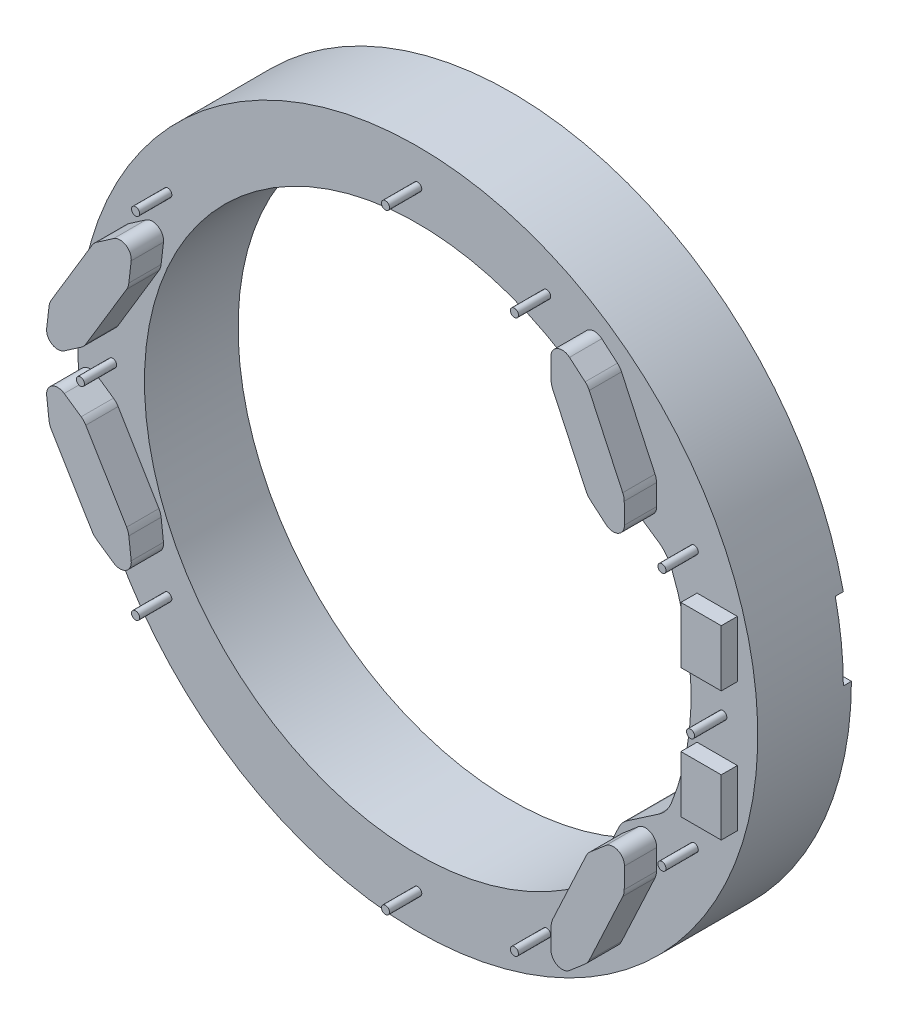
ISO-10303-21;
HEADER;
FILE_DESCRIPTION(('STEP AP214'),'2;1');
FILE_NAME('part.step','',(''),(''),'','','');
FILE_SCHEMA(('AUTOMOTIVE_DESIGN { 1 0 10303 214 1 1 1 1 }'));
ENDSEC;
DATA;
#1=APPLICATION_CONTEXT('core data for automotive mechanical design processes');
#2=APPLICATION_PROTOCOL_DEFINITION('international standard','automotive_design',2000,#1);
#3=PRODUCT_CONTEXT('',#1,'mechanical');
#4=PRODUCT('Part','Part','',(#3));
#5=PRODUCT_RELATED_PRODUCT_CATEGORY('part','',(#4));
#6=PRODUCT_DEFINITION_FORMATION('','',#4);
#7=PRODUCT_DEFINITION_CONTEXT('part definition',#1,'design');
#8=PRODUCT_DEFINITION('design','',#6,#7);
#9=PRODUCT_DEFINITION_SHAPE('','',#8);
#10=(LENGTH_UNIT() NAMED_UNIT(*) SI_UNIT(.MILLI.,.METRE.));
#11=(NAMED_UNIT(*) PLANE_ANGLE_UNIT() SI_UNIT($,.RADIAN.));
#12=(NAMED_UNIT(*) SI_UNIT($,.STERADIAN.) SOLID_ANGLE_UNIT());
#13=UNCERTAINTY_MEASURE_WITH_UNIT(LENGTH_MEASURE(1.E-05),#10,'distance_accuracy_value','');
#14=(GEOMETRIC_REPRESENTATION_CONTEXT(3) GLOBAL_UNCERTAINTY_ASSIGNED_CONTEXT((#13)) GLOBAL_UNIT_ASSIGNED_CONTEXT((#10,
#11,#12)) REPRESENTATION_CONTEXT('',''));
#15=CARTESIAN_POINT('',(0.,0.,0.));
#16=DIRECTION('',(0.,0.,1.));
#17=DIRECTION('',(1.,0.,0.));
#18=AXIS2_PLACEMENT_3D('',#15,#16,#17);
#19=CARTESIAN_POINT('',(0.,0.,14.732));
#20=DIRECTION('',(0.,0.,1.));
#21=DIRECTION('',(1.,0.,0.));
#22=AXIS2_PLACEMENT_3D('',#19,#20,#21);
#23=PLANE('',#22);
#24=CARTESIAN_POINT('',(-39.3192981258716,-27.5316689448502,14.732));
#25=DIRECTION('',(0.,0.,1.));
#26=DIRECTION('',(1.,0.,0.));
#27=AXIS2_PLACEMENT_3D('',#24,#25,#26);
#28=CIRCLE('',#27,0.634999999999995);
#29=CARTESIAN_POINT('',(-38.6842981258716,-27.5316689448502,14.732));
#30=VERTEX_POINT('',#29);
#31=EDGE_CURVE('E884',#30,#30,#28,.T.);
#32=ORIENTED_EDGE('',*,*,#31,.F.);
#33=EDGE_LOOP('',(#32));
#34=FACE_BOUND('',#33,.T.);
#35=CARTESIAN_POINT('',(0.,-48.,14.732));
#36=DIRECTION('',(0.,0.,1.));
#37=DIRECTION('',(1.,0.,0.));
#38=AXIS2_PLACEMENT_3D('',#35,#36,#37);
#39=CIRCLE('',#38,0.635000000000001);
#40=CARTESIAN_POINT('',(0.634999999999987,-48.,14.732));
#41=VERTEX_POINT('',#40);
#42=EDGE_CURVE('E888',#41,#41,#39,.T.);
#43=ORIENTED_EDGE('',*,*,#42,.F.);
#44=EDGE_LOOP('',(#43));
#45=FACE_BOUND('',#44,.T.);
#46=CARTESIAN_POINT('',(20.2856765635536,-43.5027737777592,14.732));
#47=DIRECTION('',(0.,0.,1.));
#48=DIRECTION('',(1.,0.,0.));
#49=AXIS2_PLACEMENT_3D('',#46,#47,#48);
#50=CIRCLE('',#49,0.634999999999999);
#51=CARTESIAN_POINT('',(20.9206765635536,-43.5027737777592,14.732));
#52=VERTEX_POINT('',#51);
#53=EDGE_CURVE('E894',#52,#52,#50,.T.);
#54=ORIENTED_EDGE('',*,*,#53,.F.);
#55=EDGE_LOOP('',(#54));
#56=FACE_BOUND('',#55,.T.);
#57=CARTESIAN_POINT('',(43.5027737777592,-20.2856765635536,14.732));
#58=DIRECTION('',(0.,0.,1.));
#59=DIRECTION('',(1.,0.,0.));
#60=AXIS2_PLACEMENT_3D('',#57,#58,#59);
#61=CIRCLE('',#60,0.634999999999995);
#62=CARTESIAN_POINT('',(44.1377737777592,-20.2856765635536,14.732));
#63=VERTEX_POINT('',#62);
#64=EDGE_CURVE('E900',#63,#63,#61,.T.);
#65=ORIENTED_EDGE('',*,*,#64,.F.);
#66=EDGE_LOOP('',(#65));
#67=FACE_BOUND('',#66,.T.);
#68=CARTESIAN_POINT('',(-48.,0.,14.732));
#69=DIRECTION('',(0.,0.,1.));
#70=DIRECTION('',(1.,0.,0.));
#71=AXIS2_PLACEMENT_3D('',#68,#69,#70);
#72=CIRCLE('',#71,0.634999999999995);
#73=CARTESIAN_POINT('',(-47.365,0.,14.732));
#74=VERTEX_POINT('',#73);
#75=EDGE_CURVE('E906',#74,#74,#72,.T.);
#76=ORIENTED_EDGE('',*,*,#75,.F.);
#77=EDGE_LOOP('',(#76));
#78=FACE_BOUND('',#77,.T.);
#79=CARTESIAN_POINT('',(-39.3192981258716,27.5316689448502,14.732));
#80=DIRECTION('',(0.,0.,1.));
#81=DIRECTION('',(1.,0.,0.));
#82=AXIS2_PLACEMENT_3D('',#79,#80,#81);
#83=CIRCLE('',#82,0.634999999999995);
#84=CARTESIAN_POINT('',(-38.6842981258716,27.5316689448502,14.732));
#85=VERTEX_POINT('',#84);
#86=EDGE_CURVE('E912',#85,#85,#83,.T.);
#87=ORIENTED_EDGE('',*,*,#86,.F.);
#88=EDGE_LOOP('',(#87));
#89=FACE_BOUND('',#88,.T.);
#90=CARTESIAN_POINT('',(0.,48.,14.732));
#91=DIRECTION('',(0.,0.,1.));
#92=DIRECTION('',(1.,0.,0.));
#93=AXIS2_PLACEMENT_3D('',#90,#91,#92);
#94=CIRCLE('',#93,0.635000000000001);
#95=CARTESIAN_POINT('',(0.635000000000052,48.,14.732));
#96=VERTEX_POINT('',#95);
#97=EDGE_CURVE('E918',#96,#96,#94,.T.);
#98=ORIENTED_EDGE('',*,*,#97,.F.);
#99=EDGE_LOOP('',(#98));
#100=FACE_BOUND('',#99,.T.);
#101=CARTESIAN_POINT('',(20.2856765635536,43.5027737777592,14.732));
#102=DIRECTION('',(0.,0.,1.));
#103=DIRECTION('',(1.,0.,0.));
#104=AXIS2_PLACEMENT_3D('',#101,#102,#103);
#105=CIRCLE('',#104,0.634999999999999);
#106=CARTESIAN_POINT('',(20.9206765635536,43.5027737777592,14.732));
#107=VERTEX_POINT('',#106);
#108=EDGE_CURVE('E924',#107,#107,#105,.T.);
#109=ORIENTED_EDGE('',*,*,#108,.F.);
#110=EDGE_LOOP('',(#109));
#111=FACE_BOUND('',#110,.T.);
#112=CARTESIAN_POINT('',(43.5027737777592,20.2856765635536,14.732));
#113=DIRECTION('',(0.,0.,1.));
#114=DIRECTION('',(1.,0.,0.));
#115=AXIS2_PLACEMENT_3D('',#112,#113,#114);
#116=CIRCLE('',#115,0.634999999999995);
#117=CARTESIAN_POINT('',(44.1377737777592,20.2856765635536,14.732));
#118=VERTEX_POINT('',#117);
#119=EDGE_CURVE('E930',#118,#118,#116,.T.);
#120=ORIENTED_EDGE('',*,*,#119,.F.);
#121=EDGE_LOOP('',(#120));
#122=FACE_BOUND('',#121,.T.);
#123=CARTESIAN_POINT('',(48.,0.,14.732));
#124=DIRECTION('',(0.,0.,1.));
#125=DIRECTION('',(1.,0.,0.));
#126=AXIS2_PLACEMENT_3D('',#123,#124,#125);
#127=CIRCLE('',#126,0.634999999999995);
#128=CARTESIAN_POINT('',(48.635,0.,14.732));
#129=VERTEX_POINT('',#128);
#130=EDGE_CURVE('E936',#129,#129,#127,.T.);
#131=ORIENTED_EDGE('',*,*,#130,.F.);
#132=EDGE_LOOP('',(#131));
#133=FACE_BOUND('',#132,.T.);
#134=CARTESIAN_POINT('',(0.,0.,14.732));
#135=DIRECTION('',(0.,0.,1.));
#136=DIRECTION('',(1.,0.,0.));
#137=AXIS2_PLACEMENT_3D('',#134,#135,#136);
#138=CIRCLE('',#137,43.);
#139=CARTESIAN_POINT('',(39.8909825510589,-16.0533333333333,14.732));
#140=VERTEX_POINT('',#139);
#141=CARTESIAN_POINT('',(39.8909825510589,16.0533333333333,14.732));
#142=VERTEX_POINT('',#141);
#143=EDGE_CURVE('E2116',#140,#142,#138,.T.);
#144=ORIENTED_EDGE('',*,*,#143,.F.);
#145=CARTESIAN_POINT('',(34.7886475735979,-14.0000000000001,14.732));
#146=DIRECTION('',(0.,0.,1.));
#147=DIRECTION('',(1.,0.,0.));
#148=AXIS2_PLACEMENT_3D('',#145,#146,#147);
#149=CIRCLE('',#148,5.49999999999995);
#150=CARTESIAN_POINT('',(37.8926708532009,-18.5403787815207,14.732));
#151=VERTEX_POINT('',#150);
#152=EDGE_CURVE('E560',#151,#140,#149,.T.);
#153=ORIENTED_EDGE('',*,*,#152,.F.);
#154=DIRECTION('',(0.825523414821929,0.564367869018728,0.));
#155=VECTOR('',#154,1.);
#156=CARTESIAN_POINT('',(32.9117714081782,-21.9455633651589,14.732));
#157=LINE('',#156,#155);
#158=CARTESIAN_POINT('',(32.9117714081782,-21.9455633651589,14.732));
#159=VERTEX_POINT('',#158);
#160=EDGE_CURVE('E565',#159,#151,#157,.T.);
#161=ORIENTED_EDGE('',*,*,#160,.F.);
#162=CARTESIAN_POINT('',(34.9999325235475,-25.0000000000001,14.732));
#163=DIRECTION('',(0.,0.,-1.));
#164=DIRECTION('',(1.,0.,0.));
#165=AXIS2_PLACEMENT_3D('',#162,#163,#164);
#166=CIRCLE('',#165,3.70000000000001);
#167=CARTESIAN_POINT('',(31.6465937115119,-23.4363124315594,14.732));
#168=VERTEX_POINT('',#167);
#169=EDGE_CURVE('E2097',#168,#159,#166,.T.);
#170=ORIENTED_EDGE('',*,*,#169,.F.);
#171=DIRECTION('',(0.422618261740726,0.906307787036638,0.));
#172=VECTOR('',#171,1.);
#173=CARTESIAN_POINT('',(27.5113371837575,-32.3043986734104,14.732));
#174=LINE('',#173,#172);
#175=CARTESIAN_POINT('',(27.5113371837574,-32.3043986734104,14.732));
#176=VERTEX_POINT('',#175);
#177=EDGE_CURVE('E2098',#176,#168,#174,.T.);
#178=ORIENTED_EDGE('',*,*,#177,.F.);
#179=CARTESIAN_POINT('',(22.526644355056,-29.9799982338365,14.732));
#180=DIRECTION('',(0.,0.,1.));
#181=DIRECTION('',(1.,0.,0.));
#182=AXIS2_PLACEMENT_3D('',#179,#180,#181);
#183=CIRCLE('',#182,5.49999999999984);
#184=CARTESIAN_POINT('',(25.8305521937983,-34.3770646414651,14.732));
#185=VERTEX_POINT('',#184);
#186=EDGE_CURVE('E2102',#185,#176,#183,.T.);
#187=ORIENTED_EDGE('',*,*,#186,.F.);
#188=CARTESIAN_POINT('',(0.,0.,14.732));
#189=DIRECTION('',(0.,0.,1.));
#190=DIRECTION('',(1.,0.,0.));
#191=AXIS2_PLACEMENT_3D('',#188,#189,#190);
#192=CIRCLE('',#191,43.);
#193=CARTESIAN_POINT('',(25.8305521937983,34.3770646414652,14.732));
#194=VERTEX_POINT('',#193);
#195=EDGE_CURVE('E2104',#194,#185,#192,.T.);
#196=ORIENTED_EDGE('',*,*,#195,.F.);
#197=CARTESIAN_POINT('',(22.526644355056,29.9799982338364,14.732));
#198=DIRECTION('',(0.,0.,1.));
#199=DIRECTION('',(1.,0.,0.));
#200=AXIS2_PLACEMENT_3D('',#197,#198,#199);
#201=CIRCLE('',#200,5.49999999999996);
#202=CARTESIAN_POINT('',(27.5113371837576,32.3043986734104,14.732));
#203=VERTEX_POINT('',#202);
#204=EDGE_CURVE('E2106',#203,#194,#201,.T.);
#205=ORIENTED_EDGE('',*,*,#204,.F.);
#206=DIRECTION('',(-0.422618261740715,0.906307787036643,0.));
#207=VECTOR('',#206,1.);
#208=CARTESIAN_POINT('',(31.6465937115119,23.4363124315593,14.732));
#209=LINE('',#208,#207);
#210=CARTESIAN_POINT('',(31.6465937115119,23.4363124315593,14.732));
#211=VERTEX_POINT('',#210);
#212=EDGE_CURVE('E2108',#211,#203,#209,.T.);
#213=ORIENTED_EDGE('',*,*,#212,.F.);
#214=CARTESIAN_POINT('',(34.9999325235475,25.,14.732));
#215=DIRECTION('',(0.,0.,-1.));
#216=DIRECTION('',(1.,0.,0.));
#217=AXIS2_PLACEMENT_3D('',#214,#215,#216);
#218=CIRCLE('',#217,3.70000000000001);
#219=CARTESIAN_POINT('',(32.9117714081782,21.9455633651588,14.732));
#220=VERTEX_POINT('',#219);
#221=EDGE_CURVE('E2110',#220,#211,#218,.T.);
#222=ORIENTED_EDGE('',*,*,#221,.F.);
#223=DIRECTION('',(-0.825523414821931,0.564367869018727,0.));
#224=VECTOR('',#223,1.);
#225=CARTESIAN_POINT('',(37.8926708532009,18.5403787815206,14.732));
#226=LINE('',#225,#224);
#227=CARTESIAN_POINT('',(37.8926708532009,18.5403787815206,14.732));
#228=VERTEX_POINT('',#227);
#229=EDGE_CURVE('E2112',#228,#220,#226,.T.);
#230=ORIENTED_EDGE('',*,*,#229,.F.);
#231=CARTESIAN_POINT('',(34.7886475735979,14.,14.732));
#232=DIRECTION('',(0.,0.,1.));
#233=DIRECTION('',(1.,0.,0.));
#234=AXIS2_PLACEMENT_3D('',#231,#232,#233);
#235=CIRCLE('',#234,5.49999999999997);
#236=EDGE_CURVE('E2114',#142,#228,#235,.T.);
#237=ORIENTED_EDGE('',*,*,#236,.F.);
#238=EDGE_LOOP('',(#144,#153,#161,#170,#178,#187,#196,#205,#213,#222,#230,#237));
#239=FACE_BOUND('',#238,.T.);
#240=DIRECTION('',(-0.759147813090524,0.650918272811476,0.));
#241=VECTOR('',#240,1.);
#242=CARTESIAN_POINT('',(28.9564310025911,41.7726906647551,14.732));
#243=LINE('',#242,#241);
#244=CARTESIAN_POINT('',(31.4147172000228,39.6648753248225,14.732));
#245=VERTEX_POINT('',#244);
#246=CARTESIAN_POINT('',(28.9564310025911,41.7726906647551,14.732));
#247=VERTEX_POINT('',#246);
#248=EDGE_CURVE('E2174',#245,#247,#243,.T.);
#249=ORIENTED_EDGE('',*,*,#248,.F.);
#250=CARTESIAN_POINT('',(29.7613847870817,37.7366398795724,14.732));
#251=DIRECTION('',(0.,0.,1.));
#252=DIRECTION('',(-1.,0.,0.));
#253=AXIS2_PLACEMENT_3D('',#250,#251,#252);
#254=CIRCLE('',#253,2.54);
#255=CARTESIAN_POINT('',(32.0634065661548,38.8100902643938,14.732));
#256=VERTEX_POINT('',#255);
#257=EDGE_CURVE('E2176',#256,#245,#254,.T.);
#258=ORIENTED_EDGE('',*,*,#257,.F.);
#259=DIRECTION('',(-0.422618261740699,0.90630778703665,0.));
#260=VECTOR('',#259,1.);
#261=CARTESIAN_POINT('',(32.0634065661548,38.8100902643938,14.732));
#262=LINE('',#261,#260);
#263=CARTESIAN_POINT('',(37.3312581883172,27.5131460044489,14.732));
#264=VERTEX_POINT('',#263);
#265=EDGE_CURVE('E2153',#264,#256,#262,.T.);
#266=ORIENTED_EDGE('',*,*,#265,.F.);
#267=CARTESIAN_POINT('',(35.0292364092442,26.4396956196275,14.732));
#268=DIRECTION('',(0.,0.,1.));
#269=DIRECTION('',(-1.,0.,0.));
#270=AXIS2_PLACEMENT_3D('',#267,#268,#269);
#271=CIRCLE('',#270,2.53999999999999);
#272=CARTESIAN_POINT('',(37.5690920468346,26.4667758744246,14.732));
#273=VERTEX_POINT('',#272);
#274=EDGE_CURVE('E2155',#273,#264,#271,.T.);
#275=ORIENTED_EDGE('',*,*,#274,.F.);
#276=DIRECTION('',(-0.0106615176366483,0.999943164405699,0.));
#277=VECTOR('',#276,1.);
#278=CARTESIAN_POINT('',(37.5690920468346,26.4667758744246,14.732));
#279=LINE('',#278,#277);
#280=CARTESIAN_POINT('',(37.6036163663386,23.2287418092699,14.732));
#281=VERTEX_POINT('',#280);
#282=EDGE_CURVE('E2158',#281,#273,#279,.T.);
#283=ORIENTED_EDGE('',*,*,#282,.F.);
#284=CARTESIAN_POINT('',(35.8346786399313,23.2098811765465,14.732));
#285=DIRECTION('',(0.,0.,1.));
#286=DIRECTION('',(1.,0.,0.));
#287=AXIS2_PLACEMENT_3D('',#284,#285,#286);
#288=CIRCLE('',#287,1.76903827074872);
#289=CARTESIAN_POINT('',(34.6831793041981,21.8669196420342,14.732));
#290=VERTEX_POINT('',#289);
#291=EDGE_CURVE('E2160',#290,#281,#288,.T.);
#292=ORIENTED_EDGE('',*,*,#291,.F.);
#293=DIRECTION('',(0.759147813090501,-0.650918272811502,0.));
#294=VECTOR('',#293,1.);
#295=CARTESIAN_POINT('',(32.2248931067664,23.974734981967,14.732));
#296=LINE('',#295,#294);
#297=CARTESIAN_POINT('',(32.2248931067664,23.974734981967,14.732));
#298=VERTEX_POINT('',#297);
#299=EDGE_CURVE('E2162',#298,#290,#296,.T.);
#300=ORIENTED_EDGE('',*,*,#299,.F.);
#301=CARTESIAN_POINT('',(33.8782255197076,25.9029704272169,14.732));
#302=DIRECTION('',(0.,0.,1.));
#303=DIRECTION('',(1.,0.,0.));
#304=AXIS2_PLACEMENT_3D('',#301,#302,#303);
#305=CIRCLE('',#304,2.54);
#306=CARTESIAN_POINT('',(31.5762037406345,24.8295200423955,14.732));
#307=VERTEX_POINT('',#306);
#308=EDGE_CURVE('E2164',#307,#298,#305,.T.);
#309=ORIENTED_EDGE('',*,*,#308,.F.);
#310=DIRECTION('',(0.422618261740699,-0.90630778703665,0.));
#311=VECTOR('',#310,1.);
#312=CARTESIAN_POINT('',(26.3083521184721,36.1264643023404,14.732));
#313=LINE('',#312,#311);
#314=CARTESIAN_POINT('',(26.3083521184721,36.1264643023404,14.732));
#315=VERTEX_POINT('',#314);
#316=EDGE_CURVE('E2166',#315,#307,#313,.T.);
#317=ORIENTED_EDGE('',*,*,#316,.F.);
#318=CARTESIAN_POINT('',(28.6103738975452,37.1999146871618,14.732));
#319=DIRECTION('',(0.,0.,1.));
#320=DIRECTION('',(1.,0.,0.));
#321=AXIS2_PLACEMENT_3D('',#318,#319,#320);
#322=CIRCLE('',#321,2.54);
#323=CARTESIAN_POINT('',(26.0705182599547,37.1728344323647,14.732));
#324=VERTEX_POINT('',#323);
#325=EDGE_CURVE('E2168',#324,#315,#322,.T.);
#326=ORIENTED_EDGE('',*,*,#325,.F.);
#327=DIRECTION('',(0.0106615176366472,-0.999943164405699,0.));
#328=VECTOR('',#327,1.);
#329=CARTESIAN_POINT('',(26.0359939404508,40.4108684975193,14.732));
#330=LINE('',#329,#328);
#331=CARTESIAN_POINT('',(26.0359939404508,40.4108684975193,14.732));
#332=VERTEX_POINT('',#331);
#333=EDGE_CURVE('E2170',#332,#324,#330,.T.);
#334=ORIENTED_EDGE('',*,*,#333,.F.);
#335=CARTESIAN_POINT('',(27.804931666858,40.4297291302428,14.732));
#336=DIRECTION('',(0.,0.,1.));
#337=DIRECTION('',(1.,0.,0.));
#338=AXIS2_PLACEMENT_3D('',#335,#336,#337);
#339=CIRCLE('',#338,1.76903827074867);
#340=EDGE_CURVE('E2172',#247,#332,#339,.T.);
#341=ORIENTED_EDGE('',*,*,#340,.F.);
#342=EDGE_LOOP('',(#249,#258,#266,#275,#283,#292,#300,#309,#317,#326,#334,#341));
#343=FACE_BOUND('',#342,.T.);
#344=CARTESIAN_POINT('',(0.,0.,14.732));
#345=DIRECTION('',(0.,0.,1.));
#346=DIRECTION('',(1.,0.,0.));
#347=AXIS2_PLACEMENT_3D('',#344,#345,#346);
#348=CIRCLE('',#347,53.5);
#349=CARTESIAN_POINT('',(-52.9076455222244,-7.93920936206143,14.732));
#350=VERTEX_POINT('',#349);
#351=CARTESIAN_POINT('',(-52.9076455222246,7.93920936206,14.732));
#352=VERTEX_POINT('',#351);
#353=EDGE_CURVE('E598',#350,#352,#348,.T.);
#354=ORIENTED_EDGE('',*,*,#353,.T.);
#355=CARTESIAN_POINT('',(-50.40844164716,7.48580006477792,14.732));
#356=DIRECTION('',(0.,0.,1.));
#357=DIRECTION('',(-1.,0.,0.));
#358=AXIS2_PLACEMENT_3D('',#355,#356,#357);
#359=CIRCLE('',#358,2.53999999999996);
#360=CARTESIAN_POINT('',(-52.5856465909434,8.79399677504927,14.732));
#361=VERTEX_POINT('',#360);
#362=EDGE_CURVE('E640',#361,#352,#359,.T.);
#363=ORIENTED_EDGE('',*,*,#362,.F.);
#364=DIRECTION('',(-0.515038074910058,-0.85716730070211,0.));
#365=VECTOR('',#364,1.);
#366=CARTESIAN_POINT('',(-52.5856465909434,8.79399677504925,14.732));
#367=LINE('',#366,#365);
#368=CARTESIAN_POINT('',(-46.1658005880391,19.4784147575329,14.732));
#369=VERTEX_POINT('',#368);
#370=EDGE_CURVE('E668',#369,#361,#367,.T.);
#371=ORIENTED_EDGE('',*,*,#370,.F.);
#372=CARTESIAN_POINT('',(-43.9885956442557,18.1702180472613,14.732));
#373=DIRECTION('',(0.,0.,1.));
#374=DIRECTION('',(-1.,0.,0.));
#375=AXIS2_PLACEMENT_3D('',#372,#373,#374);
#376=CIRCLE('',#375,2.54);
#377=CARTESIAN_POINT('',(-45.4313154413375,20.2607107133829,14.732));
#378=VERTEX_POINT('',#377);
#379=EDGE_CURVE('E670',#378,#369,#376,.T.);
#380=ORIENTED_EDGE('',*,*,#379,.F.);
#381=DIRECTION('',(-0.823028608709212,-0.567999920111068,0.));
#382=VECTOR('',#381,1.);
#383=CARTESIAN_POINT('',(-45.4313154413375,20.2607107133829,14.732));
#384=LINE('',#383,#382);
#385=CARTESIAN_POINT('',(-42.7661692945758,22.1000183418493,14.732));
#386=VERTEX_POINT('',#385);
#387=EDGE_CURVE('E676',#386,#378,#384,.T.);
#388=ORIENTED_EDGE('',*,*,#387,.F.);
#389=CARTESIAN_POINT('',(-41.7613556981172,20.6440492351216,14.732));
#390=DIRECTION('',(0.,0.,1.));
#391=DIRECTION('',(1.,0.,0.));
#392=AXIS2_PLACEMENT_3D('',#389,#390,#391);
#393=CIRCLE('',#392,1.76903827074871);
#394=CARTESIAN_POINT('',(-40.0040798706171,20.4403875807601,14.732));
#395=VERTEX_POINT('',#394);
#396=EDGE_CURVE('E732',#395,#386,#393,.T.);
#397=ORIENTED_EDGE('',*,*,#396,.F.);
#398=DIRECTION('',(0.115125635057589,0.993350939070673,0.));
#399=VECTOR('',#398,1.);
#400=CARTESIAN_POINT('',(-40.0040798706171,20.4403875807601,14.732));
#401=LINE('',#400,#399);
#402=CARTESIAN_POINT('',(-40.3768817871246,17.2237005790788,14.732));
#403=VERTEX_POINT('',#402);
#404=EDGE_CURVE('E729',#403,#395,#401,.T.);
#405=ORIENTED_EDGE('',*,*,#404,.F.);
#406=CARTESIAN_POINT('',(-42.899993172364,17.5161196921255,14.732));
#407=DIRECTION('',(0.,0.,1.));
#408=DIRECTION('',(-1.,0.,0.));
#409=AXIS2_PLACEMENT_3D('',#406,#407,#408);
#410=CIRCLE('',#409,2.53999999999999);
#411=CARTESIAN_POINT('',(-40.7227882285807,16.207922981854,14.732));
#412=VERTEX_POINT('',#411);
#413=EDGE_CURVE('E726',#412,#403,#410,.T.);
#414=ORIENTED_EDGE('',*,*,#413,.F.);
#415=DIRECTION('',(0.515038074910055,0.857167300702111,0.));
#416=VECTOR('',#415,1.);
#417=CARTESIAN_POINT('',(-40.7227882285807,16.207922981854,14.732));
#418=LINE('',#417,#416);
#419=CARTESIAN_POINT('',(-47.142634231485,5.52350499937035,14.732));
#420=VERTEX_POINT('',#419);
#421=EDGE_CURVE('E723',#420,#412,#418,.T.);
#422=ORIENTED_EDGE('',*,*,#421,.F.);
#423=CARTESIAN_POINT('',(-49.3198391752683,6.83170170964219,14.732));
#424=DIRECTION('',(0.,0.,1.));
#425=DIRECTION('',(-1.,0.,0.));
#426=AXIS2_PLACEMENT_3D('',#423,#424,#425);
#427=CIRCLE('',#426,2.54000000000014);
#428=CARTESIAN_POINT('',(-47.8771193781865,4.74120904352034,14.732));
#429=VERTEX_POINT('',#428);
#430=EDGE_CURVE('E720',#429,#420,#427,.T.);
#431=ORIENTED_EDGE('',*,*,#430,.F.);
#432=DIRECTION('',(0.823028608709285,0.567999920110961,0.));
#433=VECTOR('',#432,1.);
#434=CARTESIAN_POINT('',(-47.8771193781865,4.74120904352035,14.732));
#435=LINE('',#434,#433);
#436=CARTESIAN_POINT('',(-50.542265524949,2.90190141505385,14.732));
#437=VERTEX_POINT('',#436);
#438=EDGE_CURVE('E716',#437,#429,#435,.T.);
#439=ORIENTED_EDGE('',*,*,#438,.F.);
#440=CARTESIAN_POINT('',(-51.5470791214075,4.35787052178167,14.732));
#441=DIRECTION('',(0.,0.,1.));
#442=DIRECTION('',(1.,0.,0.));
#443=AXIS2_PLACEMENT_3D('',#440,#441,#442);
#444=CIRCLE('',#443,1.7690382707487);
#445=CARTESIAN_POINT('',(-53.3098291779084,4.50689616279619,14.732));
#446=VERTEX_POINT('',#445);
#447=EDGE_CURVE('E707',#446,#437,#444,.T.);
#448=ORIENTED_EDGE('',*,*,#447,.F.);
#449=CARTESIAN_POINT('',(-53.3098291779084,-4.50689616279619,14.732));
#450=VERTEX_POINT('',#449);
#451=EDGE_CURVE('E603',#446,#450,#348,.T.);
#452=ORIENTED_EDGE('',*,*,#451,.T.);
#453=CARTESIAN_POINT('',(-51.5470791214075,-4.35787052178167,14.732));
#454=DIRECTION('',(0.,0.,1.));
#455=DIRECTION('',(-1.,0.,0.));
#456=AXIS2_PLACEMENT_3D('',#453,#454,#455);
#457=CIRCLE('',#456,1.76903827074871);
#458=CARTESIAN_POINT('',(-50.5422655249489,-2.90190141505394,14.732));
#459=VERTEX_POINT('',#458);
#460=EDGE_CURVE('E1148',#459,#450,#457,.T.);
#461=ORIENTED_EDGE('',*,*,#460,.F.);
#462=DIRECTION('',(-0.82302860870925,0.567999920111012,0.));
#463=VECTOR('',#462,1.);
#464=CARTESIAN_POINT('',(-47.8771193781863,-4.7412090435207,14.732));
#465=LINE('',#464,#463);
#466=CARTESIAN_POINT('',(-47.8771193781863,-4.7412090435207,14.732));
#467=VERTEX_POINT('',#466);
#468=EDGE_CURVE('E1125',#467,#459,#465,.T.);
#469=ORIENTED_EDGE('',*,*,#468,.F.);
#470=CARTESIAN_POINT('',(-49.3198391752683,-6.83170170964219,14.732));
#471=DIRECTION('',(0.,0.,1.));
#472=DIRECTION('',(1.,0.,0.));
#473=AXIS2_PLACEMENT_3D('',#470,#471,#472);
#474=CIRCLE('',#473,2.54);
#475=CARTESIAN_POINT('',(-47.1426342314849,-5.52350499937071,14.732));
#476=VERTEX_POINT('',#475);
#477=EDGE_CURVE('E2248',#476,#467,#474,.T.);
#478=ORIENTED_EDGE('',*,*,#477,.F.);
#479=DIRECTION('',(-0.515038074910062,0.857167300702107,0.));
#480=VECTOR('',#479,1.);
#481=CARTESIAN_POINT('',(-40.7227882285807,-16.207922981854,14.732));
#482=LINE('',#481,#480);
#483=CARTESIAN_POINT('',(-40.7227882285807,-16.207922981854,14.732));
#484=VERTEX_POINT('',#483);
#485=EDGE_CURVE('E2250',#484,#476,#482,.T.);
#486=ORIENTED_EDGE('',*,*,#485,.F.);
#487=CARTESIAN_POINT('',(-42.899993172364,-17.5161196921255,14.732));
#488=DIRECTION('',(0.,0.,1.));
#489=DIRECTION('',(1.,0.,0.));
#490=AXIS2_PLACEMENT_3D('',#487,#488,#489);
#491=CIRCLE('',#490,2.53999999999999);
#492=CARTESIAN_POINT('',(-40.3768817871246,-17.2237005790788,14.732));
#493=VERTEX_POINT('',#492);
#494=EDGE_CURVE('E2295',#493,#484,#491,.T.);
#495=ORIENTED_EDGE('',*,*,#494,.F.);
#496=DIRECTION('',(-0.115125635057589,0.993350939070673,0.));
#497=VECTOR('',#496,1.);
#498=CARTESIAN_POINT('',(-40.0040798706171,-20.4403875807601,14.732));
#499=LINE('',#498,#497);
#500=CARTESIAN_POINT('',(-40.0040798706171,-20.4403875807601,14.732));
#501=VERTEX_POINT('',#500);
#502=EDGE_CURVE('E2292',#501,#493,#499,.T.);
#503=ORIENTED_EDGE('',*,*,#502,.F.);
#504=CARTESIAN_POINT('',(-41.7613556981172,-20.6440492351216,14.732));
#505=DIRECTION('',(0.,0.,1.));
#506=DIRECTION('',(-1.,0.,0.));
#507=AXIS2_PLACEMENT_3D('',#504,#505,#506);
#508=CIRCLE('',#507,1.76903827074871);
#509=CARTESIAN_POINT('',(-42.7661692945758,-22.1000183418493,14.732));
#510=VERTEX_POINT('',#509);
#511=EDGE_CURVE('E2287',#510,#501,#508,.T.);
#512=ORIENTED_EDGE('',*,*,#511,.F.);
#513=DIRECTION('',(0.823028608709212,-0.567999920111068,0.));
#514=VECTOR('',#513,1.);
#515=CARTESIAN_POINT('',(-45.4313154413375,-20.2607107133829,14.732));
#516=LINE('',#515,#514);
#517=CARTESIAN_POINT('',(-45.4313154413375,-20.2607107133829,14.732));
#518=VERTEX_POINT('',#517);
#519=EDGE_CURVE('E2284',#518,#510,#516,.T.);
#520=ORIENTED_EDGE('',*,*,#519,.F.);
#521=CARTESIAN_POINT('',(-43.9885956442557,-18.1702180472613,14.732));
#522=DIRECTION('',(0.,0.,1.));
#523=DIRECTION('',(1.,0.,0.));
#524=AXIS2_PLACEMENT_3D('',#521,#522,#523);
#525=CIRCLE('',#524,2.54);
#526=CARTESIAN_POINT('',(-46.1658005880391,-19.4784147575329,14.732));
#527=VERTEX_POINT('',#526);
#528=EDGE_CURVE('E2283',#527,#518,#525,.T.);
#529=ORIENTED_EDGE('',*,*,#528,.F.);
#530=DIRECTION('',(0.515038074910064,-0.857167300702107,0.));
#531=VECTOR('',#530,1.);
#532=CARTESIAN_POINT('',(-52.5856465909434,-8.79399677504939,14.732));
#533=LINE('',#532,#531);
#534=CARTESIAN_POINT('',(-52.5856465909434,-8.7939967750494,14.732));
#535=VERTEX_POINT('',#534);
#536=EDGE_CURVE('E1153',#535,#527,#533,.T.);
#537=ORIENTED_EDGE('',*,*,#536,.F.);
#538=CARTESIAN_POINT('',(-50.40844164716,-7.48580006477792,14.732));
#539=DIRECTION('',(0.,0.,1.));
#540=DIRECTION('',(1.,0.,0.));
#541=AXIS2_PLACEMENT_3D('',#538,#539,#540);
#542=CIRCLE('',#541,2.54);
#543=EDGE_CURVE('E1156',#350,#535,#542,.T.);
#544=ORIENTED_EDGE('',*,*,#543,.F.);
#545=EDGE_LOOP('',(#354,#363,#371,#380,#388,#397,#405,#414,#422,#431,#439,#448,#452,#461,#469,
#478,#486,#495,#503,#512,#520,#529,#537,#544));
#546=FACE_BOUND('',#545,.T.);
#547=DIRECTION('',(-0.759147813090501,-0.650918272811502,0.));
#548=VECTOR('',#547,1.);
#549=CARTESIAN_POINT('',(32.2248931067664,-23.974734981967,14.732));
#550=LINE('',#549,#548);
#551=CARTESIAN_POINT('',(34.6831793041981,-21.8669196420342,14.732));
#552=VERTEX_POINT('',#551);
#553=CARTESIAN_POINT('',(32.2248931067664,-23.974734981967,14.732));
#554=VERTEX_POINT('',#553);
#555=EDGE_CURVE('E974',#552,#554,#550,.T.);
#556=ORIENTED_EDGE('',*,*,#555,.F.);
#557=CARTESIAN_POINT('',(35.8346786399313,-23.2098811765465,14.732));
#558=DIRECTION('',(0.,0.,1.));
#559=DIRECTION('',(-1.,0.,0.));
#560=AXIS2_PLACEMENT_3D('',#557,#558,#559);
#561=CIRCLE('',#560,1.76903827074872);
#562=CARTESIAN_POINT('',(37.6036163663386,-23.2287418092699,14.732));
#563=VERTEX_POINT('',#562);
#564=EDGE_CURVE('E942',#563,#552,#561,.T.);
#565=ORIENTED_EDGE('',*,*,#564,.F.);
#566=DIRECTION('',(0.0106615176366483,0.999943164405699,0.));
#567=VECTOR('',#566,1.);
#568=CARTESIAN_POINT('',(37.5690920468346,-26.4667758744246,14.732));
#569=LINE('',#568,#567);
#570=CARTESIAN_POINT('',(37.5690920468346,-26.4667758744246,14.732));
#571=VERTEX_POINT('',#570);
#572=EDGE_CURVE('E949',#571,#563,#569,.T.);
#573=ORIENTED_EDGE('',*,*,#572,.F.);
#574=CARTESIAN_POINT('',(35.0292364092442,-26.4396956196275,14.732));
#575=DIRECTION('',(0.,0.,1.));
#576=DIRECTION('',(1.,0.,0.));
#577=AXIS2_PLACEMENT_3D('',#574,#575,#576);
#578=CIRCLE('',#577,2.53999999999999);
#579=CARTESIAN_POINT('',(37.3312581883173,-27.5131460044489,14.732));
#580=VERTEX_POINT('',#579);
#581=EDGE_CURVE('E992',#580,#571,#578,.T.);
#582=ORIENTED_EDGE('',*,*,#581,.F.);
#583=DIRECTION('',(0.422618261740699,0.90630778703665,0.));
#584=VECTOR('',#583,1.);
#585=CARTESIAN_POINT('',(32.0634065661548,-38.8100902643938,14.732));
#586=LINE('',#585,#584);
#587=CARTESIAN_POINT('',(32.0634065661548,-38.8100902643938,14.732));
#588=VERTEX_POINT('',#587);
#589=EDGE_CURVE('E990',#588,#580,#586,.T.);
#590=ORIENTED_EDGE('',*,*,#589,.F.);
#591=CARTESIAN_POINT('',(29.7613847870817,-37.7366398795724,14.732));
#592=DIRECTION('',(0.,0.,1.));
#593=DIRECTION('',(1.,0.,0.));
#594=AXIS2_PLACEMENT_3D('',#591,#592,#593);
#595=CIRCLE('',#594,2.53999999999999);
#596=CARTESIAN_POINT('',(31.4147172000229,-39.6648753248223,14.732));
#597=VERTEX_POINT('',#596);
#598=EDGE_CURVE('E988',#597,#588,#595,.T.);
#599=ORIENTED_EDGE('',*,*,#598,.F.);
#600=DIRECTION('',(0.759147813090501,0.650918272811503,0.));
#601=VECTOR('',#600,1.);
#602=CARTESIAN_POINT('',(28.9564310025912,-41.7726906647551,14.732));
#603=LINE('',#602,#601);
#604=CARTESIAN_POINT('',(28.9564310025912,-41.7726906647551,14.732));
#605=VERTEX_POINT('',#604);
#606=EDGE_CURVE('E986',#605,#597,#603,.T.);
#607=ORIENTED_EDGE('',*,*,#606,.F.);
#608=CARTESIAN_POINT('',(27.804931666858,-40.4297291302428,14.732));
#609=DIRECTION('',(0.,0.,1.));
#610=DIRECTION('',(-1.,0.,0.));
#611=AXIS2_PLACEMENT_3D('',#608,#609,#610);
#612=CIRCLE('',#611,1.76903827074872);
#613=CARTESIAN_POINT('',(26.0359939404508,-40.4108684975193,14.732));
#614=VERTEX_POINT('',#613);
#615=EDGE_CURVE('E984',#614,#605,#612,.T.);
#616=ORIENTED_EDGE('',*,*,#615,.F.);
#617=DIRECTION('',(-0.0106615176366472,-0.999943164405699,0.));
#618=VECTOR('',#617,1.);
#619=CARTESIAN_POINT('',(26.0359939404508,-40.4108684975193,14.732));
#620=LINE('',#619,#618);
#621=CARTESIAN_POINT('',(26.0705182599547,-37.1728344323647,14.732));
#622=VERTEX_POINT('',#621);
#623=EDGE_CURVE('E982',#622,#614,#620,.T.);
#624=ORIENTED_EDGE('',*,*,#623,.F.);
#625=CARTESIAN_POINT('',(28.6103738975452,-37.1999146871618,14.732));
#626=DIRECTION('',(0.,0.,1.));
#627=DIRECTION('',(-1.,0.,0.));
#628=AXIS2_PLACEMENT_3D('',#625,#626,#627);
#629=CIRCLE('',#628,2.54);
#630=CARTESIAN_POINT('',(26.3083521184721,-36.1264643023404,14.732));
#631=VERTEX_POINT('',#630);
#632=EDGE_CURVE('E980',#631,#622,#629,.T.);
#633=ORIENTED_EDGE('',*,*,#632,.F.);
#634=DIRECTION('',(-0.422618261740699,-0.90630778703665,0.));
#635=VECTOR('',#634,1.);
#636=CARTESIAN_POINT('',(26.3083521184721,-36.1264643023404,14.732));
#637=LINE('',#636,#635);
#638=CARTESIAN_POINT('',(31.5762037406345,-24.8295200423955,14.732));
#639=VERTEX_POINT('',#638);
#640=EDGE_CURVE('E978',#639,#631,#637,.T.);
#641=ORIENTED_EDGE('',*,*,#640,.F.);
#642=CARTESIAN_POINT('',(33.8782255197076,-25.9029704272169,14.732));
#643=DIRECTION('',(0.,0.,1.));
#644=DIRECTION('',(-1.,0.,0.));
#645=AXIS2_PLACEMENT_3D('',#642,#643,#644);
#646=CIRCLE('',#645,2.54);
#647=EDGE_CURVE('E976',#554,#639,#646,.T.);
#648=ORIENTED_EDGE('',*,*,#647,.F.);
#649=EDGE_LOOP('',(#556,#565,#573,#582,#590,#599,#607,#616,#624,#633,#641,#648));
#650=FACE_BOUND('',#649,.T.);
#651=DIRECTION('',(-1.,0.,0.));
#652=VECTOR('',#651,1.);
#653=CARTESIAN_POINT('',(50.292,-5.715,14.732));
#654=LINE('',#653,#652);
#655=CARTESIAN_POINT('',(50.292,-5.715,14.732));
#656=VERTEX_POINT('',#655);
#657=CARTESIAN_POINT('',(43.942,-5.715,14.732));
#658=VERTEX_POINT('',#657);
#659=EDGE_CURVE('E869',#656,#658,#654,.T.);
#660=ORIENTED_EDGE('',*,*,#659,.F.);
#661=DIRECTION('',(0.,1.,0.));
#662=VECTOR('',#661,1.);
#663=CARTESIAN_POINT('',(50.292,-14.605,14.732));
#664=LINE('',#663,#662);
#665=CARTESIAN_POINT('',(50.292,-14.605,14.732));
#666=VERTEX_POINT('',#665);
#667=EDGE_CURVE('E855',#666,#656,#664,.T.);
#668=ORIENTED_EDGE('',*,*,#667,.F.);
#669=DIRECTION('',(1.,0.,0.));
#670=VECTOR('',#669,1.);
#671=CARTESIAN_POINT('',(50.292,-14.605,14.732));
#672=LINE('',#671,#670);
#673=CARTESIAN_POINT('',(43.942,-14.605,14.732));
#674=VERTEX_POINT('',#673);
#675=EDGE_CURVE('E860',#674,#666,#672,.T.);
#676=ORIENTED_EDGE('',*,*,#675,.F.);
#677=DIRECTION('',(0.,-1.,0.));
#678=VECTOR('',#677,1.);
#679=CARTESIAN_POINT('',(43.942,-14.605,14.732));
#680=LINE('',#679,#678);
#681=EDGE_CURVE('E871',#658,#674,#680,.T.);
#682=ORIENTED_EDGE('',*,*,#681,.F.);
#683=EDGE_LOOP('',(#660,#668,#676,#682));
#684=FACE_BOUND('',#683,.T.);
#685=DIRECTION('',(-1.,0.,0.));
#686=VECTOR('',#685,1.);
#687=CARTESIAN_POINT('',(50.292,14.605,14.732));
#688=LINE('',#687,#686);
#689=CARTESIAN_POINT('',(50.292,14.605,14.732));
#690=VERTEX_POINT('',#689);
#691=CARTESIAN_POINT('',(43.942,14.605,14.732));
#692=VERTEX_POINT('',#691);
#693=EDGE_CURVE('E842',#690,#692,#688,.T.);
#694=ORIENTED_EDGE('',*,*,#693,.F.);
#695=DIRECTION('',(0.,1.,0.));
#696=VECTOR('',#695,1.);
#697=CARTESIAN_POINT('',(50.292,5.715,14.732));
#698=LINE('',#697,#696);
#699=CARTESIAN_POINT('',(50.292,5.715,14.732));
#700=VERTEX_POINT('',#699);
#701=EDGE_CURVE('E824',#700,#690,#698,.T.);
#702=ORIENTED_EDGE('',*,*,#701,.F.);
#703=DIRECTION('',(1.,0.,0.));
#704=VECTOR('',#703,1.);
#705=CARTESIAN_POINT('',(50.292,5.715,14.732));
#706=LINE('',#705,#704);
#707=CARTESIAN_POINT('',(43.942,5.715,14.732));
#708=VERTEX_POINT('',#707);
#709=EDGE_CURVE('E833',#708,#700,#706,.T.);
#710=ORIENTED_EDGE('',*,*,#709,.F.);
#711=DIRECTION('',(0.,-1.,0.));
#712=VECTOR('',#711,1.);
#713=CARTESIAN_POINT('',(43.942,5.715,14.732));
#714=LINE('',#713,#712);
#715=EDGE_CURVE('E844',#692,#708,#714,.T.);
#716=ORIENTED_EDGE('',*,*,#715,.F.);
#717=EDGE_LOOP('',(#694,#702,#710,#716));
#718=FACE_BOUND('',#717,.T.);
#719=ADVANCED_FACE('F34',(#34,#45,#56,#67,#78,#89,#100,#111,#122,#133,#239,#343,#546,#650,#684,
#718),#23,.T.);
#720=CARTESIAN_POINT('',(-52.9315530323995,7.77821917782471,14.732));
#721=VERTEX_POINT('',#720);
#722=EDGE_CURVE('E600',#721,#446,#348,.T.);
#723=ORIENTED_EDGE('',*,*,#722,.T.);
#724=CARTESIAN_POINT('',(-53.3043549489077,4.56153217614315,14.732));
#725=VERTEX_POINT('',#724);
#726=EDGE_CURVE('E710',#725,#446,#444,.T.);
#727=ORIENTED_EDGE('',*,*,#726,.F.);
#728=DIRECTION('',(-0.115125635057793,-0.993350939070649,0.));
#729=VECTOR('',#728,1.);
#730=CARTESIAN_POINT('',(-53.3043549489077,4.56153217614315,14.732));
#731=LINE('',#730,#729);
#732=EDGE_CURVE('E648',#721,#725,#731,.T.);
#733=ORIENTED_EDGE('',*,*,#732,.F.);
#734=EDGE_LOOP('',(#723,#727,#733));
#735=FACE_BOUND('',#734,.T.);
#736=ADVANCED_FACE('F797',(#735),#23,.T.);
#737=CARTESIAN_POINT('',(-52.9315530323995,-7.77821917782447,14.732));
#738=VERTEX_POINT('',#737);
#739=EDGE_CURVE('E593',#450,#738,#348,.T.);
#740=ORIENTED_EDGE('',*,*,#739,.T.);
#741=DIRECTION('',(0.115125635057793,-0.993350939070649,0.));
#742=VECTOR('',#741,1.);
#743=CARTESIAN_POINT('',(-53.3043549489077,-4.56153217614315,14.732));
#744=LINE('',#743,#742);
#745=CARTESIAN_POINT('',(-53.3043549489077,-4.56153217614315,14.732));
#746=VERTEX_POINT('',#745);
#747=EDGE_CURVE('E1150',#746,#738,#744,.T.);
#748=ORIENTED_EDGE('',*,*,#747,.F.);
#749=EDGE_CURVE('E706',#450,#746,#457,.T.);
#750=ORIENTED_EDGE('',*,*,#749,.F.);
#751=EDGE_LOOP('',(#740,#748,#750));
#752=FACE_BOUND('',#751,.T.);
#753=ADVANCED_FACE('F799',(#752),#23,.T.);
#754=CARTESIAN_POINT('',(0.,0.,0.));
#755=DIRECTION('',(0.,0.,1.));
#756=DIRECTION('',(1.,0.,0.));
#757=AXIS2_PLACEMENT_3D('',#754,#755,#756);
#758=PLANE('',#757);
#759=CARTESIAN_POINT('',(0.,0.,0.));
#760=DIRECTION('',(0.,0.,1.));
#761=DIRECTION('',(1.,0.,0.));
#762=AXIS2_PLACEMENT_3D('',#759,#760,#761);
#763=CIRCLE('',#762,43.);
#764=CARTESIAN_POINT('',(39.8909825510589,-16.0533333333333,0.));
#765=VERTEX_POINT('',#764);
#766=CARTESIAN_POINT('',(43.,0.,0.));
#767=VERTEX_POINT('',#766);
#768=EDGE_CURVE('E523',#765,#767,#763,.T.);
#769=ORIENTED_EDGE('',*,*,#768,.T.);
#770=DIRECTION('',(-1.,0.,0.));
#771=VECTOR('',#770,1.);
#772=CARTESIAN_POINT('',(0.,0.,0.));
#773=LINE('',#772,#771);
#774=CARTESIAN_POINT('',(53.5,0.,0.));
#775=VERTEX_POINT('',#774);
#776=EDGE_CURVE('E516',#775,#767,#773,.T.);
#777=ORIENTED_EDGE('',*,*,#776,.F.);
#778=CARTESIAN_POINT('',(0.,0.,0.));
#779=DIRECTION('',(0.,0.,1.));
#780=DIRECTION('',(1.,0.,0.));
#781=AXIS2_PLACEMENT_3D('',#778,#779,#780);
#782=CIRCLE('',#781,53.5);
#783=CARTESIAN_POINT('',(52.2320863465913,11.578391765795,0.));
#784=VERTEX_POINT('',#783);
#785=EDGE_CURVE('E515',#784,#775,#782,.T.);
#786=ORIENTED_EDGE('',*,*,#785,.F.);
#787=DIRECTION('',(1.,0.,0.));
#788=VECTOR('',#787,1.);
#789=CARTESIAN_POINT('',(0.,11.578391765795,0.));
#790=LINE('',#789,#788);
#791=CARTESIAN_POINT('',(41.4118442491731,11.578391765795,0.));
#792=VERTEX_POINT('',#791);
#793=EDGE_CURVE('E498',#792,#784,#790,.T.);
#794=ORIENTED_EDGE('',*,*,#793,.F.);
#795=CARTESIAN_POINT('',(39.8909825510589,16.0533333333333,0.));
#796=VERTEX_POINT('',#795);
#797=EDGE_CURVE('E511',#792,#796,#763,.T.);
#798=ORIENTED_EDGE('',*,*,#797,.T.);
#799=CARTESIAN_POINT('',(34.7886475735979,14.,0.));
#800=DIRECTION('',(0.,0.,1.));
#801=DIRECTION('',(1.,0.,0.));
#802=AXIS2_PLACEMENT_3D('',#799,#800,#801);
#803=CIRCLE('',#802,5.49999999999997);
#804=CARTESIAN_POINT('',(37.8926708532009,18.5403787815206,0.));
#805=VERTEX_POINT('',#804);
#806=EDGE_CURVE('E526',#796,#805,#803,.T.);
#807=ORIENTED_EDGE('',*,*,#806,.T.);
#808=DIRECTION('',(-0.825523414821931,0.564367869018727,0.));
#809=VECTOR('',#808,1.);
#810=CARTESIAN_POINT('',(37.8926708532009,18.5403787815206,0.));
#811=LINE('',#810,#809);
#812=CARTESIAN_POINT('',(32.9117714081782,21.9455633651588,0.));
#813=VERTEX_POINT('',#812);
#814=EDGE_CURVE('E533',#805,#813,#811,.T.);
#815=ORIENTED_EDGE('',*,*,#814,.T.);
#816=CARTESIAN_POINT('',(34.9999325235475,25.,0.));
#817=DIRECTION('',(0.,0.,-1.));
#818=DIRECTION('',(1.,0.,0.));
#819=AXIS2_PLACEMENT_3D('',#816,#817,#818);
#820=CIRCLE('',#819,3.70000000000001);
#821=CARTESIAN_POINT('',(31.6465937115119,23.4363124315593,0.));
#822=VERTEX_POINT('',#821);
#823=EDGE_CURVE('E536',#813,#822,#820,.T.);
#824=ORIENTED_EDGE('',*,*,#823,.T.);
#825=DIRECTION('',(-0.422618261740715,0.906307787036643,0.));
#826=VECTOR('',#825,1.);
#827=CARTESIAN_POINT('',(31.6465937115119,23.4363124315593,0.));
#828=LINE('',#827,#826);
#829=CARTESIAN_POINT('',(27.5113371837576,32.3043986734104,0.));
#830=VERTEX_POINT('',#829);
#831=EDGE_CURVE('E539',#822,#830,#828,.T.);
#832=ORIENTED_EDGE('',*,*,#831,.T.);
#833=CARTESIAN_POINT('',(22.526644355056,29.9799982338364,0.));
#834=DIRECTION('',(0.,0.,1.));
#835=DIRECTION('',(1.,0.,0.));
#836=AXIS2_PLACEMENT_3D('',#833,#834,#835);
#837=CIRCLE('',#836,5.49999999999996);
#838=CARTESIAN_POINT('',(25.8305521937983,34.3770646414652,0.));
#839=VERTEX_POINT('',#838);
#840=EDGE_CURVE('E542',#830,#839,#837,.T.);
#841=ORIENTED_EDGE('',*,*,#840,.T.);
#842=CARTESIAN_POINT('',(0.,0.,0.));
#843=DIRECTION('',(0.,0.,1.));
#844=DIRECTION('',(1.,0.,0.));
#845=AXIS2_PLACEMENT_3D('',#842,#843,#844);
#846=CIRCLE('',#845,43.);
#847=CARTESIAN_POINT('',(25.8305521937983,-34.3770646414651,0.));
#848=VERTEX_POINT('',#847);
#849=EDGE_CURVE('E545',#839,#848,#846,.T.);
#850=ORIENTED_EDGE('',*,*,#849,.T.);
#851=CARTESIAN_POINT('',(22.526644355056,-29.9799982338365,0.));
#852=DIRECTION('',(0.,0.,1.));
#853=DIRECTION('',(1.,0.,0.));
#854=AXIS2_PLACEMENT_3D('',#851,#852,#853);
#855=CIRCLE('',#854,5.49999999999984);
#856=CARTESIAN_POINT('',(27.5113371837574,-32.3043986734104,0.));
#857=VERTEX_POINT('',#856);
#858=EDGE_CURVE('E548',#848,#857,#855,.T.);
#859=ORIENTED_EDGE('',*,*,#858,.T.);
#860=DIRECTION('',(0.422618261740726,0.906307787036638,0.));
#861=VECTOR('',#860,1.);
#862=CARTESIAN_POINT('',(27.5113371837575,-32.3043986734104,0.));
#863=LINE('',#862,#861);
#864=CARTESIAN_POINT('',(31.6465937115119,-23.4363124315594,0.));
#865=VERTEX_POINT('',#864);
#866=EDGE_CURVE('E551',#857,#865,#863,.T.);
#867=ORIENTED_EDGE('',*,*,#866,.T.);
#868=CARTESIAN_POINT('',(34.9999325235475,-25.0000000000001,0.));
#869=DIRECTION('',(0.,0.,-1.));
#870=DIRECTION('',(1.,0.,0.));
#871=AXIS2_PLACEMENT_3D('',#868,#869,#870);
#872=CIRCLE('',#871,3.70000000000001);
#873=CARTESIAN_POINT('',(32.9117714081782,-21.9455633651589,0.));
#874=VERTEX_POINT('',#873);
#875=EDGE_CURVE('E554',#865,#874,#872,.T.);
#876=ORIENTED_EDGE('',*,*,#875,.T.);
#877=DIRECTION('',(0.825523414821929,0.564367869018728,0.));
#878=VECTOR('',#877,1.);
#879=CARTESIAN_POINT('',(32.9117714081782,-21.9455633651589,0.));
#880=LINE('',#879,#878);
#881=CARTESIAN_POINT('',(37.8926708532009,-18.5403787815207,0.));
#882=VERTEX_POINT('',#881);
#883=EDGE_CURVE('E557',#874,#882,#880,.T.);
#884=ORIENTED_EDGE('',*,*,#883,.T.);
#885=CARTESIAN_POINT('',(34.7886475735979,-14.0000000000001,0.));
#886=DIRECTION('',(0.,0.,1.));
#887=DIRECTION('',(1.,0.,0.));
#888=AXIS2_PLACEMENT_3D('',#885,#886,#887);
#889=CIRCLE('',#888,5.49999999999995);
#890=EDGE_CURVE('E524',#882,#765,#889,.T.);
#891=ORIENTED_EDGE('',*,*,#890,.T.);
#892=EDGE_LOOP('',(#769,#777,#786,#794,#798,#807,#815,#824,#832,#841,#850,#859,#867,#876,#884,#891));
#893=FACE_BOUND('',#892,.T.);
#894=ADVANCED_FACE('F509',(#893),#758,.F.);
#895=CARTESIAN_POINT('',(0.,0.,14.732));
#896=DIRECTION('',(0.,0.,-1.));
#897=DIRECTION('',(-1.,0.,0.));
#898=AXIS2_PLACEMENT_3D('',#895,#896,#897);
#899=CYLINDRICAL_SURFACE('',#898,53.5);
#900=ORIENTED_EDGE('',*,*,#785,.T.);
#901=DIRECTION('',(0.,0.,-1.));
#902=VECTOR('',#901,1.);
#903=CARTESIAN_POINT('',(53.5,0.,14.732));
#904=LINE('',#903,#902);
#905=CARTESIAN_POINT('',(53.5,0.,1.27));
#906=VERTEX_POINT('',#905);
#907=EDGE_CURVE('E820',#775,#906,#904,.F.);
#908=ORIENTED_EDGE('',*,*,#907,.T.);
#909=CARTESIAN_POINT('',(0.,0.,1.27));
#910=DIRECTION('',(0.,0.,-1.));
#911=DIRECTION('',(-1.,0.,0.));
#912=AXIS2_PLACEMENT_3D('',#909,#910,#911);
#913=CIRCLE('',#912,53.5);
#914=CARTESIAN_POINT('',(52.2320863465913,11.578391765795,1.27));
#915=VERTEX_POINT('',#914);
#916=EDGE_CURVE('E822',#915,#906,#913,.T.);
#917=ORIENTED_EDGE('',*,*,#916,.F.);
#918=DIRECTION('',(0.,0.,-1.));
#919=VECTOR('',#918,1.);
#920=CARTESIAN_POINT('',(52.2320863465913,11.578391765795,14.732));
#921=LINE('',#920,#919);
#922=EDGE_CURVE('E821',#915,#784,#921,.T.);
#923=ORIENTED_EDGE('',*,*,#922,.T.);
#924=EDGE_LOOP('',(#900,#908,#917,#923));
#925=FACE_BOUND('',#924,.T.);
#926=ORIENTED_EDGE('',*,*,#739,.F.);
#927=ORIENTED_EDGE('',*,*,#451,.F.);
#928=ORIENTED_EDGE('',*,*,#722,.F.);
#929=CARTESIAN_POINT('',(-50.40844164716,7.48580006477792,14.732));
#930=DIRECTION('',(0.,0.,1.));
#931=DIRECTION('',(-0.98393853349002,0.178507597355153,0.));
#932=AXIS2_PLACEMENT_3D('',#929,#930,#931);
#933=CIRCLE('',#932,2.53999999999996);
#934=EDGE_CURVE('E602',#352,#721,#933,.T.);
#935=ORIENTED_EDGE('',*,*,#934,.F.);
#936=ORIENTED_EDGE('',*,*,#353,.F.);
#937=CARTESIAN_POINT('',(-50.40844164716,-7.48580006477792,14.732));
#938=DIRECTION('',(0.,0.,1.));
#939=DIRECTION('',(-0.993350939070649,-0.115125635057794,0.));
#940=AXIS2_PLACEMENT_3D('',#937,#938,#939);
#941=CIRCLE('',#940,2.54);
#942=EDGE_CURVE('E618',#738,#350,#941,.T.);
#943=ORIENTED_EDGE('',*,*,#942,.F.);
#944=EDGE_LOOP('',(#926,#927,#928,#935,#936,#943));
#945=FACE_BOUND('',#944,.T.);
#946=ADVANCED_FACE('F36',(#925,#945),#899,.T.);
#947=CARTESIAN_POINT('',(34.7886475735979,-14.0000000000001,14.732));
#948=DIRECTION('',(0.,0.,-1.));
#949=DIRECTION('',(-1.,0.,0.));
#950=AXIS2_PLACEMENT_3D('',#947,#948,#949);
#951=CYLINDRICAL_SURFACE('',#950,5.49999999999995);
#952=ORIENTED_EDGE('',*,*,#890,.F.);
#953=DIRECTION('',(0.,0.,-1.));
#954=VECTOR('',#953,1.);
#955=CARTESIAN_POINT('',(37.8926708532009,-18.5403787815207,14.732));
#956=LINE('',#955,#954);
#957=EDGE_CURVE('E561',#151,#882,#956,.T.);
#958=ORIENTED_EDGE('',*,*,#957,.F.);
#959=ORIENTED_EDGE('',*,*,#152,.T.);
#960=DIRECTION('',(0.,0.,-1.));
#961=VECTOR('',#960,1.);
#962=CARTESIAN_POINT('',(39.8909825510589,-16.0533333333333,14.732));
#963=LINE('',#962,#961);
#964=EDGE_CURVE('E584',#140,#765,#963,.T.);
#965=ORIENTED_EDGE('',*,*,#964,.T.);
#966=EDGE_LOOP('',(#952,#958,#959,#965));
#967=FACE_BOUND('',#966,.T.);
#968=ADVANCED_FACE('F807',(#967),#951,.F.);
#969=CARTESIAN_POINT('',(0.,0.,14.732));
#970=DIRECTION('',(0.,0.,-1.));
#971=DIRECTION('',(-1.,0.,0.));
#972=AXIS2_PLACEMENT_3D('',#969,#970,#971);
#973=CYLINDRICAL_SURFACE('',#972,43.);
#974=DIRECTION('',(0.,0.,-1.));
#975=VECTOR('',#974,1.);
#976=CARTESIAN_POINT('',(43.,0.,14.732));
#977=LINE('',#976,#975);
#978=CARTESIAN_POINT('',(43.,0.,1.27));
#979=VERTEX_POINT('',#978);
#980=EDGE_CURVE('E11',#767,#979,#977,.F.);
#981=ORIENTED_EDGE('',*,*,#980,.F.);
#982=ORIENTED_EDGE('',*,*,#768,.F.);
#983=ORIENTED_EDGE('',*,*,#964,.F.);
#984=ORIENTED_EDGE('',*,*,#143,.T.);
#985=DIRECTION('',(0.,0.,-1.));
#986=VECTOR('',#985,1.);
#987=CARTESIAN_POINT('',(39.8909825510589,16.0533333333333,14.732));
#988=LINE('',#987,#986);
#989=EDGE_CURVE('E521',#142,#796,#988,.T.);
#990=ORIENTED_EDGE('',*,*,#989,.T.);
#991=ORIENTED_EDGE('',*,*,#797,.F.);
#992=DIRECTION('',(0.,0.,-1.));
#993=VECTOR('',#992,1.);
#994=CARTESIAN_POINT('',(41.4118442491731,11.578391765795,14.732));
#995=LINE('',#994,#993);
#996=CARTESIAN_POINT('',(41.4118442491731,11.578391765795,1.27));
#997=VERTEX_POINT('',#996);
#998=EDGE_CURVE('E43',#997,#792,#995,.T.);
#999=ORIENTED_EDGE('',*,*,#998,.F.);
#1000=CARTESIAN_POINT('',(0.,0.,1.27));
#1001=DIRECTION('',(0.,0.,-1.));
#1002=DIRECTION('',(-1.,0.,0.));
#1003=AXIS2_PLACEMENT_3D('',#1000,#1001,#1002);
#1004=CIRCLE('',#1003,43.);
#1005=EDGE_CURVE('E505',#997,#979,#1004,.T.);
#1006=ORIENTED_EDGE('',*,*,#1005,.T.);
#1007=EDGE_LOOP('',(#981,#982,#983,#984,#990,#991,#999,#1006));
#1008=FACE_BOUND('',#1007,.T.);
#1009=ADVANCED_FACE('F519',(#1008),#973,.F.);
#1010=CARTESIAN_POINT('',(34.7886475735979,14.,14.732));
#1011=DIRECTION('',(0.,0.,-1.));
#1012=DIRECTION('',(-1.,0.,0.));
#1013=AXIS2_PLACEMENT_3D('',#1010,#1011,#1012);
#1014=CYLINDRICAL_SURFACE('',#1013,5.49999999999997);
#1015=ORIENTED_EDGE('',*,*,#806,.F.);
#1016=ORIENTED_EDGE('',*,*,#989,.F.);
#1017=ORIENTED_EDGE('',*,*,#236,.T.);
#1018=DIRECTION('',(0.,0.,-1.));
#1019=VECTOR('',#1018,1.);
#1020=CARTESIAN_POINT('',(37.8926708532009,18.5403787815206,14.732));
#1021=LINE('',#1020,#1019);
#1022=EDGE_CURVE('E581',#228,#805,#1021,.T.);
#1023=ORIENTED_EDGE('',*,*,#1022,.T.);
#1024=EDGE_LOOP('',(#1015,#1016,#1017,#1023));
#1025=FACE_BOUND('',#1024,.T.);
#1026=ADVANCED_FACE('F1282',(#1025),#1014,.F.);
#1027=CARTESIAN_POINT('',(37.8926708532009,18.5403787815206,14.732));
#1028=DIRECTION('',(-0.564367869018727,-0.825523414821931,0.));
#1029=DIRECTION('',(0.825523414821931,-0.564367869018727,0.));
#1030=AXIS2_PLACEMENT_3D('',#1027,#1028,#1029);
#1031=PLANE('',#1030);
#1032=ORIENTED_EDGE('',*,*,#814,.F.);
#1033=ORIENTED_EDGE('',*,*,#1022,.F.);
#1034=ORIENTED_EDGE('',*,*,#229,.T.);
#1035=DIRECTION('',(0.,0.,-1.));
#1036=VECTOR('',#1035,1.);
#1037=CARTESIAN_POINT('',(32.9117714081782,21.9455633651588,14.732));
#1038=LINE('',#1037,#1036);
#1039=EDGE_CURVE('E579',#220,#813,#1038,.T.);
#1040=ORIENTED_EDGE('',*,*,#1039,.T.);
#1041=EDGE_LOOP('',(#1032,#1033,#1034,#1040));
#1042=FACE_BOUND('',#1041,.T.);
#1043=ADVANCED_FACE('F1278',(#1042),#1031,.T.);
#1044=CARTESIAN_POINT('',(34.9999325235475,25.,14.732));
#1045=DIRECTION('',(0.,0.,-1.));
#1046=DIRECTION('',(-1.,0.,0.));
#1047=AXIS2_PLACEMENT_3D('',#1044,#1045,#1046);
#1048=CYLINDRICAL_SURFACE('',#1047,3.70000000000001);
#1049=ORIENTED_EDGE('',*,*,#823,.F.);
#1050=ORIENTED_EDGE('',*,*,#1039,.F.);
#1051=ORIENTED_EDGE('',*,*,#221,.T.);
#1052=DIRECTION('',(0.,0.,-1.));
#1053=VECTOR('',#1052,1.);
#1054=CARTESIAN_POINT('',(31.6465937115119,23.4363124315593,14.732));
#1055=LINE('',#1054,#1053);
#1056=EDGE_CURVE('E577',#211,#822,#1055,.T.);
#1057=ORIENTED_EDGE('',*,*,#1056,.T.);
#1058=EDGE_LOOP('',(#1049,#1050,#1051,#1057));
#1059=FACE_BOUND('',#1058,.T.);
#1060=ADVANCED_FACE('F1274',(#1059),#1048,.T.);
#1061=CARTESIAN_POINT('',(31.6465937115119,23.4363124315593,14.732));
#1062=DIRECTION('',(-0.906307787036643,-0.422618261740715,0.));
#1063=DIRECTION('',(0.422618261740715,-0.906307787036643,0.));
#1064=AXIS2_PLACEMENT_3D('',#1061,#1062,#1063);
#1065=PLANE('',#1064);
#1066=ORIENTED_EDGE('',*,*,#831,.F.);
#1067=ORIENTED_EDGE('',*,*,#1056,.F.);
#1068=ORIENTED_EDGE('',*,*,#212,.T.);
#1069=DIRECTION('',(0.,0.,-1.));
#1070=VECTOR('',#1069,1.);
#1071=CARTESIAN_POINT('',(27.5113371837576,32.3043986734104,14.732));
#1072=LINE('',#1071,#1070);
#1073=EDGE_CURVE('E575',#203,#830,#1072,.T.);
#1074=ORIENTED_EDGE('',*,*,#1073,.T.);
#1075=EDGE_LOOP('',(#1066,#1067,#1068,#1074));
#1076=FACE_BOUND('',#1075,.T.);
#1077=ADVANCED_FACE('F1270',(#1076),#1065,.T.);
#1078=CARTESIAN_POINT('',(22.526644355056,29.9799982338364,14.732));
#1079=DIRECTION('',(0.,0.,-1.));
#1080=DIRECTION('',(-1.,0.,0.));
#1081=AXIS2_PLACEMENT_3D('',#1078,#1079,#1080);
#1082=CYLINDRICAL_SURFACE('',#1081,5.49999999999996);
#1083=ORIENTED_EDGE('',*,*,#840,.F.);
#1084=ORIENTED_EDGE('',*,*,#1073,.F.);
#1085=ORIENTED_EDGE('',*,*,#204,.T.);
#1086=DIRECTION('',(0.,0.,-1.));
#1087=VECTOR('',#1086,1.);
#1088=CARTESIAN_POINT('',(25.8305521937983,34.3770646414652,14.732));
#1089=LINE('',#1088,#1087);
#1090=EDGE_CURVE('E573',#194,#839,#1089,.T.);
#1091=ORIENTED_EDGE('',*,*,#1090,.T.);
#1092=EDGE_LOOP('',(#1083,#1084,#1085,#1091));
#1093=FACE_BOUND('',#1092,.T.);
#1094=ADVANCED_FACE('F1266',(#1093),#1082,.F.);
#1095=CARTESIAN_POINT('',(0.,0.,14.732));
#1096=DIRECTION('',(0.,0.,-1.));
#1097=DIRECTION('',(-1.,0.,0.));
#1098=AXIS2_PLACEMENT_3D('',#1095,#1096,#1097);
#1099=CYLINDRICAL_SURFACE('',#1098,43.);
#1100=ORIENTED_EDGE('',*,*,#849,.F.);
#1101=ORIENTED_EDGE('',*,*,#1090,.F.);
#1102=ORIENTED_EDGE('',*,*,#195,.T.);
#1103=DIRECTION('',(0.,0.,-1.));
#1104=VECTOR('',#1103,1.);
#1105=CARTESIAN_POINT('',(25.8305521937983,-34.3770646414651,14.732));
#1106=LINE('',#1105,#1104);
#1107=EDGE_CURVE('E571',#185,#848,#1106,.T.);
#1108=ORIENTED_EDGE('',*,*,#1107,.T.);
#1109=EDGE_LOOP('',(#1100,#1101,#1102,#1108));
#1110=FACE_BOUND('',#1109,.T.);
#1111=ADVANCED_FACE('F1262',(#1110),#1099,.F.);
#1112=CARTESIAN_POINT('',(22.526644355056,-29.9799982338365,14.732));
#1113=DIRECTION('',(0.,0.,-1.));
#1114=DIRECTION('',(-1.,0.,0.));
#1115=AXIS2_PLACEMENT_3D('',#1112,#1113,#1114);
#1116=CYLINDRICAL_SURFACE('',#1115,5.49999999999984);
#1117=ORIENTED_EDGE('',*,*,#858,.F.);
#1118=ORIENTED_EDGE('',*,*,#1107,.F.);
#1119=ORIENTED_EDGE('',*,*,#186,.T.);
#1120=DIRECTION('',(0.,0.,-1.));
#1121=VECTOR('',#1120,1.);
#1122=CARTESIAN_POINT('',(27.5113371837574,-32.3043986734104,14.732));
#1123=LINE('',#1122,#1121);
#1124=EDGE_CURVE('E569',#176,#857,#1123,.T.);
#1125=ORIENTED_EDGE('',*,*,#1124,.T.);
#1126=EDGE_LOOP('',(#1117,#1118,#1119,#1125));
#1127=FACE_BOUND('',#1126,.T.);
#1128=ADVANCED_FACE('F1258',(#1127),#1116,.F.);
#1129=CARTESIAN_POINT('',(27.5113371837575,-32.3043986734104,14.732));
#1130=DIRECTION('',(-0.906307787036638,0.422618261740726,0.));
#1131=DIRECTION('',(-0.422618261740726,-0.906307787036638,0.));
#1132=AXIS2_PLACEMENT_3D('',#1129,#1130,#1131);
#1133=PLANE('',#1132);
#1134=ORIENTED_EDGE('',*,*,#866,.F.);
#1135=ORIENTED_EDGE('',*,*,#1124,.F.);
#1136=ORIENTED_EDGE('',*,*,#177,.T.);
#1137=DIRECTION('',(0.,0.,-1.));
#1138=VECTOR('',#1137,1.);
#1139=CARTESIAN_POINT('',(31.6465937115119,-23.4363124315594,14.732));
#1140=LINE('',#1139,#1138);
#1141=EDGE_CURVE('E567',#168,#865,#1140,.T.);
#1142=ORIENTED_EDGE('',*,*,#1141,.T.);
#1143=EDGE_LOOP('',(#1134,#1135,#1136,#1142));
#1144=FACE_BOUND('',#1143,.T.);
#1145=ADVANCED_FACE('F1254',(#1144),#1133,.T.);
#1146=CARTESIAN_POINT('',(34.9999325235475,-25.0000000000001,14.732));
#1147=DIRECTION('',(0.,0.,-1.));
#1148=DIRECTION('',(-1.,0.,0.));
#1149=AXIS2_PLACEMENT_3D('',#1146,#1147,#1148);
#1150=CYLINDRICAL_SURFACE('',#1149,3.70000000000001);
#1151=ORIENTED_EDGE('',*,*,#875,.F.);
#1152=ORIENTED_EDGE('',*,*,#1141,.F.);
#1153=ORIENTED_EDGE('',*,*,#169,.T.);
#1154=DIRECTION('',(0.,0.,-1.));
#1155=VECTOR('',#1154,1.);
#1156=CARTESIAN_POINT('',(32.9117714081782,-21.9455633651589,14.732));
#1157=LINE('',#1156,#1155);
#1158=EDGE_CURVE('E564',#159,#874,#1157,.T.);
#1159=ORIENTED_EDGE('',*,*,#1158,.T.);
#1160=EDGE_LOOP('',(#1151,#1152,#1153,#1159));
#1161=FACE_BOUND('',#1160,.T.);
#1162=ADVANCED_FACE('F1250',(#1161),#1150,.T.);
#1163=CARTESIAN_POINT('',(32.9117714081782,-21.9455633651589,14.732));
#1164=DIRECTION('',(-0.564367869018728,0.825523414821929,0.));
#1165=DIRECTION('',(-0.825523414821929,-0.564367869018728,0.));
#1166=AXIS2_PLACEMENT_3D('',#1163,#1164,#1165);
#1167=PLANE('',#1166);
#1168=ORIENTED_EDGE('',*,*,#883,.F.);
#1169=ORIENTED_EDGE('',*,*,#1158,.F.);
#1170=ORIENTED_EDGE('',*,*,#160,.T.);
#1171=ORIENTED_EDGE('',*,*,#957,.T.);
#1172=EDGE_LOOP('',(#1168,#1169,#1170,#1171));
#1173=FACE_BOUND('',#1172,.T.);
#1174=ADVANCED_FACE('F1246',(#1173),#1167,.T.);
#1175=CARTESIAN_POINT('',(29.7613847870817,37.7366398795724,19.812));
#1176=DIRECTION('',(0.,0.,-1.));
#1177=DIRECTION('',(-1.,0.,0.));
#1178=AXIS2_PLACEMENT_3D('',#1175,#1176,#1177);
#1179=CYLINDRICAL_SURFACE('',#1178,2.54);
#1180=ORIENTED_EDGE('',*,*,#257,.T.);
#1181=DIRECTION('',(0.,0.,-1.));
#1182=VECTOR('',#1181,1.);
#1183=CARTESIAN_POINT('',(31.4147172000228,39.6648753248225,19.812));
#1184=LINE('',#1183,#1182);
#1185=CARTESIAN_POINT('',(31.4147172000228,39.6648753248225,19.812));
#1186=VERTEX_POINT('',#1185);
#1187=EDGE_CURVE('E528',#1186,#245,#1184,.T.);
#1188=ORIENTED_EDGE('',*,*,#1187,.F.);
#1189=CARTESIAN_POINT('',(29.7613847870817,37.7366398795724,19.812));
#1190=DIRECTION('',(0.,0.,1.));
#1191=DIRECTION('',(-1.,0.,0.));
#1192=AXIS2_PLACEMENT_3D('',#1189,#1190,#1191);
#1193=CIRCLE('',#1192,2.54);
#1194=CARTESIAN_POINT('',(32.0634065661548,38.8100902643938,19.812));
#1195=VERTEX_POINT('',#1194);
#1196=EDGE_CURVE('E1173',#1195,#1186,#1193,.T.);
#1197=ORIENTED_EDGE('',*,*,#1196,.F.);
#1198=DIRECTION('',(0.,0.,-1.));
#1199=VECTOR('',#1198,1.);
#1200=CARTESIAN_POINT('',(32.0634065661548,38.8100902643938,19.812));
#1201=LINE('',#1200,#1199);
#1202=EDGE_CURVE('E2149',#1195,#256,#1201,.T.);
#1203=ORIENTED_EDGE('',*,*,#1202,.T.);
#1204=EDGE_LOOP('',(#1180,#1188,#1197,#1203));
#1205=FACE_BOUND('',#1204,.T.);
#1206=ADVANCED_FACE('F1242',(#1205),#1179,.T.);
#1207=CARTESIAN_POINT('',(28.9564310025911,41.7726906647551,19.812));
#1208=DIRECTION('',(-0.650918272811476,-0.759147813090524,0.));
#1209=DIRECTION('',(0.759147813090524,-0.650918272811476,0.));
#1210=AXIS2_PLACEMENT_3D('',#1207,#1208,#1209);
#1211=PLANE('',#1210);
#1212=ORIENTED_EDGE('',*,*,#248,.T.);
#1213=DIRECTION('',(0.,0.,-1.));
#1214=VECTOR('',#1213,1.);
#1215=CARTESIAN_POINT('',(28.9564310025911,41.7726906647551,19.812));
#1216=LINE('',#1215,#1214);
#1217=CARTESIAN_POINT('',(28.9564310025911,41.7726906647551,19.812));
#1218=VERTEX_POINT('',#1217);
#1219=EDGE_CURVE('E2120',#1218,#247,#1216,.T.);
#1220=ORIENTED_EDGE('',*,*,#1219,.F.);
#1221=DIRECTION('',(-0.759147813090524,0.650918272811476,0.));
#1222=VECTOR('',#1221,1.);
#1223=CARTESIAN_POINT('',(28.9564310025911,41.7726906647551,19.812));
#1224=LINE('',#1223,#1222);
#1225=EDGE_CURVE('E2197',#1186,#1218,#1224,.T.);
#1226=ORIENTED_EDGE('',*,*,#1225,.F.);
#1227=ORIENTED_EDGE('',*,*,#1187,.T.);
#1228=EDGE_LOOP('',(#1212,#1220,#1226,#1227));
#1229=FACE_BOUND('',#1228,.T.);
#1230=ADVANCED_FACE('F1238',(#1229),#1211,.F.);
#1231=CARTESIAN_POINT('',(27.804931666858,40.4297291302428,19.812));
#1232=DIRECTION('',(0.,0.,-1.));
#1233=DIRECTION('',(-1.,0.,0.));
#1234=AXIS2_PLACEMENT_3D('',#1231,#1232,#1233);
#1235=CYLINDRICAL_SURFACE('',#1234,1.76903827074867);
#1236=ORIENTED_EDGE('',*,*,#340,.T.);
#1237=DIRECTION('',(0.,0.,-1.));
#1238=VECTOR('',#1237,1.);
#1239=CARTESIAN_POINT('',(26.0359939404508,40.4108684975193,19.812));
#1240=LINE('',#1239,#1238);
#1241=CARTESIAN_POINT('',(26.0359939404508,40.4108684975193,19.812));
#1242=VERTEX_POINT('',#1241);
#1243=EDGE_CURVE('E2123',#1242,#332,#1240,.T.);
#1244=ORIENTED_EDGE('',*,*,#1243,.F.);
#1245=CARTESIAN_POINT('',(27.804931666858,40.4297291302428,19.812));
#1246=DIRECTION('',(0.,0.,1.));
#1247=DIRECTION('',(1.,0.,0.));
#1248=AXIS2_PLACEMENT_3D('',#1245,#1246,#1247);
#1249=CIRCLE('',#1248,1.76903827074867);
#1250=EDGE_CURVE('E2196',#1218,#1242,#1249,.T.);
#1251=ORIENTED_EDGE('',*,*,#1250,.F.);
#1252=ORIENTED_EDGE('',*,*,#1219,.T.);
#1253=EDGE_LOOP('',(#1236,#1244,#1251,#1252));
#1254=FACE_BOUND('',#1253,.T.);
#1255=ADVANCED_FACE('F1234',(#1254),#1235,.T.);
#1256=CARTESIAN_POINT('',(26.0359939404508,40.4108684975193,19.812));
#1257=DIRECTION('',(0.999943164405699,0.0106615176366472,0.));
#1258=DIRECTION('',(-0.0106615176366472,0.999943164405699,0.));
#1259=AXIS2_PLACEMENT_3D('',#1256,#1257,#1258);
#1260=PLANE('',#1259);
#1261=ORIENTED_EDGE('',*,*,#333,.T.);
#1262=DIRECTION('',(0.,0.,-1.));
#1263=VECTOR('',#1262,1.);
#1264=CARTESIAN_POINT('',(26.0705182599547,37.1728344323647,19.812));
#1265=LINE('',#1264,#1263);
#1266=CARTESIAN_POINT('',(26.0705182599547,37.1728344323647,19.812));
#1267=VERTEX_POINT('',#1266);
#1268=EDGE_CURVE('E2126',#1267,#324,#1265,.T.);
#1269=ORIENTED_EDGE('',*,*,#1268,.F.);
#1270=DIRECTION('',(0.0106615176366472,-0.999943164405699,0.));
#1271=VECTOR('',#1270,1.);
#1272=CARTESIAN_POINT('',(26.0359939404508,40.4108684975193,19.812));
#1273=LINE('',#1272,#1271);
#1274=EDGE_CURVE('E2194',#1242,#1267,#1273,.T.);
#1275=ORIENTED_EDGE('',*,*,#1274,.F.);
#1276=ORIENTED_EDGE('',*,*,#1243,.T.);
#1277=EDGE_LOOP('',(#1261,#1269,#1275,#1276));
#1278=FACE_BOUND('',#1277,.T.);
#1279=ADVANCED_FACE('F1230',(#1278),#1260,.F.);
#1280=CARTESIAN_POINT('',(28.6103738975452,37.1999146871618,19.812));
#1281=DIRECTION('',(0.,0.,-1.));
#1282=DIRECTION('',(-1.,0.,0.));
#1283=AXIS2_PLACEMENT_3D('',#1280,#1281,#1282);
#1284=CYLINDRICAL_SURFACE('',#1283,2.54);
#1285=ORIENTED_EDGE('',*,*,#325,.T.);
#1286=DIRECTION('',(0.,0.,-1.));
#1287=VECTOR('',#1286,1.);
#1288=CARTESIAN_POINT('',(26.3083521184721,36.1264643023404,19.812));
#1289=LINE('',#1288,#1287);
#1290=CARTESIAN_POINT('',(26.3083521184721,36.1264643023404,19.812));
#1291=VERTEX_POINT('',#1290);
#1292=EDGE_CURVE('E2129',#1291,#315,#1289,.T.);
#1293=ORIENTED_EDGE('',*,*,#1292,.F.);
#1294=CARTESIAN_POINT('',(28.6103738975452,37.1999146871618,19.812));
#1295=DIRECTION('',(0.,0.,1.));
#1296=DIRECTION('',(1.,0.,0.));
#1297=AXIS2_PLACEMENT_3D('',#1294,#1295,#1296);
#1298=CIRCLE('',#1297,2.54);
#1299=EDGE_CURVE('E2192',#1267,#1291,#1298,.T.);
#1300=ORIENTED_EDGE('',*,*,#1299,.F.);
#1301=ORIENTED_EDGE('',*,*,#1268,.T.);
#1302=EDGE_LOOP('',(#1285,#1293,#1300,#1301));
#1303=FACE_BOUND('',#1302,.T.);
#1304=ADVANCED_FACE('F1226',(#1303),#1284,.T.);
#1305=CARTESIAN_POINT('',(26.3083521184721,36.1264643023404,19.812));
#1306=DIRECTION('',(0.90630778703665,0.4226182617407,0.));
#1307=DIRECTION('',(-0.4226182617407,0.90630778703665,0.));
#1308=AXIS2_PLACEMENT_3D('',#1305,#1306,#1307);
#1309=PLANE('',#1308);
#1310=ORIENTED_EDGE('',*,*,#316,.T.);
#1311=DIRECTION('',(0.,0.,-1.));
#1312=VECTOR('',#1311,1.);
#1313=CARTESIAN_POINT('',(31.5762037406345,24.8295200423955,19.812));
#1314=LINE('',#1313,#1312);
#1315=CARTESIAN_POINT('',(31.5762037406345,24.8295200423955,19.812));
#1316=VERTEX_POINT('',#1315);
#1317=EDGE_CURVE('E2132',#1316,#307,#1314,.T.);
#1318=ORIENTED_EDGE('',*,*,#1317,.F.);
#1319=DIRECTION('',(0.422618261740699,-0.90630778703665,0.));
#1320=VECTOR('',#1319,1.);
#1321=CARTESIAN_POINT('',(26.3083521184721,36.1264643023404,19.812));
#1322=LINE('',#1321,#1320);
#1323=EDGE_CURVE('E2190',#1291,#1316,#1322,.T.);
#1324=ORIENTED_EDGE('',*,*,#1323,.F.);
#1325=ORIENTED_EDGE('',*,*,#1292,.T.);
#1326=EDGE_LOOP('',(#1310,#1318,#1324,#1325));
#1327=FACE_BOUND('',#1326,.T.);
#1328=ADVANCED_FACE('F1222',(#1327),#1309,.F.);
#1329=CARTESIAN_POINT('',(33.8782255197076,25.9029704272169,19.812));
#1330=DIRECTION('',(0.,0.,-1.));
#1331=DIRECTION('',(-1.,0.,0.));
#1332=AXIS2_PLACEMENT_3D('',#1329,#1330,#1331);
#1333=CYLINDRICAL_SURFACE('',#1332,2.54);
#1334=ORIENTED_EDGE('',*,*,#308,.T.);
#1335=DIRECTION('',(0.,0.,-1.));
#1336=VECTOR('',#1335,1.);
#1337=CARTESIAN_POINT('',(32.2248931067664,23.974734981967,19.812));
#1338=LINE('',#1337,#1336);
#1339=CARTESIAN_POINT('',(32.2248931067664,23.974734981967,19.812));
#1340=VERTEX_POINT('',#1339);
#1341=EDGE_CURVE('E2135',#1340,#298,#1338,.T.);
#1342=ORIENTED_EDGE('',*,*,#1341,.F.);
#1343=CARTESIAN_POINT('',(33.8782255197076,25.9029704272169,19.812));
#1344=DIRECTION('',(0.,0.,1.));
#1345=DIRECTION('',(1.,0.,0.));
#1346=AXIS2_PLACEMENT_3D('',#1343,#1344,#1345);
#1347=CIRCLE('',#1346,2.54);
#1348=EDGE_CURVE('E2188',#1316,#1340,#1347,.T.);
#1349=ORIENTED_EDGE('',*,*,#1348,.F.);
#1350=ORIENTED_EDGE('',*,*,#1317,.T.);
#1351=EDGE_LOOP('',(#1334,#1342,#1349,#1350));
#1352=FACE_BOUND('',#1351,.T.);
#1353=ADVANCED_FACE('F1218',(#1352),#1333,.T.);
#1354=CARTESIAN_POINT('',(32.2248931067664,23.974734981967,19.812));
#1355=DIRECTION('',(0.650918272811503,0.759147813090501,0.));
#1356=DIRECTION('',(-0.759147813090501,0.650918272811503,0.));
#1357=AXIS2_PLACEMENT_3D('',#1354,#1355,#1356);
#1358=PLANE('',#1357);
#1359=ORIENTED_EDGE('',*,*,#299,.T.);
#1360=DIRECTION('',(0.,0.,-1.));
#1361=VECTOR('',#1360,1.);
#1362=CARTESIAN_POINT('',(34.6831793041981,21.8669196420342,19.812));
#1363=LINE('',#1362,#1361);
#1364=CARTESIAN_POINT('',(34.6831793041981,21.8669196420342,19.812));
#1365=VERTEX_POINT('',#1364);
#1366=EDGE_CURVE('E2138',#1365,#290,#1363,.T.);
#1367=ORIENTED_EDGE('',*,*,#1366,.F.);
#1368=DIRECTION('',(0.759147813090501,-0.650918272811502,0.));
#1369=VECTOR('',#1368,1.);
#1370=CARTESIAN_POINT('',(32.2248931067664,23.974734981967,19.812));
#1371=LINE('',#1370,#1369);
#1372=EDGE_CURVE('E2186',#1340,#1365,#1371,.T.);
#1373=ORIENTED_EDGE('',*,*,#1372,.F.);
#1374=ORIENTED_EDGE('',*,*,#1341,.T.);
#1375=EDGE_LOOP('',(#1359,#1367,#1373,#1374));
#1376=FACE_BOUND('',#1375,.T.);
#1377=ADVANCED_FACE('F1214',(#1376),#1358,.F.);
#1378=CARTESIAN_POINT('',(35.8346786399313,23.2098811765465,19.812));
#1379=DIRECTION('',(0.,0.,-1.));
#1380=DIRECTION('',(-1.,0.,0.));
#1381=AXIS2_PLACEMENT_3D('',#1378,#1379,#1380);
#1382=CYLINDRICAL_SURFACE('',#1381,1.76903827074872);
#1383=ORIENTED_EDGE('',*,*,#291,.T.);
#1384=DIRECTION('',(0.,0.,-1.));
#1385=VECTOR('',#1384,1.);
#1386=CARTESIAN_POINT('',(37.6036163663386,23.2287418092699,19.812));
#1387=LINE('',#1386,#1385);
#1388=CARTESIAN_POINT('',(37.6036163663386,23.2287418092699,19.812));
#1389=VERTEX_POINT('',#1388);
#1390=EDGE_CURVE('E2141',#1389,#281,#1387,.T.);
#1391=ORIENTED_EDGE('',*,*,#1390,.F.);
#1392=CARTESIAN_POINT('',(35.8346786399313,23.2098811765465,19.812));
#1393=DIRECTION('',(0.,0.,1.));
#1394=DIRECTION('',(1.,0.,0.));
#1395=AXIS2_PLACEMENT_3D('',#1392,#1393,#1394);
#1396=CIRCLE('',#1395,1.76903827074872);
#1397=EDGE_CURVE('E2184',#1365,#1389,#1396,.T.);
#1398=ORIENTED_EDGE('',*,*,#1397,.F.);
#1399=ORIENTED_EDGE('',*,*,#1366,.T.);
#1400=EDGE_LOOP('',(#1383,#1391,#1398,#1399));
#1401=FACE_BOUND('',#1400,.T.);
#1402=ADVANCED_FACE('F1210',(#1401),#1382,.T.);
#1403=CARTESIAN_POINT('',(37.5690920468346,26.4667758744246,19.812));
#1404=DIRECTION('',(-0.999943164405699,-0.0106615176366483,0.));
#1405=DIRECTION('',(0.0106615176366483,-0.999943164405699,0.));
#1406=AXIS2_PLACEMENT_3D('',#1403,#1404,#1405);
#1407=PLANE('',#1406);
#1408=ORIENTED_EDGE('',*,*,#282,.T.);
#1409=DIRECTION('',(0.,0.,-1.));
#1410=VECTOR('',#1409,1.);
#1411=CARTESIAN_POINT('',(37.5690920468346,26.4667758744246,19.812));
#1412=LINE('',#1411,#1410);
#1413=CARTESIAN_POINT('',(37.5690920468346,26.4667758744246,19.812));
#1414=VERTEX_POINT('',#1413);
#1415=EDGE_CURVE('E2144',#1414,#273,#1412,.T.);
#1416=ORIENTED_EDGE('',*,*,#1415,.F.);
#1417=DIRECTION('',(-0.0106615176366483,0.999943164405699,0.));
#1418=VECTOR('',#1417,1.);
#1419=CARTESIAN_POINT('',(37.5690920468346,26.4667758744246,19.812));
#1420=LINE('',#1419,#1418);
#1421=EDGE_CURVE('E2182',#1389,#1414,#1420,.T.);
#1422=ORIENTED_EDGE('',*,*,#1421,.F.);
#1423=ORIENTED_EDGE('',*,*,#1390,.T.);
#1424=EDGE_LOOP('',(#1408,#1416,#1422,#1423));
#1425=FACE_BOUND('',#1424,.T.);
#1426=ADVANCED_FACE('F1206',(#1425),#1407,.F.);
#1427=CARTESIAN_POINT('',(35.0292364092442,26.4396956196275,19.812));
#1428=DIRECTION('',(0.,0.,-1.));
#1429=DIRECTION('',(-1.,0.,0.));
#1430=AXIS2_PLACEMENT_3D('',#1427,#1428,#1429);
#1431=CYLINDRICAL_SURFACE('',#1430,2.53999999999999);
#1432=ORIENTED_EDGE('',*,*,#274,.T.);
#1433=DIRECTION('',(0.,0.,-1.));
#1434=VECTOR('',#1433,1.);
#1435=CARTESIAN_POINT('',(37.3312581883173,27.5131460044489,19.812));
#1436=LINE('',#1435,#1434);
#1437=CARTESIAN_POINT('',(37.3312581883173,27.5131460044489,19.812));
#1438=VERTEX_POINT('',#1437);
#1439=EDGE_CURVE('E2147',#1438,#264,#1436,.T.);
#1440=ORIENTED_EDGE('',*,*,#1439,.F.);
#1441=CARTESIAN_POINT('',(35.0292364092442,26.4396956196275,19.812));
#1442=DIRECTION('',(0.,0.,1.));
#1443=DIRECTION('',(-1.,0.,0.));
#1444=AXIS2_PLACEMENT_3D('',#1441,#1442,#1443);
#1445=CIRCLE('',#1444,2.53999999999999);
#1446=EDGE_CURVE('E2180',#1414,#1438,#1445,.T.);
#1447=ORIENTED_EDGE('',*,*,#1446,.F.);
#1448=ORIENTED_EDGE('',*,*,#1415,.T.);
#1449=EDGE_LOOP('',(#1432,#1440,#1447,#1448));
#1450=FACE_BOUND('',#1449,.T.);
#1451=ADVANCED_FACE('F1202',(#1450),#1431,.T.);
#1452=CARTESIAN_POINT('',(32.0634065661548,38.8100902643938,19.812));
#1453=DIRECTION('',(-0.90630778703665,-0.422618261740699,0.));
#1454=DIRECTION('',(0.422618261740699,-0.90630778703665,0.));
#1455=AXIS2_PLACEMENT_3D('',#1452,#1453,#1454);
#1456=PLANE('',#1455);
#1457=ORIENTED_EDGE('',*,*,#265,.T.);
#1458=ORIENTED_EDGE('',*,*,#1202,.F.);
#1459=DIRECTION('',(-0.422618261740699,0.90630778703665,0.));
#1460=VECTOR('',#1459,1.);
#1461=CARTESIAN_POINT('',(32.0634065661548,38.8100902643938,19.812));
#1462=LINE('',#1461,#1460);
#1463=EDGE_CURVE('E2152',#1438,#1195,#1462,.T.);
#1464=ORIENTED_EDGE('',*,*,#1463,.F.);
#1465=ORIENTED_EDGE('',*,*,#1439,.T.);
#1466=EDGE_LOOP('',(#1457,#1458,#1464,#1465));
#1467=FACE_BOUND('',#1466,.T.);
#1468=ADVANCED_FACE('F1198',(#1467),#1456,.F.);
#1469=CARTESIAN_POINT('',(29.7613847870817,37.7366398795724,19.812));
#1470=DIRECTION('',(0.,0.,-1.));
#1471=DIRECTION('',(-1.,0.,0.));
#1472=AXIS2_PLACEMENT_3D('',#1469,#1470,#1471);
#1473=PLANE('',#1472);
#1474=ORIENTED_EDGE('',*,*,#1196,.T.);
#1475=ORIENTED_EDGE('',*,*,#1225,.T.);
#1476=ORIENTED_EDGE('',*,*,#1250,.T.);
#1477=ORIENTED_EDGE('',*,*,#1274,.T.);
#1478=ORIENTED_EDGE('',*,*,#1299,.T.);
#1479=ORIENTED_EDGE('',*,*,#1323,.T.);
#1480=ORIENTED_EDGE('',*,*,#1348,.T.);
#1481=ORIENTED_EDGE('',*,*,#1372,.T.);
#1482=ORIENTED_EDGE('',*,*,#1397,.T.);
#1483=ORIENTED_EDGE('',*,*,#1421,.T.);
#1484=ORIENTED_EDGE('',*,*,#1446,.T.);
#1485=ORIENTED_EDGE('',*,*,#1463,.T.);
#1486=EDGE_LOOP('',(#1474,#1475,#1476,#1477,#1478,#1479,#1480,#1481,#1482,#1483,#1484,#1485));
#1487=FACE_BOUND('',#1486,.T.);
#1488=ADVANCED_FACE('F1194',(#1487),#1473,.F.);
#1489=CARTESIAN_POINT('',(-51.5470791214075,-4.35787052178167,19.812));
#1490=DIRECTION('',(0.,0.,-1.));
#1491=DIRECTION('',(-1.,0.,0.));
#1492=AXIS2_PLACEMENT_3D('',#1489,#1490,#1491);
#1493=CYLINDRICAL_SURFACE('',#1492,1.76903827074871);
#1494=ORIENTED_EDGE('',*,*,#460,.T.);
#1495=ORIENTED_EDGE('',*,*,#749,.T.);
#1496=DIRECTION('',(0.,0.,-1.));
#1497=VECTOR('',#1496,1.);
#1498=CARTESIAN_POINT('',(-53.3043549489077,-4.56153217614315,19.812));
#1499=LINE('',#1498,#1497);
#1500=CARTESIAN_POINT('',(-53.3043549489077,-4.56153217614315,19.812));
#1501=VERTEX_POINT('',#1500);
#1502=EDGE_CURVE('E1159',#1501,#746,#1499,.T.);
#1503=ORIENTED_EDGE('',*,*,#1502,.F.);
#1504=CARTESIAN_POINT('',(-51.5470791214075,-4.35787052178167,19.812));
#1505=DIRECTION('',(0.,0.,1.));
#1506=DIRECTION('',(-1.,0.,0.));
#1507=AXIS2_PLACEMENT_3D('',#1504,#1505,#1506);
#1508=CIRCLE('',#1507,1.76903827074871);
#1509=CARTESIAN_POINT('',(-50.5422655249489,-2.90190141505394,19.812));
#1510=VERTEX_POINT('',#1509);
#1511=EDGE_CURVE('E1116',#1510,#1501,#1508,.T.);
#1512=ORIENTED_EDGE('',*,*,#1511,.F.);
#1513=DIRECTION('',(0.,0.,-1.));
#1514=VECTOR('',#1513,1.);
#1515=CARTESIAN_POINT('',(-50.5422655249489,-2.90190141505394,19.812));
#1516=LINE('',#1515,#1514);
#1517=EDGE_CURVE('E1147',#1510,#459,#1516,.T.);
#1518=ORIENTED_EDGE('',*,*,#1517,.T.);
#1519=EDGE_LOOP('',(#1494,#1495,#1503,#1512,#1518));
#1520=FACE_BOUND('',#1519,.T.);
#1521=ADVANCED_FACE('F1190',(#1520),#1493,.T.);
#1522=CARTESIAN_POINT('',(-53.3043549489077,-4.56153217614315,19.812));
#1523=DIRECTION('',(0.993350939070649,0.115125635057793,0.));
#1524=DIRECTION('',(-0.115125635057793,0.993350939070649,0.));
#1525=AXIS2_PLACEMENT_3D('',#1522,#1523,#1524);
#1526=PLANE('',#1525);
#1527=ORIENTED_EDGE('',*,*,#747,.T.);
#1528=DIRECTION('',(0.,0.,-1.));
#1529=VECTOR('',#1528,1.);
#1530=CARTESIAN_POINT('',(-52.9315530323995,-7.77821917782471,19.812));
#1531=LINE('',#1530,#1529);
#1532=CARTESIAN_POINT('',(-52.9315530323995,-7.77821917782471,19.812));
#1533=VERTEX_POINT('',#1532);
#1534=EDGE_CURVE('E1164',#1533,#738,#1531,.T.);
#1535=ORIENTED_EDGE('',*,*,#1534,.F.);
#1536=DIRECTION('',(0.115125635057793,-0.993350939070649,0.));
#1537=VECTOR('',#1536,1.);
#1538=CARTESIAN_POINT('',(-53.3043549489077,-4.56153217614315,19.812));
#1539=LINE('',#1538,#1537);
#1540=EDGE_CURVE('E1124',#1501,#1533,#1539,.T.);
#1541=ORIENTED_EDGE('',*,*,#1540,.F.);
#1542=ORIENTED_EDGE('',*,*,#1502,.T.);
#1543=EDGE_LOOP('',(#1527,#1535,#1541,#1542));
#1544=FACE_BOUND('',#1543,.T.);
#1545=ADVANCED_FACE('F1186',(#1544),#1526,.F.);
#1546=CARTESIAN_POINT('',(-50.40844164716,-7.48580006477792,19.812));
#1547=DIRECTION('',(0.,0.,-1.));
#1548=DIRECTION('',(-1.,0.,0.));
#1549=AXIS2_PLACEMENT_3D('',#1546,#1547,#1548);
#1550=CYLINDRICAL_SURFACE('',#1549,2.54);
#1551=ORIENTED_EDGE('',*,*,#942,.T.);
#1552=ORIENTED_EDGE('',*,*,#543,.T.);
#1553=DIRECTION('',(0.,0.,-1.));
#1554=VECTOR('',#1553,1.);
#1555=CARTESIAN_POINT('',(-52.5856465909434,-8.79399677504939,19.812));
#1556=LINE('',#1555,#1554);
#1557=CARTESIAN_POINT('',(-52.5856465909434,-8.79399677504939,19.812));
#1558=VERTEX_POINT('',#1557);
#1559=EDGE_CURVE('E1166',#1558,#535,#1556,.T.);
#1560=ORIENTED_EDGE('',*,*,#1559,.F.);
#1561=CARTESIAN_POINT('',(-50.40844164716,-7.48580006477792,19.812));
#1562=DIRECTION('',(0.,0.,1.));
#1563=DIRECTION('',(1.,0.,0.));
#1564=AXIS2_PLACEMENT_3D('',#1561,#1562,#1563);
#1565=CIRCLE('',#1564,2.54);
#1566=EDGE_CURVE('E1127',#1533,#1558,#1565,.T.);
#1567=ORIENTED_EDGE('',*,*,#1566,.F.);
#1568=ORIENTED_EDGE('',*,*,#1534,.T.);
#1569=EDGE_LOOP('',(#1551,#1552,#1560,#1567,#1568));
#1570=FACE_BOUND('',#1569,.T.);
#1571=ADVANCED_FACE('F1175',(#1570),#1550,.T.);
#1572=CARTESIAN_POINT('',(-52.5856465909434,-8.79399677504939,19.812));
#1573=DIRECTION('',(0.857167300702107,0.515038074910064,0.));
#1574=DIRECTION('',(-0.515038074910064,0.857167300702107,0.));
#1575=AXIS2_PLACEMENT_3D('',#1572,#1573,#1574);
#1576=PLANE('',#1575);
#1577=ORIENTED_EDGE('',*,*,#536,.T.);
#1578=DIRECTION('',(0.,0.,-1.));
#1579=VECTOR('',#1578,1.);
#1580=CARTESIAN_POINT('',(-46.1658005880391,-19.4784147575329,19.812));
#1581=LINE('',#1580,#1579);
#1582=CARTESIAN_POINT('',(-46.1658005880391,-19.4784147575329,19.812));
#1583=VERTEX_POINT('',#1582);
#1584=EDGE_CURVE('E2274',#1583,#527,#1581,.T.);
#1585=ORIENTED_EDGE('',*,*,#1584,.F.);
#1586=DIRECTION('',(0.515038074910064,-0.857167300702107,0.));
#1587=VECTOR('',#1586,1.);
#1588=CARTESIAN_POINT('',(-52.5856465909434,-8.79399677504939,19.812));
#1589=LINE('',#1588,#1587);
#1590=EDGE_CURVE('E1129',#1558,#1583,#1589,.T.);
#1591=ORIENTED_EDGE('',*,*,#1590,.F.);
#1592=ORIENTED_EDGE('',*,*,#1559,.T.);
#1593=EDGE_LOOP('',(#1577,#1585,#1591,#1592));
#1594=FACE_BOUND('',#1593,.T.);
#1595=ADVANCED_FACE('F1185',(#1594),#1576,.F.);
#1596=CARTESIAN_POINT('',(-43.9885956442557,-18.1702180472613,19.812));
#1597=DIRECTION('',(0.,0.,-1.));
#1598=DIRECTION('',(-1.,0.,0.));
#1599=AXIS2_PLACEMENT_3D('',#1596,#1597,#1598);
#1600=CYLINDRICAL_SURFACE('',#1599,2.54);
#1601=ORIENTED_EDGE('',*,*,#528,.T.);
#1602=DIRECTION('',(0.,0.,-1.));
#1603=VECTOR('',#1602,1.);
#1604=CARTESIAN_POINT('',(-45.4313154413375,-20.2607107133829,19.812));
#1605=LINE('',#1604,#1603);
#1606=CARTESIAN_POINT('',(-45.4313154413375,-20.2607107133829,19.812));
#1607=VERTEX_POINT('',#1606);
#1608=EDGE_CURVE('E2271',#1607,#518,#1605,.T.);
#1609=ORIENTED_EDGE('',*,*,#1608,.F.);
#1610=CARTESIAN_POINT('',(-43.9885956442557,-18.1702180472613,19.812));
#1611=DIRECTION('',(0.,0.,1.));
#1612=DIRECTION('',(1.,0.,0.));
#1613=AXIS2_PLACEMENT_3D('',#1610,#1611,#1612);
#1614=CIRCLE('',#1613,2.54);
#1615=EDGE_CURVE('E1131',#1583,#1607,#1614,.T.);
#1616=ORIENTED_EDGE('',*,*,#1615,.F.);
#1617=ORIENTED_EDGE('',*,*,#1584,.T.);
#1618=EDGE_LOOP('',(#1601,#1609,#1616,#1617));
#1619=FACE_BOUND('',#1618,.T.);
#1620=ADVANCED_FACE('F1403',(#1619),#1600,.T.);
#1621=CARTESIAN_POINT('',(-45.4313154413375,-20.2607107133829,19.812));
#1622=DIRECTION('',(0.567999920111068,0.823028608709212,0.));
#1623=DIRECTION('',(-0.823028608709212,0.567999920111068,0.));
#1624=AXIS2_PLACEMENT_3D('',#1621,#1622,#1623);
#1625=PLANE('',#1624);
#1626=ORIENTED_EDGE('',*,*,#519,.T.);
#1627=DIRECTION('',(0.,0.,-1.));
#1628=VECTOR('',#1627,1.);
#1629=CARTESIAN_POINT('',(-42.7661692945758,-22.1000183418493,19.812));
#1630=LINE('',#1629,#1628);
#1631=CARTESIAN_POINT('',(-42.7661692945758,-22.1000183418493,19.812));
#1632=VERTEX_POINT('',#1631);
#1633=EDGE_CURVE('E2268',#1632,#510,#1630,.T.);
#1634=ORIENTED_EDGE('',*,*,#1633,.F.);
#1635=DIRECTION('',(0.823028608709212,-0.567999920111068,0.));
#1636=VECTOR('',#1635,1.);
#1637=CARTESIAN_POINT('',(-45.4313154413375,-20.2607107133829,19.812));
#1638=LINE('',#1637,#1636);
#1639=EDGE_CURVE('E1133',#1607,#1632,#1638,.T.);
#1640=ORIENTED_EDGE('',*,*,#1639,.F.);
#1641=ORIENTED_EDGE('',*,*,#1608,.T.);
#1642=EDGE_LOOP('',(#1626,#1634,#1640,#1641));
#1643=FACE_BOUND('',#1642,.T.);
#1644=ADVANCED_FACE('F1410',(#1643),#1625,.F.);
#1645=CARTESIAN_POINT('',(-41.7613556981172,-20.6440492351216,19.812));
#1646=DIRECTION('',(0.,0.,-1.));
#1647=DIRECTION('',(-1.,0.,0.));
#1648=AXIS2_PLACEMENT_3D('',#1645,#1646,#1647);
#1649=CYLINDRICAL_SURFACE('',#1648,1.76903827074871);
#1650=ORIENTED_EDGE('',*,*,#511,.T.);
#1651=DIRECTION('',(0.,0.,-1.));
#1652=VECTOR('',#1651,1.);
#1653=CARTESIAN_POINT('',(-40.0040798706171,-20.4403875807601,19.812));
#1654=LINE('',#1653,#1652);
#1655=CARTESIAN_POINT('',(-40.0040798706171,-20.4403875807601,19.812));
#1656=VERTEX_POINT('',#1655);
#1657=EDGE_CURVE('E2265',#1656,#501,#1654,.T.);
#1658=ORIENTED_EDGE('',*,*,#1657,.F.);
#1659=CARTESIAN_POINT('',(-41.7613556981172,-20.6440492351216,19.812));
#1660=DIRECTION('',(0.,0.,1.));
#1661=DIRECTION('',(-1.,0.,0.));
#1662=AXIS2_PLACEMENT_3D('',#1659,#1660,#1661);
#1663=CIRCLE('',#1662,1.76903827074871);
#1664=EDGE_CURVE('E1135',#1632,#1656,#1663,.T.);
#1665=ORIENTED_EDGE('',*,*,#1664,.F.);
#1666=ORIENTED_EDGE('',*,*,#1633,.T.);
#1667=EDGE_LOOP('',(#1650,#1658,#1665,#1666));
#1668=FACE_BOUND('',#1667,.T.);
#1669=ADVANCED_FACE('F1417',(#1668),#1649,.T.);
#1670=CARTESIAN_POINT('',(-40.0040798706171,-20.4403875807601,19.812));
#1671=DIRECTION('',(-0.993350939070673,-0.115125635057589,0.));
#1672=DIRECTION('',(0.115125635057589,-0.993350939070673,0.));
#1673=AXIS2_PLACEMENT_3D('',#1670,#1671,#1672);
#1674=PLANE('',#1673);
#1675=ORIENTED_EDGE('',*,*,#502,.T.);
#1676=DIRECTION('',(0.,0.,-1.));
#1677=VECTOR('',#1676,1.);
#1678=CARTESIAN_POINT('',(-40.3768817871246,-17.2237005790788,19.812));
#1679=LINE('',#1678,#1677);
#1680=CARTESIAN_POINT('',(-40.3768817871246,-17.2237005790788,19.812));
#1681=VERTEX_POINT('',#1680);
#1682=EDGE_CURVE('E2262',#1681,#493,#1679,.T.);
#1683=ORIENTED_EDGE('',*,*,#1682,.F.);
#1684=DIRECTION('',(-0.115125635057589,0.993350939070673,0.));
#1685=VECTOR('',#1684,1.);
#1686=CARTESIAN_POINT('',(-40.0040798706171,-20.4403875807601,19.812));
#1687=LINE('',#1686,#1685);
#1688=EDGE_CURVE('E1137',#1656,#1681,#1687,.T.);
#1689=ORIENTED_EDGE('',*,*,#1688,.F.);
#1690=ORIENTED_EDGE('',*,*,#1657,.T.);
#1691=EDGE_LOOP('',(#1675,#1683,#1689,#1690));
#1692=FACE_BOUND('',#1691,.T.);
#1693=ADVANCED_FACE('F1425',(#1692),#1674,.F.);
#1694=CARTESIAN_POINT('',(-42.899993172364,-17.5161196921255,19.812));
#1695=DIRECTION('',(0.,0.,-1.));
#1696=DIRECTION('',(-1.,0.,0.));
#1697=AXIS2_PLACEMENT_3D('',#1694,#1695,#1696);
#1698=CYLINDRICAL_SURFACE('',#1697,2.53999999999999);
#1699=ORIENTED_EDGE('',*,*,#494,.T.);
#1700=DIRECTION('',(0.,0.,-1.));
#1701=VECTOR('',#1700,1.);
#1702=CARTESIAN_POINT('',(-40.7227882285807,-16.207922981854,19.812));
#1703=LINE('',#1702,#1701);
#1704=CARTESIAN_POINT('',(-40.7227882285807,-16.207922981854,19.812));
#1705=VERTEX_POINT('',#1704);
#1706=EDGE_CURVE('E2259',#1705,#484,#1703,.T.);
#1707=ORIENTED_EDGE('',*,*,#1706,.F.);
#1708=CARTESIAN_POINT('',(-42.899993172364,-17.5161196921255,19.812));
#1709=DIRECTION('',(0.,0.,1.));
#1710=DIRECTION('',(1.,0.,0.));
#1711=AXIS2_PLACEMENT_3D('',#1708,#1709,#1710);
#1712=CIRCLE('',#1711,2.53999999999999);
#1713=EDGE_CURVE('E1139',#1681,#1705,#1712,.T.);
#1714=ORIENTED_EDGE('',*,*,#1713,.F.);
#1715=ORIENTED_EDGE('',*,*,#1682,.T.);
#1716=EDGE_LOOP('',(#1699,#1707,#1714,#1715));
#1717=FACE_BOUND('',#1716,.T.);
#1718=ADVANCED_FACE('F1433',(#1717),#1698,.T.);
#1719=CARTESIAN_POINT('',(-40.7227882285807,-16.207922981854,19.812));
#1720=DIRECTION('',(-0.857167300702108,-0.515038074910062,0.));
#1721=DIRECTION('',(0.515038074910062,-0.857167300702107,0.));
#1722=AXIS2_PLACEMENT_3D('',#1719,#1720,#1721);
#1723=PLANE('',#1722);
#1724=ORIENTED_EDGE('',*,*,#485,.T.);
#1725=DIRECTION('',(0.,0.,-1.));
#1726=VECTOR('',#1725,1.);
#1727=CARTESIAN_POINT('',(-47.1426342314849,-5.52350499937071,19.812));
#1728=LINE('',#1727,#1726);
#1729=CARTESIAN_POINT('',(-47.1426342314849,-5.52350499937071,19.812));
#1730=VERTEX_POINT('',#1729);
#1731=EDGE_CURVE('E2256',#1730,#476,#1728,.T.);
#1732=ORIENTED_EDGE('',*,*,#1731,.F.);
#1733=DIRECTION('',(-0.515038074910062,0.857167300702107,0.));
#1734=VECTOR('',#1733,1.);
#1735=CARTESIAN_POINT('',(-40.7227882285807,-16.207922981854,19.812));
#1736=LINE('',#1735,#1734);
#1737=EDGE_CURVE('E1141',#1705,#1730,#1736,.T.);
#1738=ORIENTED_EDGE('',*,*,#1737,.F.);
#1739=ORIENTED_EDGE('',*,*,#1706,.T.);
#1740=EDGE_LOOP('',(#1724,#1732,#1738,#1739));
#1741=FACE_BOUND('',#1740,.T.);
#1742=ADVANCED_FACE('F1441',(#1741),#1723,.F.);
#1743=CARTESIAN_POINT('',(-49.3198391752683,-6.83170170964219,19.812));
#1744=DIRECTION('',(0.,0.,-1.));
#1745=DIRECTION('',(-1.,0.,0.));
#1746=AXIS2_PLACEMENT_3D('',#1743,#1744,#1745);
#1747=CYLINDRICAL_SURFACE('',#1746,2.54);
#1748=ORIENTED_EDGE('',*,*,#477,.T.);
#1749=DIRECTION('',(0.,0.,-1.));
#1750=VECTOR('',#1749,1.);
#1751=CARTESIAN_POINT('',(-47.8771193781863,-4.7412090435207,19.812));
#1752=LINE('',#1751,#1750);
#1753=CARTESIAN_POINT('',(-47.8771193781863,-4.7412090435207,19.812));
#1754=VERTEX_POINT('',#1753);
#1755=EDGE_CURVE('E2247',#1754,#467,#1752,.T.);
#1756=ORIENTED_EDGE('',*,*,#1755,.F.);
#1757=CARTESIAN_POINT('',(-49.3198391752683,-6.83170170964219,19.812));
#1758=DIRECTION('',(0.,0.,1.));
#1759=DIRECTION('',(1.,0.,0.));
#1760=AXIS2_PLACEMENT_3D('',#1757,#1758,#1759);
#1761=CIRCLE('',#1760,2.54);
#1762=EDGE_CURVE('E1143',#1730,#1754,#1761,.T.);
#1763=ORIENTED_EDGE('',*,*,#1762,.F.);
#1764=ORIENTED_EDGE('',*,*,#1731,.T.);
#1765=EDGE_LOOP('',(#1748,#1756,#1763,#1764));
#1766=FACE_BOUND('',#1765,.T.);
#1767=ADVANCED_FACE('F1449',(#1766),#1747,.T.);
#1768=CARTESIAN_POINT('',(-47.8771193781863,-4.7412090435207,19.812));
#1769=DIRECTION('',(-0.567999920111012,-0.82302860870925,0.));
#1770=DIRECTION('',(0.82302860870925,-0.567999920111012,0.));
#1771=AXIS2_PLACEMENT_3D('',#1768,#1769,#1770);
#1772=PLANE('',#1771);
#1773=ORIENTED_EDGE('',*,*,#468,.T.);
#1774=ORIENTED_EDGE('',*,*,#1517,.F.);
#1775=DIRECTION('',(-0.82302860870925,0.567999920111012,0.));
#1776=VECTOR('',#1775,1.);
#1777=CARTESIAN_POINT('',(-47.8771193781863,-4.7412090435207,19.812));
#1778=LINE('',#1777,#1776);
#1779=EDGE_CURVE('E1145',#1754,#1510,#1778,.T.);
#1780=ORIENTED_EDGE('',*,*,#1779,.F.);
#1781=ORIENTED_EDGE('',*,*,#1755,.T.);
#1782=EDGE_LOOP('',(#1773,#1774,#1780,#1781));
#1783=FACE_BOUND('',#1782,.T.);
#1784=ADVANCED_FACE('F1457',(#1783),#1772,.F.);
#1785=CARTESIAN_POINT('',(-51.5470791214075,-4.35787052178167,19.812));
#1786=DIRECTION('',(0.,0.,-1.));
#1787=DIRECTION('',(-1.,0.,0.));
#1788=AXIS2_PLACEMENT_3D('',#1785,#1786,#1787);
#1789=PLANE('',#1788);
#1790=ORIENTED_EDGE('',*,*,#1511,.T.);
#1791=ORIENTED_EDGE('',*,*,#1540,.T.);
#1792=ORIENTED_EDGE('',*,*,#1566,.T.);
#1793=ORIENTED_EDGE('',*,*,#1590,.T.);
#1794=ORIENTED_EDGE('',*,*,#1615,.T.);
#1795=ORIENTED_EDGE('',*,*,#1639,.T.);
#1796=ORIENTED_EDGE('',*,*,#1664,.T.);
#1797=ORIENTED_EDGE('',*,*,#1688,.T.);
#1798=ORIENTED_EDGE('',*,*,#1713,.T.);
#1799=ORIENTED_EDGE('',*,*,#1737,.T.);
#1800=ORIENTED_EDGE('',*,*,#1762,.T.);
#1801=ORIENTED_EDGE('',*,*,#1779,.T.);
#1802=EDGE_LOOP('',(#1790,#1791,#1792,#1793,#1794,#1795,#1796,#1797,#1798,#1799,#1800,#1801));
#1803=FACE_BOUND('',#1802,.T.);
#1804=ADVANCED_FACE('F1465',(#1803),#1789,.F.);
#1805=CARTESIAN_POINT('',(-51.5470791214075,4.35787052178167,19.812));
#1806=DIRECTION('',(0.,0.,-1.));
#1807=DIRECTION('',(-1.,0.,0.));
#1808=AXIS2_PLACEMENT_3D('',#1805,#1806,#1807);
#1809=CYLINDRICAL_SURFACE('',#1808,1.7690382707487);
#1810=ORIENTED_EDGE('',*,*,#726,.T.);
#1811=ORIENTED_EDGE('',*,*,#447,.T.);
#1812=DIRECTION('',(0.,0.,-1.));
#1813=VECTOR('',#1812,1.);
#1814=CARTESIAN_POINT('',(-50.5422655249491,2.90190141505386,19.812));
#1815=LINE('',#1814,#1813);
#1816=CARTESIAN_POINT('',(-50.5422655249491,2.90190141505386,19.812));
#1817=VERTEX_POINT('',#1816);
#1818=EDGE_CURVE('E703',#1817,#437,#1815,.T.);
#1819=ORIENTED_EDGE('',*,*,#1818,.F.);
#1820=CARTESIAN_POINT('',(-51.5470791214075,4.35787052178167,19.812));
#1821=DIRECTION('',(0.,0.,1.));
#1822=DIRECTION('',(1.,0.,0.));
#1823=AXIS2_PLACEMENT_3D('',#1820,#1821,#1822);
#1824=CIRCLE('',#1823,1.7690382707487);
#1825=CARTESIAN_POINT('',(-53.3043549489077,4.56153217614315,19.812));
#1826=VERTEX_POINT('',#1825);
#1827=EDGE_CURVE('E663',#1826,#1817,#1824,.T.);
#1828=ORIENTED_EDGE('',*,*,#1827,.F.);
#1829=DIRECTION('',(0.,0.,-1.));
#1830=VECTOR('',#1829,1.);
#1831=CARTESIAN_POINT('',(-53.3043549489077,4.56153217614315,19.812));
#1832=LINE('',#1831,#1830);
#1833=EDGE_CURVE('E652',#1826,#725,#1832,.T.);
#1834=ORIENTED_EDGE('',*,*,#1833,.T.);
#1835=EDGE_LOOP('',(#1810,#1811,#1819,#1828,#1834));
#1836=FACE_BOUND('',#1835,.T.);
#1837=ADVANCED_FACE('F760',(#1836),#1809,.T.);
#1838=CARTESIAN_POINT('',(-47.8771193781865,4.74120904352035,19.812));
#1839=DIRECTION('',(-0.567999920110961,0.823028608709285,0.));
#1840=DIRECTION('',(-0.823028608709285,-0.567999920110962,0.));
#1841=AXIS2_PLACEMENT_3D('',#1838,#1839,#1840);
#1842=PLANE('',#1841);
#1843=ORIENTED_EDGE('',*,*,#438,.T.);
#1844=DIRECTION('',(0.,0.,-1.));
#1845=VECTOR('',#1844,1.);
#1846=CARTESIAN_POINT('',(-47.8771193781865,4.74120904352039,19.812));
#1847=LINE('',#1846,#1845);
#1848=CARTESIAN_POINT('',(-47.8771193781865,4.74120904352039,19.812));
#1849=VERTEX_POINT('',#1848);
#1850=EDGE_CURVE('E700',#1849,#429,#1847,.T.);
#1851=ORIENTED_EDGE('',*,*,#1850,.F.);
#1852=DIRECTION('',(0.823028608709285,0.567999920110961,0.));
#1853=VECTOR('',#1852,1.);
#1854=CARTESIAN_POINT('',(-47.8771193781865,4.74120904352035,19.812));
#1855=LINE('',#1854,#1853);
#1856=EDGE_CURVE('E666',#1817,#1849,#1855,.T.);
#1857=ORIENTED_EDGE('',*,*,#1856,.F.);
#1858=ORIENTED_EDGE('',*,*,#1818,.T.);
#1859=EDGE_LOOP('',(#1843,#1851,#1857,#1858));
#1860=FACE_BOUND('',#1859,.T.);
#1861=ADVANCED_FACE('F762',(#1860),#1842,.F.);
#1862=CARTESIAN_POINT('',(-49.3198391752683,6.83170170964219,19.812));
#1863=DIRECTION('',(0.,0.,-1.));
#1864=DIRECTION('',(-1.,0.,0.));
#1865=AXIS2_PLACEMENT_3D('',#1862,#1863,#1864);
#1866=CYLINDRICAL_SURFACE('',#1865,2.54000000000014);
#1867=ORIENTED_EDGE('',*,*,#430,.T.);
#1868=DIRECTION('',(0.,0.,-1.));
#1869=VECTOR('',#1868,1.);
#1870=CARTESIAN_POINT('',(-47.142634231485,5.52350499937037,19.812));
#1871=LINE('',#1870,#1869);
#1872=CARTESIAN_POINT('',(-47.142634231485,5.52350499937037,19.812));
#1873=VERTEX_POINT('',#1872);
#1874=EDGE_CURVE('E697',#1873,#420,#1871,.T.);
#1875=ORIENTED_EDGE('',*,*,#1874,.F.);
#1876=CARTESIAN_POINT('',(-49.3198391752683,6.83170170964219,19.812));
#1877=DIRECTION('',(0.,0.,1.));
#1878=DIRECTION('',(-1.,0.,0.));
#1879=AXIS2_PLACEMENT_3D('',#1876,#1877,#1878);
#1880=CIRCLE('',#1879,2.54000000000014);
#1881=EDGE_CURVE('E765',#1849,#1873,#1880,.T.);
#1882=ORIENTED_EDGE('',*,*,#1881,.F.);
#1883=ORIENTED_EDGE('',*,*,#1850,.T.);
#1884=EDGE_LOOP('',(#1867,#1875,#1882,#1883));
#1885=FACE_BOUND('',#1884,.T.);
#1886=ADVANCED_FACE('F793',(#1885),#1866,.T.);
#1887=CARTESIAN_POINT('',(-40.7227882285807,16.207922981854,19.812));
#1888=DIRECTION('',(-0.857167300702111,0.515038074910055,0.));
#1889=DIRECTION('',(-0.515038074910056,-0.857167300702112,0.));
#1890=AXIS2_PLACEMENT_3D('',#1887,#1888,#1889);
#1891=PLANE('',#1890);
#1892=ORIENTED_EDGE('',*,*,#421,.T.);
#1893=DIRECTION('',(0.,0.,-1.));
#1894=VECTOR('',#1893,1.);
#1895=CARTESIAN_POINT('',(-40.7227882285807,16.207922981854,19.812));
#1896=LINE('',#1895,#1894);
#1897=CARTESIAN_POINT('',(-40.7227882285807,16.207922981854,19.812));
#1898=VERTEX_POINT('',#1897);
#1899=EDGE_CURVE('E694',#1898,#412,#1896,.T.);
#1900=ORIENTED_EDGE('',*,*,#1899,.F.);
#1901=DIRECTION('',(0.515038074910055,0.857167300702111,0.));
#1902=VECTOR('',#1901,1.);
#1903=CARTESIAN_POINT('',(-40.7227882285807,16.207922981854,19.812));
#1904=LINE('',#1903,#1902);
#1905=EDGE_CURVE('E767',#1873,#1898,#1904,.T.);
#1906=ORIENTED_EDGE('',*,*,#1905,.F.);
#1907=ORIENTED_EDGE('',*,*,#1874,.T.);
#1908=EDGE_LOOP('',(#1892,#1900,#1906,#1907));
#1909=FACE_BOUND('',#1908,.T.);
#1910=ADVANCED_FACE('F789',(#1909),#1891,.F.);
#1911=CARTESIAN_POINT('',(-42.899993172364,17.5161196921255,19.812));
#1912=DIRECTION('',(0.,0.,-1.));
#1913=DIRECTION('',(-1.,0.,0.));
#1914=AXIS2_PLACEMENT_3D('',#1911,#1912,#1913);
#1915=CYLINDRICAL_SURFACE('',#1914,2.53999999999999);
#1916=ORIENTED_EDGE('',*,*,#413,.T.);
#1917=DIRECTION('',(0.,0.,-1.));
#1918=VECTOR('',#1917,1.);
#1919=CARTESIAN_POINT('',(-40.3768817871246,17.2237005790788,19.812));
#1920=LINE('',#1919,#1918);
#1921=CARTESIAN_POINT('',(-40.3768817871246,17.2237005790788,19.812));
#1922=VERTEX_POINT('',#1921);
#1923=EDGE_CURVE('E691',#1922,#403,#1920,.T.);
#1924=ORIENTED_EDGE('',*,*,#1923,.F.);
#1925=CARTESIAN_POINT('',(-42.899993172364,17.5161196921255,19.812));
#1926=DIRECTION('',(0.,0.,1.));
#1927=DIRECTION('',(-1.,0.,0.));
#1928=AXIS2_PLACEMENT_3D('',#1925,#1926,#1927);
#1929=CIRCLE('',#1928,2.53999999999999);
#1930=EDGE_CURVE('E772',#1898,#1922,#1929,.T.);
#1931=ORIENTED_EDGE('',*,*,#1930,.F.);
#1932=ORIENTED_EDGE('',*,*,#1899,.T.);
#1933=EDGE_LOOP('',(#1916,#1924,#1931,#1932));
#1934=FACE_BOUND('',#1933,.T.);
#1935=ADVANCED_FACE('F786',(#1934),#1915,.T.);
#1936=CARTESIAN_POINT('',(-40.0040798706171,20.4403875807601,19.812));
#1937=DIRECTION('',(-0.993350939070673,0.115125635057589,0.));
#1938=DIRECTION('',(-0.115125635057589,-0.993350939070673,0.));
#1939=AXIS2_PLACEMENT_3D('',#1936,#1937,#1938);
#1940=PLANE('',#1939);
#1941=ORIENTED_EDGE('',*,*,#404,.T.);
#1942=DIRECTION('',(0.,0.,-1.));
#1943=VECTOR('',#1942,1.);
#1944=CARTESIAN_POINT('',(-40.0040798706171,20.4403875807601,19.812));
#1945=LINE('',#1944,#1943);
#1946=CARTESIAN_POINT('',(-40.0040798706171,20.4403875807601,19.812));
#1947=VERTEX_POINT('',#1946);
#1948=EDGE_CURVE('E688',#1947,#395,#1945,.T.);
#1949=ORIENTED_EDGE('',*,*,#1948,.F.);
#1950=DIRECTION('',(0.115125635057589,0.993350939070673,0.));
#1951=VECTOR('',#1950,1.);
#1952=CARTESIAN_POINT('',(-40.0040798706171,20.4403875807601,19.812));
#1953=LINE('',#1952,#1951);
#1954=EDGE_CURVE('E774',#1922,#1947,#1953,.T.);
#1955=ORIENTED_EDGE('',*,*,#1954,.F.);
#1956=ORIENTED_EDGE('',*,*,#1923,.T.);
#1957=EDGE_LOOP('',(#1941,#1949,#1955,#1956));
#1958=FACE_BOUND('',#1957,.T.);
#1959=ADVANCED_FACE('F782',(#1958),#1940,.F.);
#1960=CARTESIAN_POINT('',(-41.7613556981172,20.6440492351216,19.812));
#1961=DIRECTION('',(0.,0.,-1.));
#1962=DIRECTION('',(-1.,0.,0.));
#1963=AXIS2_PLACEMENT_3D('',#1960,#1961,#1962);
#1964=CYLINDRICAL_SURFACE('',#1963,1.76903827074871);
#1965=ORIENTED_EDGE('',*,*,#396,.T.);
#1966=DIRECTION('',(0.,0.,-1.));
#1967=VECTOR('',#1966,1.);
#1968=CARTESIAN_POINT('',(-42.7661692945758,22.1000183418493,19.812));
#1969=LINE('',#1968,#1967);
#1970=CARTESIAN_POINT('',(-42.7661692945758,22.1000183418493,19.812));
#1971=VERTEX_POINT('',#1970);
#1972=EDGE_CURVE('E685',#1971,#386,#1969,.T.);
#1973=ORIENTED_EDGE('',*,*,#1972,.F.);
#1974=CARTESIAN_POINT('',(-41.7613556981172,20.6440492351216,19.812));
#1975=DIRECTION('',(0.,0.,1.));
#1976=DIRECTION('',(1.,0.,0.));
#1977=AXIS2_PLACEMENT_3D('',#1974,#1975,#1976);
#1978=CIRCLE('',#1977,1.76903827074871);
#1979=EDGE_CURVE('E752',#1947,#1971,#1978,.T.);
#1980=ORIENTED_EDGE('',*,*,#1979,.F.);
#1981=ORIENTED_EDGE('',*,*,#1948,.T.);
#1982=EDGE_LOOP('',(#1965,#1973,#1980,#1981));
#1983=FACE_BOUND('',#1982,.T.);
#1984=ADVANCED_FACE('F779',(#1983),#1964,.T.);
#1985=CARTESIAN_POINT('',(-45.4313154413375,20.2607107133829,19.812));
#1986=DIRECTION('',(0.567999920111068,-0.823028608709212,0.));
#1987=DIRECTION('',(0.823028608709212,0.567999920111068,0.));
#1988=AXIS2_PLACEMENT_3D('',#1985,#1986,#1987);
#1989=PLANE('',#1988);
#1990=ORIENTED_EDGE('',*,*,#387,.T.);
#1991=DIRECTION('',(0.,0.,-1.));
#1992=VECTOR('',#1991,1.);
#1993=CARTESIAN_POINT('',(-45.4313154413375,20.2607107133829,19.812));
#1994=LINE('',#1993,#1992);
#1995=CARTESIAN_POINT('',(-45.4313154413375,20.2607107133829,19.812));
#1996=VERTEX_POINT('',#1995);
#1997=EDGE_CURVE('E682',#1996,#378,#1994,.T.);
#1998=ORIENTED_EDGE('',*,*,#1997,.F.);
#1999=DIRECTION('',(-0.823028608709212,-0.567999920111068,0.));
#2000=VECTOR('',#1999,1.);
#2001=CARTESIAN_POINT('',(-45.4313154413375,20.2607107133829,19.812));
#2002=LINE('',#2001,#2000);
#2003=EDGE_CURVE('E748',#1971,#1996,#2002,.T.);
#2004=ORIENTED_EDGE('',*,*,#2003,.F.);
#2005=ORIENTED_EDGE('',*,*,#1972,.T.);
#2006=EDGE_LOOP('',(#1990,#1998,#2004,#2005));
#2007=FACE_BOUND('',#2006,.T.);
#2008=ADVANCED_FACE('F737',(#2007),#1989,.F.);
#2009=CARTESIAN_POINT('',(-43.9885956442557,18.1702180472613,19.812));
#2010=DIRECTION('',(0.,0.,-1.));
#2011=DIRECTION('',(-1.,0.,0.));
#2012=AXIS2_PLACEMENT_3D('',#2009,#2010,#2011);
#2013=CYLINDRICAL_SURFACE('',#2012,2.54);
#2014=ORIENTED_EDGE('',*,*,#379,.T.);
#2015=DIRECTION('',(0.,0.,-1.));
#2016=VECTOR('',#2015,1.);
#2017=CARTESIAN_POINT('',(-46.1658005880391,19.4784147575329,19.812));
#2018=LINE('',#2017,#2016);
#2019=CARTESIAN_POINT('',(-46.1658005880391,19.4784147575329,19.812));
#2020=VERTEX_POINT('',#2019);
#2021=EDGE_CURVE('E654',#2020,#369,#2018,.T.);
#2022=ORIENTED_EDGE('',*,*,#2021,.F.);
#2023=CARTESIAN_POINT('',(-43.9885956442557,18.1702180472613,19.812));
#2024=DIRECTION('',(0.,0.,1.));
#2025=DIRECTION('',(-1.,0.,0.));
#2026=AXIS2_PLACEMENT_3D('',#2023,#2024,#2025);
#2027=CIRCLE('',#2026,2.54);
#2028=EDGE_CURVE('E744',#1996,#2020,#2027,.T.);
#2029=ORIENTED_EDGE('',*,*,#2028,.F.);
#2030=ORIENTED_EDGE('',*,*,#1997,.T.);
#2031=EDGE_LOOP('',(#2014,#2022,#2029,#2030));
#2032=FACE_BOUND('',#2031,.T.);
#2033=ADVANCED_FACE('F742',(#2032),#2013,.T.);
#2034=CARTESIAN_POINT('',(-52.5856465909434,8.79399677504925,19.812));
#2035=DIRECTION('',(0.85716730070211,-0.515038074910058,0.));
#2036=DIRECTION('',(0.515038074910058,0.85716730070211,0.));
#2037=AXIS2_PLACEMENT_3D('',#2034,#2035,#2036);
#2038=PLANE('',#2037);
#2039=ORIENTED_EDGE('',*,*,#370,.T.);
#2040=DIRECTION('',(0.,0.,-1.));
#2041=VECTOR('',#2040,1.);
#2042=CARTESIAN_POINT('',(-52.5856465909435,8.79399677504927,19.812));
#2043=LINE('',#2042,#2041);
#2044=CARTESIAN_POINT('',(-52.5856465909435,8.79399677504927,19.812));
#2045=VERTEX_POINT('',#2044);
#2046=EDGE_CURVE('E651',#2045,#361,#2043,.T.);
#2047=ORIENTED_EDGE('',*,*,#2046,.F.);
#2048=DIRECTION('',(-0.515038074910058,-0.85716730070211,0.));
#2049=VECTOR('',#2048,1.);
#2050=CARTESIAN_POINT('',(-52.5856465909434,8.79399677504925,19.812));
#2051=LINE('',#2050,#2049);
#2052=EDGE_CURVE('E747',#2020,#2045,#2051,.T.);
#2053=ORIENTED_EDGE('',*,*,#2052,.F.);
#2054=ORIENTED_EDGE('',*,*,#2021,.T.);
#2055=EDGE_LOOP('',(#2039,#2047,#2053,#2054));
#2056=FACE_BOUND('',#2055,.T.);
#2057=ADVANCED_FACE('F1111',(#2056),#2038,.F.);
#2058=CARTESIAN_POINT('',(-50.40844164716,7.48580006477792,19.812));
#2059=DIRECTION('',(0.,0.,-1.));
#2060=DIRECTION('',(-1.,0.,0.));
#2061=AXIS2_PLACEMENT_3D('',#2058,#2059,#2060);
#2062=CYLINDRICAL_SURFACE('',#2061,2.53999999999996);
#2063=ORIENTED_EDGE('',*,*,#362,.T.);
#2064=ORIENTED_EDGE('',*,*,#934,.T.);
#2065=DIRECTION('',(0.,0.,-1.));
#2066=VECTOR('',#2065,1.);
#2067=CARTESIAN_POINT('',(-52.9315530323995,7.77821917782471,19.812));
#2068=LINE('',#2067,#2066);
#2069=CARTESIAN_POINT('',(-52.9315530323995,7.77821917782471,19.812));
#2070=VERTEX_POINT('',#2069);
#2071=EDGE_CURVE('E637',#2070,#721,#2068,.T.);
#2072=ORIENTED_EDGE('',*,*,#2071,.F.);
#2073=CARTESIAN_POINT('',(-50.40844164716,7.48580006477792,19.812));
#2074=DIRECTION('',(0.,0.,1.));
#2075=DIRECTION('',(-1.,0.,0.));
#2076=AXIS2_PLACEMENT_3D('',#2073,#2074,#2075);
#2077=CIRCLE('',#2076,2.53999999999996);
#2078=EDGE_CURVE('E750',#2045,#2070,#2077,.T.);
#2079=ORIENTED_EDGE('',*,*,#2078,.F.);
#2080=ORIENTED_EDGE('',*,*,#2046,.T.);
#2081=EDGE_LOOP('',(#2063,#2064,#2072,#2079,#2080));
#2082=FACE_BOUND('',#2081,.T.);
#2083=ADVANCED_FACE('F635',(#2082),#2062,.T.);
#2084=CARTESIAN_POINT('',(-53.3043549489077,4.56153217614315,19.812));
#2085=DIRECTION('',(0.993350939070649,-0.115125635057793,0.));
#2086=DIRECTION('',(0.115125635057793,0.993350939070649,0.));
#2087=AXIS2_PLACEMENT_3D('',#2084,#2085,#2086);
#2088=PLANE('',#2087);
#2089=ORIENTED_EDGE('',*,*,#732,.T.);
#2090=ORIENTED_EDGE('',*,*,#1833,.F.);
#2091=DIRECTION('',(-0.115125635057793,-0.993350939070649,0.));
#2092=VECTOR('',#2091,1.);
#2093=CARTESIAN_POINT('',(-53.3043549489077,4.56153217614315,19.812));
#2094=LINE('',#2093,#2092);
#2095=EDGE_CURVE('E650',#2070,#1826,#2094,.T.);
#2096=ORIENTED_EDGE('',*,*,#2095,.F.);
#2097=ORIENTED_EDGE('',*,*,#2071,.T.);
#2098=EDGE_LOOP('',(#2089,#2090,#2096,#2097));
#2099=FACE_BOUND('',#2098,.T.);
#2100=ADVANCED_FACE('F645',(#2099),#2088,.F.);
#2101=CARTESIAN_POINT('',(-51.5470791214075,4.35787052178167,19.812));
#2102=DIRECTION('',(0.,0.,1.));
#2103=DIRECTION('',(1.,0.,0.));
#2104=AXIS2_PLACEMENT_3D('',#2101,#2102,#2103);
#2105=PLANE('',#2104);
#2106=ORIENTED_EDGE('',*,*,#1827,.T.);
#2107=ORIENTED_EDGE('',*,*,#1856,.T.);
#2108=ORIENTED_EDGE('',*,*,#1881,.T.);
#2109=ORIENTED_EDGE('',*,*,#1905,.T.);
#2110=ORIENTED_EDGE('',*,*,#1930,.T.);
#2111=ORIENTED_EDGE('',*,*,#1954,.T.);
#2112=ORIENTED_EDGE('',*,*,#1979,.T.);
#2113=ORIENTED_EDGE('',*,*,#2003,.T.);
#2114=ORIENTED_EDGE('',*,*,#2028,.T.);
#2115=ORIENTED_EDGE('',*,*,#2052,.T.);
#2116=ORIENTED_EDGE('',*,*,#2078,.T.);
#2117=ORIENTED_EDGE('',*,*,#2095,.T.);
#2118=EDGE_LOOP('',(#2106,#2107,#2108,#2109,#2110,#2111,#2112,#2113,#2114,#2115,#2116,#2117));
#2119=FACE_BOUND('',#2118,.T.);
#2120=ADVANCED_FACE('F755',(#2119),#2105,.T.);
#2121=CARTESIAN_POINT('',(35.8346786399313,-23.2098811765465,19.812));
#2122=DIRECTION('',(0.,0.,-1.));
#2123=DIRECTION('',(-1.,0.,0.));
#2124=AXIS2_PLACEMENT_3D('',#2121,#2122,#2123);
#2125=CYLINDRICAL_SURFACE('',#2124,1.76903827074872);
#2126=ORIENTED_EDGE('',*,*,#564,.T.);
#2127=DIRECTION('',(0.,0.,-1.));
#2128=VECTOR('',#2127,1.);
#2129=CARTESIAN_POINT('',(34.6831793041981,-21.8669196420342,19.812));
#2130=LINE('',#2129,#2128);
#2131=CARTESIAN_POINT('',(34.6831793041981,-21.8669196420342,19.812));
#2132=VERTEX_POINT('',#2131);
#2133=EDGE_CURVE('E711',#2132,#552,#2130,.T.);
#2134=ORIENTED_EDGE('',*,*,#2133,.F.);
#2135=CARTESIAN_POINT('',(35.8346786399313,-23.2098811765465,19.812));
#2136=DIRECTION('',(0.,0.,1.));
#2137=DIRECTION('',(-1.,0.,0.));
#2138=AXIS2_PLACEMENT_3D('',#2135,#2136,#2137);
#2139=CIRCLE('',#2138,1.76903827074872);
#2140=CARTESIAN_POINT('',(37.6036163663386,-23.2287418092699,19.812));
#2141=VERTEX_POINT('',#2140);
#2142=EDGE_CURVE('E945',#2141,#2132,#2139,.T.);
#2143=ORIENTED_EDGE('',*,*,#2142,.F.);
#2144=DIRECTION('',(0.,0.,-1.));
#2145=VECTOR('',#2144,1.);
#2146=CARTESIAN_POINT('',(37.6036163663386,-23.2287418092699,19.812));
#2147=LINE('',#2146,#2145);
#2148=EDGE_CURVE('E971',#2141,#563,#2147,.T.);
#2149=ORIENTED_EDGE('',*,*,#2148,.T.);
#2150=EDGE_LOOP('',(#2126,#2134,#2143,#2149));
#2151=FACE_BOUND('',#2150,.T.);
#2152=ADVANCED_FACE('F1034',(#2151),#2125,.T.);
#2153=CARTESIAN_POINT('',(32.2248931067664,-23.974734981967,19.812));
#2154=DIRECTION('',(0.650918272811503,-0.759147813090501,0.));
#2155=DIRECTION('',(0.759147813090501,0.650918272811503,0.));
#2156=AXIS2_PLACEMENT_3D('',#2153,#2154,#2155);
#2157=PLANE('',#2156);
#2158=ORIENTED_EDGE('',*,*,#555,.T.);
#2159=DIRECTION('',(0.,0.,-1.));
#2160=VECTOR('',#2159,1.);
#2161=CARTESIAN_POINT('',(32.2248931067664,-23.974734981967,19.812));
#2162=LINE('',#2161,#2160);
#2163=CARTESIAN_POINT('',(32.2248931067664,-23.974734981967,19.812));
#2164=VERTEX_POINT('',#2163);
#2165=EDGE_CURVE('E1024',#2164,#554,#2162,.T.);
#2166=ORIENTED_EDGE('',*,*,#2165,.F.);
#2167=DIRECTION('',(-0.759147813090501,-0.650918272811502,0.));
#2168=VECTOR('',#2167,1.);
#2169=CARTESIAN_POINT('',(32.2248931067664,-23.974734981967,19.812));
#2170=LINE('',#2169,#2168);
#2171=EDGE_CURVE('E948',#2132,#2164,#2170,.T.);
#2172=ORIENTED_EDGE('',*,*,#2171,.F.);
#2173=ORIENTED_EDGE('',*,*,#2133,.T.);
#2174=EDGE_LOOP('',(#2158,#2166,#2172,#2173));
#2175=FACE_BOUND('',#2174,.T.);
#2176=ADVANCED_FACE('F1028',(#2175),#2157,.F.);
#2177=CARTESIAN_POINT('',(33.8782255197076,-25.9029704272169,19.812));
#2178=DIRECTION('',(0.,0.,-1.));
#2179=DIRECTION('',(-1.,0.,0.));
#2180=AXIS2_PLACEMENT_3D('',#2177,#2178,#2179);
#2181=CYLINDRICAL_SURFACE('',#2180,2.54);
#2182=ORIENTED_EDGE('',*,*,#647,.T.);
#2183=DIRECTION('',(0.,0.,-1.));
#2184=VECTOR('',#2183,1.);
#2185=CARTESIAN_POINT('',(31.5762037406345,-24.8295200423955,19.812));
#2186=LINE('',#2185,#2184);
#2187=CARTESIAN_POINT('',(31.5762037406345,-24.8295200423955,19.812));
#2188=VERTEX_POINT('',#2187);
#2189=EDGE_CURVE('E1021',#2188,#639,#2186,.T.);
#2190=ORIENTED_EDGE('',*,*,#2189,.F.);
#2191=CARTESIAN_POINT('',(33.8782255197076,-25.9029704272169,19.812));
#2192=DIRECTION('',(0.,0.,1.));
#2193=DIRECTION('',(-1.,0.,0.));
#2194=AXIS2_PLACEMENT_3D('',#2191,#2192,#2193);
#2195=CIRCLE('',#2194,2.54);
#2196=EDGE_CURVE('E951',#2164,#2188,#2195,.T.);
#2197=ORIENTED_EDGE('',*,*,#2196,.F.);
#2198=ORIENTED_EDGE('',*,*,#2165,.T.);
#2199=EDGE_LOOP('',(#2182,#2190,#2197,#2198));
#2200=FACE_BOUND('',#2199,.T.);
#2201=ADVANCED_FACE('F1043',(#2200),#2181,.T.);
#2202=CARTESIAN_POINT('',(26.3083521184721,-36.1264643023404,19.812));
#2203=DIRECTION('',(0.90630778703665,-0.4226182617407,0.));
#2204=DIRECTION('',(0.4226182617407,0.90630778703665,0.));
#2205=AXIS2_PLACEMENT_3D('',#2202,#2203,#2204);
#2206=PLANE('',#2205);
#2207=ORIENTED_EDGE('',*,*,#640,.T.);
#2208=DIRECTION('',(0.,0.,-1.));
#2209=VECTOR('',#2208,1.);
#2210=CARTESIAN_POINT('',(26.3083521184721,-36.1264643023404,19.812));
#2211=LINE('',#2210,#2209);
#2212=CARTESIAN_POINT('',(26.3083521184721,-36.1264643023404,19.812));
#2213=VERTEX_POINT('',#2212);
#2214=EDGE_CURVE('E1018',#2213,#631,#2211,.T.);
#2215=ORIENTED_EDGE('',*,*,#2214,.F.);
#2216=DIRECTION('',(-0.422618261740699,-0.90630778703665,0.));
#2217=VECTOR('',#2216,1.);
#2218=CARTESIAN_POINT('',(26.3083521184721,-36.1264643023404,19.812));
#2219=LINE('',#2218,#2217);
#2220=EDGE_CURVE('E953',#2188,#2213,#2219,.T.);
#2221=ORIENTED_EDGE('',*,*,#2220,.F.);
#2222=ORIENTED_EDGE('',*,*,#2189,.T.);
#2223=EDGE_LOOP('',(#2207,#2215,#2221,#2222));
#2224=FACE_BOUND('',#2223,.T.);
#2225=ADVANCED_FACE('F1047',(#2224),#2206,.F.);
#2226=CARTESIAN_POINT('',(28.6103738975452,-37.1999146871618,19.812));
#2227=DIRECTION('',(0.,0.,-1.));
#2228=DIRECTION('',(-1.,0.,0.));
#2229=AXIS2_PLACEMENT_3D('',#2226,#2227,#2228);
#2230=CYLINDRICAL_SURFACE('',#2229,2.54);
#2231=ORIENTED_EDGE('',*,*,#632,.T.);
#2232=DIRECTION('',(0.,0.,-1.));
#2233=VECTOR('',#2232,1.);
#2234=CARTESIAN_POINT('',(26.0705182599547,-37.1728344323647,19.812));
#2235=LINE('',#2234,#2233);
#2236=CARTESIAN_POINT('',(26.0705182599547,-37.1728344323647,19.812));
#2237=VERTEX_POINT('',#2236);
#2238=EDGE_CURVE('E1015',#2237,#622,#2235,.T.);
#2239=ORIENTED_EDGE('',*,*,#2238,.F.);
#2240=CARTESIAN_POINT('',(28.6103738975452,-37.1999146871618,19.812));
#2241=DIRECTION('',(0.,0.,1.));
#2242=DIRECTION('',(-1.,0.,0.));
#2243=AXIS2_PLACEMENT_3D('',#2240,#2241,#2242);
#2244=CIRCLE('',#2243,2.54);
#2245=EDGE_CURVE('E955',#2213,#2237,#2244,.T.);
#2246=ORIENTED_EDGE('',*,*,#2245,.F.);
#2247=ORIENTED_EDGE('',*,*,#2214,.T.);
#2248=EDGE_LOOP('',(#2231,#2239,#2246,#2247));
#2249=FACE_BOUND('',#2248,.T.);
#2250=ADVANCED_FACE('F1087',(#2249),#2230,.T.);
#2251=CARTESIAN_POINT('',(26.0359939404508,-40.4108684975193,19.812));
#2252=DIRECTION('',(0.999943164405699,-0.0106615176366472,0.));
#2253=DIRECTION('',(0.0106615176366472,0.999943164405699,0.));
#2254=AXIS2_PLACEMENT_3D('',#2251,#2252,#2253);
#2255=PLANE('',#2254);
#2256=ORIENTED_EDGE('',*,*,#623,.T.);
#2257=DIRECTION('',(0.,0.,-1.));
#2258=VECTOR('',#2257,1.);
#2259=CARTESIAN_POINT('',(26.0359939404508,-40.4108684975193,19.812));
#2260=LINE('',#2259,#2258);
#2261=CARTESIAN_POINT('',(26.0359939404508,-40.4108684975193,19.812));
#2262=VERTEX_POINT('',#2261);
#2263=EDGE_CURVE('E1012',#2262,#614,#2260,.T.);
#2264=ORIENTED_EDGE('',*,*,#2263,.F.);
#2265=DIRECTION('',(-0.0106615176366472,-0.999943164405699,0.));
#2266=VECTOR('',#2265,1.);
#2267=CARTESIAN_POINT('',(26.0359939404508,-40.4108684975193,19.812));
#2268=LINE('',#2267,#2266);
#2269=EDGE_CURVE('E957',#2237,#2262,#2268,.T.);
#2270=ORIENTED_EDGE('',*,*,#2269,.F.);
#2271=ORIENTED_EDGE('',*,*,#2238,.T.);
#2272=EDGE_LOOP('',(#2256,#2264,#2270,#2271));
#2273=FACE_BOUND('',#2272,.T.);
#2274=ADVANCED_FACE('F1085',(#2273),#2255,.F.);
#2275=CARTESIAN_POINT('',(27.804931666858,-40.4297291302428,19.812));
#2276=DIRECTION('',(0.,0.,-1.));
#2277=DIRECTION('',(-1.,0.,0.));
#2278=AXIS2_PLACEMENT_3D('',#2275,#2276,#2277);
#2279=CYLINDRICAL_SURFACE('',#2278,1.76903827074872);
#2280=ORIENTED_EDGE('',*,*,#615,.T.);
#2281=DIRECTION('',(0.,0.,-1.));
#2282=VECTOR('',#2281,1.);
#2283=CARTESIAN_POINT('',(28.9564310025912,-41.7726906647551,19.812));
#2284=LINE('',#2283,#2282);
#2285=CARTESIAN_POINT('',(28.9564310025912,-41.7726906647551,19.812));
#2286=VERTEX_POINT('',#2285);
#2287=EDGE_CURVE('E1009',#2286,#605,#2284,.T.);
#2288=ORIENTED_EDGE('',*,*,#2287,.F.);
#2289=CARTESIAN_POINT('',(27.804931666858,-40.4297291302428,19.812));
#2290=DIRECTION('',(0.,0.,1.));
#2291=DIRECTION('',(-1.,0.,0.));
#2292=AXIS2_PLACEMENT_3D('',#2289,#2290,#2291);
#2293=CIRCLE('',#2292,1.76903827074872);
#2294=EDGE_CURVE('E959',#2262,#2286,#2293,.T.);
#2295=ORIENTED_EDGE('',*,*,#2294,.F.);
#2296=ORIENTED_EDGE('',*,*,#2263,.T.);
#2297=EDGE_LOOP('',(#2280,#2288,#2295,#2296));
#2298=FACE_BOUND('',#2297,.T.);
#2299=ADVANCED_FACE('F1081',(#2298),#2279,.T.);
#2300=CARTESIAN_POINT('',(28.9564310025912,-41.7726906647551,19.812));
#2301=DIRECTION('',(-0.650918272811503,0.759147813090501,0.));
#2302=DIRECTION('',(-0.759147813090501,-0.650918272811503,0.));
#2303=AXIS2_PLACEMENT_3D('',#2300,#2301,#2302);
#2304=PLANE('',#2303);
#2305=ORIENTED_EDGE('',*,*,#606,.T.);
#2306=DIRECTION('',(0.,0.,-1.));
#2307=VECTOR('',#2306,1.);
#2308=CARTESIAN_POINT('',(31.4147172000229,-39.6648753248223,19.812));
#2309=LINE('',#2308,#2307);
#2310=CARTESIAN_POINT('',(31.4147172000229,-39.6648753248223,19.812));
#2311=VERTEX_POINT('',#2310);
#2312=EDGE_CURVE('E1006',#2311,#597,#2309,.T.);
#2313=ORIENTED_EDGE('',*,*,#2312,.F.);
#2314=DIRECTION('',(0.759147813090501,0.650918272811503,0.));
#2315=VECTOR('',#2314,1.);
#2316=CARTESIAN_POINT('',(28.9564310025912,-41.7726906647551,19.812));
#2317=LINE('',#2316,#2315);
#2318=EDGE_CURVE('E961',#2286,#2311,#2317,.T.);
#2319=ORIENTED_EDGE('',*,*,#2318,.F.);
#2320=ORIENTED_EDGE('',*,*,#2287,.T.);
#2321=EDGE_LOOP('',(#2305,#2313,#2319,#2320));
#2322=FACE_BOUND('',#2321,.T.);
#2323=ADVANCED_FACE('F1076',(#2322),#2304,.F.);
#2324=CARTESIAN_POINT('',(29.7613847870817,-37.7366398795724,19.812));
#2325=DIRECTION('',(0.,0.,-1.));
#2326=DIRECTION('',(-1.,0.,0.));
#2327=AXIS2_PLACEMENT_3D('',#2324,#2325,#2326);
#2328=CYLINDRICAL_SURFACE('',#2327,2.53999999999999);
#2329=ORIENTED_EDGE('',*,*,#598,.T.);
#2330=DIRECTION('',(0.,0.,-1.));
#2331=VECTOR('',#2330,1.);
#2332=CARTESIAN_POINT('',(32.0634065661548,-38.8100902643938,19.812));
#2333=LINE('',#2332,#2331);
#2334=CARTESIAN_POINT('',(32.0634065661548,-38.8100902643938,19.812));
#2335=VERTEX_POINT('',#2334);
#2336=EDGE_CURVE('E1003',#2335,#588,#2333,.T.);
#2337=ORIENTED_EDGE('',*,*,#2336,.F.);
#2338=CARTESIAN_POINT('',(29.7613847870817,-37.7366398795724,19.812));
#2339=DIRECTION('',(0.,0.,1.));
#2340=DIRECTION('',(1.,0.,0.));
#2341=AXIS2_PLACEMENT_3D('',#2338,#2339,#2340);
#2342=CIRCLE('',#2341,2.53999999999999);
#2343=EDGE_CURVE('E963',#2311,#2335,#2342,.T.);
#2344=ORIENTED_EDGE('',*,*,#2343,.F.);
#2345=ORIENTED_EDGE('',*,*,#2312,.T.);
#2346=EDGE_LOOP('',(#2329,#2337,#2344,#2345));
#2347=FACE_BOUND('',#2346,.T.);
#2348=ADVANCED_FACE('F1070',(#2347),#2328,.T.);
#2349=CARTESIAN_POINT('',(32.0634065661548,-38.8100902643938,19.812));
#2350=DIRECTION('',(-0.90630778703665,0.422618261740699,0.));
#2351=DIRECTION('',(-0.422618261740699,-0.90630778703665,0.));
#2352=AXIS2_PLACEMENT_3D('',#2349,#2350,#2351);
#2353=PLANE('',#2352);
#2354=ORIENTED_EDGE('',*,*,#589,.T.);
#2355=DIRECTION('',(0.,0.,-1.));
#2356=VECTOR('',#2355,1.);
#2357=CARTESIAN_POINT('',(37.3312581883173,-27.5131460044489,19.812));
#2358=LINE('',#2357,#2356);
#2359=CARTESIAN_POINT('',(37.3312581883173,-27.5131460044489,19.812));
#2360=VERTEX_POINT('',#2359);
#2361=EDGE_CURVE('E1000',#2360,#580,#2358,.T.);
#2362=ORIENTED_EDGE('',*,*,#2361,.F.);
#2363=DIRECTION('',(0.422618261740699,0.90630778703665,0.));
#2364=VECTOR('',#2363,1.);
#2365=CARTESIAN_POINT('',(32.0634065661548,-38.8100902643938,19.812));
#2366=LINE('',#2365,#2364);
#2367=EDGE_CURVE('E965',#2335,#2360,#2366,.T.);
#2368=ORIENTED_EDGE('',*,*,#2367,.F.);
#2369=ORIENTED_EDGE('',*,*,#2336,.T.);
#2370=EDGE_LOOP('',(#2354,#2362,#2368,#2369));
#2371=FACE_BOUND('',#2370,.T.);
#2372=ADVANCED_FACE('F1066',(#2371),#2353,.F.);
#2373=CARTESIAN_POINT('',(35.0292364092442,-26.4396956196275,19.812));
#2374=DIRECTION('',(0.,0.,-1.));
#2375=DIRECTION('',(-1.,0.,0.));
#2376=AXIS2_PLACEMENT_3D('',#2373,#2374,#2375);
#2377=CYLINDRICAL_SURFACE('',#2376,2.53999999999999);
#2378=ORIENTED_EDGE('',*,*,#581,.T.);
#2379=DIRECTION('',(0.,0.,-1.));
#2380=VECTOR('',#2379,1.);
#2381=CARTESIAN_POINT('',(37.5690920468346,-26.4667758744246,19.812));
#2382=LINE('',#2381,#2380);
#2383=CARTESIAN_POINT('',(37.5690920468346,-26.4667758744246,19.812));
#2384=VERTEX_POINT('',#2383);
#2385=EDGE_CURVE('E998',#2384,#571,#2382,.T.);
#2386=ORIENTED_EDGE('',*,*,#2385,.F.);
#2387=CARTESIAN_POINT('',(35.0292364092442,-26.4396956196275,19.812));
#2388=DIRECTION('',(0.,0.,1.));
#2389=DIRECTION('',(1.,0.,0.));
#2390=AXIS2_PLACEMENT_3D('',#2387,#2388,#2389);
#2391=CIRCLE('',#2390,2.53999999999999);
#2392=EDGE_CURVE('E967',#2360,#2384,#2391,.T.);
#2393=ORIENTED_EDGE('',*,*,#2392,.F.);
#2394=ORIENTED_EDGE('',*,*,#2361,.T.);
#2395=EDGE_LOOP('',(#2378,#2386,#2393,#2394));
#2396=FACE_BOUND('',#2395,.T.);
#2397=ADVANCED_FACE('F1062',(#2396),#2377,.T.);
#2398=CARTESIAN_POINT('',(37.5690920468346,-26.4667758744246,19.812));
#2399=DIRECTION('',(-0.999943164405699,0.0106615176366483,0.));
#2400=DIRECTION('',(-0.0106615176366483,-0.999943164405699,0.));
#2401=AXIS2_PLACEMENT_3D('',#2398,#2399,#2400);
#2402=PLANE('',#2401);
#2403=ORIENTED_EDGE('',*,*,#572,.T.);
#2404=ORIENTED_EDGE('',*,*,#2148,.F.);
#2405=DIRECTION('',(0.0106615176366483,0.999943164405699,0.));
#2406=VECTOR('',#2405,1.);
#2407=CARTESIAN_POINT('',(37.5690920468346,-26.4667758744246,19.812));
#2408=LINE('',#2407,#2406);
#2409=EDGE_CURVE('E969',#2384,#2141,#2408,.T.);
#2410=ORIENTED_EDGE('',*,*,#2409,.F.);
#2411=ORIENTED_EDGE('',*,*,#2385,.T.);
#2412=EDGE_LOOP('',(#2403,#2404,#2410,#2411));
#2413=FACE_BOUND('',#2412,.T.);
#2414=ADVANCED_FACE('F1057',(#2413),#2402,.F.);
#2415=CARTESIAN_POINT('',(35.8346786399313,-23.2098811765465,19.812));
#2416=DIRECTION('',(0.,0.,-1.));
#2417=DIRECTION('',(-1.,0.,0.));
#2418=AXIS2_PLACEMENT_3D('',#2415,#2416,#2417);
#2419=PLANE('',#2418);
#2420=ORIENTED_EDGE('',*,*,#2142,.T.);
#2421=ORIENTED_EDGE('',*,*,#2171,.T.);
#2422=ORIENTED_EDGE('',*,*,#2196,.T.);
#2423=ORIENTED_EDGE('',*,*,#2220,.T.);
#2424=ORIENTED_EDGE('',*,*,#2245,.T.);
#2425=ORIENTED_EDGE('',*,*,#2269,.T.);
#2426=ORIENTED_EDGE('',*,*,#2294,.T.);
#2427=ORIENTED_EDGE('',*,*,#2318,.T.);
#2428=ORIENTED_EDGE('',*,*,#2343,.T.);
#2429=ORIENTED_EDGE('',*,*,#2367,.T.);
#2430=ORIENTED_EDGE('',*,*,#2392,.T.);
#2431=ORIENTED_EDGE('',*,*,#2409,.T.);
#2432=EDGE_LOOP('',(#2420,#2421,#2422,#2423,#2424,#2425,#2426,#2427,#2428,#2429,#2430,#2431));
#2433=FACE_BOUND('',#2432,.T.);
#2434=ADVANCED_FACE('F1051',(#2433),#2419,.F.);
#2435=CARTESIAN_POINT('',(48.,0.,19.812));
#2436=DIRECTION('',(0.,0.,-1.));
#2437=DIRECTION('',(-1.,0.,0.));
#2438=AXIS2_PLACEMENT_3D('',#2435,#2436,#2437);
#2439=CYLINDRICAL_SURFACE('',#2438,0.634999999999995);
#2440=CARTESIAN_POINT('',(48.,0.,19.812));
#2441=DIRECTION('',(0.,0.,1.));
#2442=DIRECTION('',(1.,0.,0.));
#2443=AXIS2_PLACEMENT_3D('',#2440,#2441,#2442);
#2444=CIRCLE('',#2443,0.634999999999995);
#2445=CARTESIAN_POINT('',(48.635,0.,19.812));
#2446=VERTEX_POINT('',#2445);
#2447=EDGE_CURVE('E939',#2446,#2446,#2444,.T.);
#2448=ORIENTED_EDGE('',*,*,#2447,.F.);
#2449=EDGE_LOOP('',(#2448));
#2450=FACE_BOUND('',#2449,.T.);
#2451=ORIENTED_EDGE('',*,*,#130,.T.);
#2452=EDGE_LOOP('',(#2451));
#2453=FACE_BOUND('',#2452,.T.);
#2454=ADVANCED_FACE('F1626',(#2450,#2453),#2439,.T.);
#2455=CARTESIAN_POINT('',(48.,0.,19.812));
#2456=DIRECTION('',(0.,0.,1.));
#2457=DIRECTION('',(1.,0.,0.));
#2458=AXIS2_PLACEMENT_3D('',#2455,#2456,#2457);
#2459=PLANE('',#2458);
#2460=ORIENTED_EDGE('',*,*,#2447,.T.);
#2461=EDGE_LOOP('',(#2460));
#2462=FACE_BOUND('',#2461,.T.);
#2463=ADVANCED_FACE('F1635',(#2462),#2459,.T.);
#2464=CARTESIAN_POINT('',(43.5027737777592,20.2856765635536,19.812));
#2465=DIRECTION('',(0.,0.,-1.));
#2466=DIRECTION('',(-1.,0.,0.));
#2467=AXIS2_PLACEMENT_3D('',#2464,#2465,#2466);
#2468=CYLINDRICAL_SURFACE('',#2467,0.634999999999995);
#2469=CARTESIAN_POINT('',(43.5027737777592,20.2856765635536,19.812));
#2470=DIRECTION('',(0.,0.,1.));
#2471=DIRECTION('',(1.,0.,0.));
#2472=AXIS2_PLACEMENT_3D('',#2469,#2470,#2471);
#2473=CIRCLE('',#2472,0.634999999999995);
#2474=CARTESIAN_POINT('',(44.1377737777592,20.2856765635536,19.812));
#2475=VERTEX_POINT('',#2474);
#2476=EDGE_CURVE('E933',#2475,#2475,#2473,.T.);
#2477=ORIENTED_EDGE('',*,*,#2476,.F.);
#2478=EDGE_LOOP('',(#2477));
#2479=FACE_BOUND('',#2478,.T.);
#2480=ORIENTED_EDGE('',*,*,#119,.T.);
#2481=EDGE_LOOP('',(#2480));
#2482=FACE_BOUND('',#2481,.T.);
#2483=ADVANCED_FACE('F1645',(#2479,#2482),#2468,.T.);
#2484=CARTESIAN_POINT('',(43.5027737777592,20.2856765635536,19.812));
#2485=DIRECTION('',(0.,0.,1.));
#2486=DIRECTION('',(1.,0.,0.));
#2487=AXIS2_PLACEMENT_3D('',#2484,#2485,#2486);
#2488=PLANE('',#2487);
#2489=ORIENTED_EDGE('',*,*,#2476,.T.);
#2490=EDGE_LOOP('',(#2489));
#2491=FACE_BOUND('',#2490,.T.);
#2492=ADVANCED_FACE('F1655',(#2491),#2488,.T.);
#2493=CARTESIAN_POINT('',(20.2856765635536,43.5027737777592,19.812));
#2494=DIRECTION('',(0.,0.,-1.));
#2495=DIRECTION('',(-1.,0.,0.));
#2496=AXIS2_PLACEMENT_3D('',#2493,#2494,#2495);
#2497=CYLINDRICAL_SURFACE('',#2496,0.634999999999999);
#2498=CARTESIAN_POINT('',(20.2856765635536,43.5027737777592,19.812));
#2499=DIRECTION('',(0.,0.,1.));
#2500=DIRECTION('',(1.,0.,0.));
#2501=AXIS2_PLACEMENT_3D('',#2498,#2499,#2500);
#2502=CIRCLE('',#2501,0.634999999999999);
#2503=CARTESIAN_POINT('',(20.9206765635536,43.5027737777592,19.812));
#2504=VERTEX_POINT('',#2503);
#2505=EDGE_CURVE('E927',#2504,#2504,#2502,.T.);
#2506=ORIENTED_EDGE('',*,*,#2505,.F.);
#2507=EDGE_LOOP('',(#2506));
#2508=FACE_BOUND('',#2507,.T.);
#2509=ORIENTED_EDGE('',*,*,#108,.T.);
#2510=EDGE_LOOP('',(#2509));
#2511=FACE_BOUND('',#2510,.T.);
#2512=ADVANCED_FACE('F1665',(#2508,#2511),#2497,.T.);
#2513=CARTESIAN_POINT('',(20.2856765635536,43.5027737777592,19.812));
#2514=DIRECTION('',(0.,0.,1.));
#2515=DIRECTION('',(1.,0.,0.));
#2516=AXIS2_PLACEMENT_3D('',#2513,#2514,#2515);
#2517=PLANE('',#2516);
#2518=ORIENTED_EDGE('',*,*,#2505,.T.);
#2519=EDGE_LOOP('',(#2518));
#2520=FACE_BOUND('',#2519,.T.);
#2521=ADVANCED_FACE('F1675',(#2520),#2517,.T.);
#2522=CARTESIAN_POINT('',(0.,48.,19.812));
#2523=DIRECTION('',(0.,0.,-1.));
#2524=DIRECTION('',(-1.,0.,0.));
#2525=AXIS2_PLACEMENT_3D('',#2522,#2523,#2524);
#2526=CYLINDRICAL_SURFACE('',#2525,0.635000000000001);
#2527=CARTESIAN_POINT('',(0.,48.,19.812));
#2528=DIRECTION('',(0.,0.,1.));
#2529=DIRECTION('',(1.,0.,0.));
#2530=AXIS2_PLACEMENT_3D('',#2527,#2528,#2529);
#2531=CIRCLE('',#2530,0.635000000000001);
#2532=CARTESIAN_POINT('',(0.635000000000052,48.,19.812));
#2533=VERTEX_POINT('',#2532);
#2534=EDGE_CURVE('E921',#2533,#2533,#2531,.T.);
#2535=ORIENTED_EDGE('',*,*,#2534,.F.);
#2536=EDGE_LOOP('',(#2535));
#2537=FACE_BOUND('',#2536,.T.);
#2538=ORIENTED_EDGE('',*,*,#97,.T.);
#2539=EDGE_LOOP('',(#2538));
#2540=FACE_BOUND('',#2539,.T.);
#2541=ADVANCED_FACE('F1685',(#2537,#2540),#2526,.T.);
#2542=CARTESIAN_POINT('',(0.,48.,19.812));
#2543=DIRECTION('',(0.,0.,1.));
#2544=DIRECTION('',(1.,0.,0.));
#2545=AXIS2_PLACEMENT_3D('',#2542,#2543,#2544);
#2546=PLANE('',#2545);
#2547=ORIENTED_EDGE('',*,*,#2534,.T.);
#2548=EDGE_LOOP('',(#2547));
#2549=FACE_BOUND('',#2548,.T.);
#2550=ADVANCED_FACE('F1695',(#2549),#2546,.T.);
#2551=CARTESIAN_POINT('',(-39.3192981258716,27.5316689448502,19.812));
#2552=DIRECTION('',(0.,0.,-1.));
#2553=DIRECTION('',(-1.,0.,0.));
#2554=AXIS2_PLACEMENT_3D('',#2551,#2552,#2553);
#2555=CYLINDRICAL_SURFACE('',#2554,0.634999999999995);
#2556=CARTESIAN_POINT('',(-39.3192981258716,27.5316689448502,19.812));
#2557=DIRECTION('',(0.,0.,1.));
#2558=DIRECTION('',(1.,0.,0.));
#2559=AXIS2_PLACEMENT_3D('',#2556,#2557,#2558);
#2560=CIRCLE('',#2559,0.634999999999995);
#2561=CARTESIAN_POINT('',(-38.6842981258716,27.5316689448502,19.812));
#2562=VERTEX_POINT('',#2561);
#2563=EDGE_CURVE('E915',#2562,#2562,#2560,.T.);
#2564=ORIENTED_EDGE('',*,*,#2563,.F.);
#2565=EDGE_LOOP('',(#2564));
#2566=FACE_BOUND('',#2565,.T.);
#2567=ORIENTED_EDGE('',*,*,#86,.T.);
#2568=EDGE_LOOP('',(#2567));
#2569=FACE_BOUND('',#2568,.T.);
#2570=ADVANCED_FACE('F1705',(#2566,#2569),#2555,.T.);
#2571=CARTESIAN_POINT('',(-39.3192981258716,27.5316689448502,19.812));
#2572=DIRECTION('',(0.,0.,1.));
#2573=DIRECTION('',(1.,0.,0.));
#2574=AXIS2_PLACEMENT_3D('',#2571,#2572,#2573);
#2575=PLANE('',#2574);
#2576=ORIENTED_EDGE('',*,*,#2563,.T.);
#2577=EDGE_LOOP('',(#2576));
#2578=FACE_BOUND('',#2577,.T.);
#2579=ADVANCED_FACE('F1715',(#2578),#2575,.T.);
#2580=CARTESIAN_POINT('',(-48.,0.,19.812));
#2581=DIRECTION('',(0.,0.,-1.));
#2582=DIRECTION('',(-1.,0.,0.));
#2583=AXIS2_PLACEMENT_3D('',#2580,#2581,#2582);
#2584=CYLINDRICAL_SURFACE('',#2583,0.634999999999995);
#2585=CARTESIAN_POINT('',(-48.,0.,19.812));
#2586=DIRECTION('',(0.,0.,1.));
#2587=DIRECTION('',(1.,0.,0.));
#2588=AXIS2_PLACEMENT_3D('',#2585,#2586,#2587);
#2589=CIRCLE('',#2588,0.634999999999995);
#2590=CARTESIAN_POINT('',(-47.365,0.,19.812));
#2591=VERTEX_POINT('',#2590);
#2592=EDGE_CURVE('E909',#2591,#2591,#2589,.T.);
#2593=ORIENTED_EDGE('',*,*,#2592,.F.);
#2594=EDGE_LOOP('',(#2593));
#2595=FACE_BOUND('',#2594,.T.);
#2596=ORIENTED_EDGE('',*,*,#75,.T.);
#2597=EDGE_LOOP('',(#2596));
#2598=FACE_BOUND('',#2597,.T.);
#2599=ADVANCED_FACE('F1725',(#2595,#2598),#2584,.T.);
#2600=CARTESIAN_POINT('',(-48.,0.,19.812));
#2601=DIRECTION('',(0.,0.,1.));
#2602=DIRECTION('',(1.,0.,0.));
#2603=AXIS2_PLACEMENT_3D('',#2600,#2601,#2602);
#2604=PLANE('',#2603);
#2605=ORIENTED_EDGE('',*,*,#2592,.T.);
#2606=EDGE_LOOP('',(#2605));
#2607=FACE_BOUND('',#2606,.T.);
#2608=ADVANCED_FACE('F1735',(#2607),#2604,.T.);
#2609=CARTESIAN_POINT('',(43.5027737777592,-20.2856765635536,19.812));
#2610=DIRECTION('',(0.,0.,-1.));
#2611=DIRECTION('',(-1.,0.,0.));
#2612=AXIS2_PLACEMENT_3D('',#2609,#2610,#2611);
#2613=CYLINDRICAL_SURFACE('',#2612,0.634999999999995);
#2614=CARTESIAN_POINT('',(43.5027737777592,-20.2856765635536,19.812));
#2615=DIRECTION('',(0.,0.,1.));
#2616=DIRECTION('',(1.,0.,0.));
#2617=AXIS2_PLACEMENT_3D('',#2614,#2615,#2616);
#2618=CIRCLE('',#2617,0.634999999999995);
#2619=CARTESIAN_POINT('',(44.1377737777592,-20.2856765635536,19.812));
#2620=VERTEX_POINT('',#2619);
#2621=EDGE_CURVE('E903',#2620,#2620,#2618,.T.);
#2622=ORIENTED_EDGE('',*,*,#2621,.F.);
#2623=EDGE_LOOP('',(#2622));
#2624=FACE_BOUND('',#2623,.T.);
#2625=ORIENTED_EDGE('',*,*,#64,.T.);
#2626=EDGE_LOOP('',(#2625));
#2627=FACE_BOUND('',#2626,.T.);
#2628=ADVANCED_FACE('F1745',(#2624,#2627),#2613,.T.);
#2629=CARTESIAN_POINT('',(43.5027737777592,-20.2856765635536,19.812));
#2630=DIRECTION('',(0.,0.,1.));
#2631=DIRECTION('',(1.,0.,0.));
#2632=AXIS2_PLACEMENT_3D('',#2629,#2630,#2631);
#2633=PLANE('',#2632);
#2634=ORIENTED_EDGE('',*,*,#2621,.T.);
#2635=EDGE_LOOP('',(#2634));
#2636=FACE_BOUND('',#2635,.T.);
#2637=ADVANCED_FACE('F1755',(#2636),#2633,.T.);
#2638=CARTESIAN_POINT('',(20.2856765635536,-43.5027737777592,19.812));
#2639=DIRECTION('',(0.,0.,-1.));
#2640=DIRECTION('',(-1.,0.,0.));
#2641=AXIS2_PLACEMENT_3D('',#2638,#2639,#2640);
#2642=CYLINDRICAL_SURFACE('',#2641,0.634999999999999);
#2643=CARTESIAN_POINT('',(20.2856765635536,-43.5027737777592,19.812));
#2644=DIRECTION('',(0.,0.,1.));
#2645=DIRECTION('',(1.,0.,0.));
#2646=AXIS2_PLACEMENT_3D('',#2643,#2644,#2645);
#2647=CIRCLE('',#2646,0.634999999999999);
#2648=CARTESIAN_POINT('',(20.9206765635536,-43.5027737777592,19.812));
#2649=VERTEX_POINT('',#2648);
#2650=EDGE_CURVE('E897',#2649,#2649,#2647,.T.);
#2651=ORIENTED_EDGE('',*,*,#2650,.F.);
#2652=EDGE_LOOP('',(#2651));
#2653=FACE_BOUND('',#2652,.T.);
#2654=ORIENTED_EDGE('',*,*,#53,.T.);
#2655=EDGE_LOOP('',(#2654));
#2656=FACE_BOUND('',#2655,.T.);
#2657=ADVANCED_FACE('F1765',(#2653,#2656),#2642,.T.);
#2658=CARTESIAN_POINT('',(20.2856765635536,-43.5027737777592,19.812));
#2659=DIRECTION('',(0.,0.,1.));
#2660=DIRECTION('',(1.,0.,0.));
#2661=AXIS2_PLACEMENT_3D('',#2658,#2659,#2660);
#2662=PLANE('',#2661);
#2663=ORIENTED_EDGE('',*,*,#2650,.T.);
#2664=EDGE_LOOP('',(#2663));
#2665=FACE_BOUND('',#2664,.T.);
#2666=ADVANCED_FACE('F1775',(#2665),#2662,.T.);
#2667=CARTESIAN_POINT('',(0.,-48.,19.812));
#2668=DIRECTION('',(0.,0.,-1.));
#2669=DIRECTION('',(-1.,0.,0.));
#2670=AXIS2_PLACEMENT_3D('',#2667,#2668,#2669);
#2671=CYLINDRICAL_SURFACE('',#2670,0.635000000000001);
#2672=CARTESIAN_POINT('',(0.,-48.,19.812));
#2673=DIRECTION('',(0.,0.,1.));
#2674=DIRECTION('',(1.,0.,0.));
#2675=AXIS2_PLACEMENT_3D('',#2672,#2673,#2674);
#2676=CIRCLE('',#2675,0.635000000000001);
#2677=CARTESIAN_POINT('',(0.634999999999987,-48.,19.812));
#2678=VERTEX_POINT('',#2677);
#2679=EDGE_CURVE('E891',#2678,#2678,#2676,.T.);
#2680=ORIENTED_EDGE('',*,*,#2679,.F.);
#2681=EDGE_LOOP('',(#2680));
#2682=FACE_BOUND('',#2681,.T.);
#2683=ORIENTED_EDGE('',*,*,#42,.T.);
#2684=EDGE_LOOP('',(#2683));
#2685=FACE_BOUND('',#2684,.T.);
#2686=ADVANCED_FACE('F1785',(#2682,#2685),#2671,.T.);
#2687=CARTESIAN_POINT('',(0.,-48.,19.812));
#2688=DIRECTION('',(0.,0.,1.));
#2689=DIRECTION('',(1.,0.,0.));
#2690=AXIS2_PLACEMENT_3D('',#2687,#2688,#2689);
#2691=PLANE('',#2690);
#2692=ORIENTED_EDGE('',*,*,#2679,.T.);
#2693=EDGE_LOOP('',(#2692));
#2694=FACE_BOUND('',#2693,.T.);
#2695=ADVANCED_FACE('F1795',(#2694),#2691,.T.);
#2696=CARTESIAN_POINT('',(-39.3192981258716,-27.5316689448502,19.812));
#2697=DIRECTION('',(0.,0.,-1.));
#2698=DIRECTION('',(-1.,0.,0.));
#2699=AXIS2_PLACEMENT_3D('',#2696,#2697,#2698);
#2700=CYLINDRICAL_SURFACE('',#2699,0.634999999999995);
#2701=CARTESIAN_POINT('',(-39.3192981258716,-27.5316689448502,19.812));
#2702=DIRECTION('',(0.,0.,1.));
#2703=DIRECTION('',(1.,0.,0.));
#2704=AXIS2_PLACEMENT_3D('',#2701,#2702,#2703);
#2705=CIRCLE('',#2704,0.634999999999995);
#2706=CARTESIAN_POINT('',(-38.6842981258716,-27.5316689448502,19.812));
#2707=VERTEX_POINT('',#2706);
#2708=EDGE_CURVE('E885',#2707,#2707,#2705,.T.);
#2709=ORIENTED_EDGE('',*,*,#2708,.F.);
#2710=EDGE_LOOP('',(#2709));
#2711=FACE_BOUND('',#2710,.T.);
#2712=ORIENTED_EDGE('',*,*,#31,.T.);
#2713=EDGE_LOOP('',(#2712));
#2714=FACE_BOUND('',#2713,.T.);
#2715=ADVANCED_FACE('F1805',(#2711,#2714),#2700,.T.);
#2716=CARTESIAN_POINT('',(-39.3192981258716,-27.5316689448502,19.812));
#2717=DIRECTION('',(0.,0.,1.));
#2718=DIRECTION('',(1.,0.,0.));
#2719=AXIS2_PLACEMENT_3D('',#2716,#2717,#2718);
#2720=PLANE('',#2719);
#2721=ORIENTED_EDGE('',*,*,#2708,.T.);
#2722=EDGE_LOOP('',(#2721));
#2723=FACE_BOUND('',#2722,.T.);
#2724=ADVANCED_FACE('F1815',(#2723),#2720,.T.);
#2725=CARTESIAN_POINT('',(50.292,-14.605,17.272));
#2726=DIRECTION('',(-1.,0.,0.));
#2727=DIRECTION('',(0.,0.,1.));
#2728=AXIS2_PLACEMENT_3D('',#2725,#2726,#2727);
#2729=PLANE('',#2728);
#2730=ORIENTED_EDGE('',*,*,#667,.T.);
#2731=DIRECTION('',(0.,0.,-1.));
#2732=VECTOR('',#2731,1.);
#2733=CARTESIAN_POINT('',(50.292,-5.715,17.272));
#2734=LINE('',#2733,#2732);
#2735=CARTESIAN_POINT('',(50.292,-5.715,17.272));
#2736=VERTEX_POINT('',#2735);
#2737=EDGE_CURVE('E882',#2736,#656,#2734,.T.);
#2738=ORIENTED_EDGE('',*,*,#2737,.F.);
#2739=DIRECTION('',(0.,1.,0.));
#2740=VECTOR('',#2739,1.);
#2741=CARTESIAN_POINT('',(50.292,-14.605,17.272));
#2742=LINE('',#2741,#2740);
#2743=CARTESIAN_POINT('',(50.292,-14.605,17.272));
#2744=VERTEX_POINT('',#2743);
#2745=EDGE_CURVE('E856',#2744,#2736,#2742,.T.);
#2746=ORIENTED_EDGE('',*,*,#2745,.F.);
#2747=DIRECTION('',(0.,0.,-1.));
#2748=VECTOR('',#2747,1.);
#2749=CARTESIAN_POINT('',(50.292,-14.605,17.272));
#2750=LINE('',#2749,#2748);
#2751=EDGE_CURVE('E866',#2744,#666,#2750,.T.);
#2752=ORIENTED_EDGE('',*,*,#2751,.T.);
#2753=EDGE_LOOP('',(#2730,#2738,#2746,#2752));
#2754=FACE_BOUND('',#2753,.T.);
#2755=ADVANCED_FACE('F1825',(#2754),#2729,.F.);
#2756=CARTESIAN_POINT('',(50.292,-5.715,17.272));
#2757=DIRECTION('',(0.,-1.,0.));
#2758=DIRECTION('',(1.,0.,0.));
#2759=AXIS2_PLACEMENT_3D('',#2756,#2757,#2758);
#2760=PLANE('',#2759);
#2761=ORIENTED_EDGE('',*,*,#659,.T.);
#2762=DIRECTION('',(0.,0.,-1.));
#2763=VECTOR('',#2762,1.);
#2764=CARTESIAN_POINT('',(43.942,-5.715,17.272));
#2765=LINE('',#2764,#2763);
#2766=CARTESIAN_POINT('',(43.942,-5.715,17.272));
#2767=VERTEX_POINT('',#2766);
#2768=EDGE_CURVE('E879',#2767,#658,#2765,.T.);
#2769=ORIENTED_EDGE('',*,*,#2768,.F.);
#2770=DIRECTION('',(-1.,0.,0.));
#2771=VECTOR('',#2770,1.);
#2772=CARTESIAN_POINT('',(50.292,-5.715,17.272));
#2773=LINE('',#2772,#2771);
#2774=EDGE_CURVE('E859',#2736,#2767,#2773,.T.);
#2775=ORIENTED_EDGE('',*,*,#2774,.F.);
#2776=ORIENTED_EDGE('',*,*,#2737,.T.);
#2777=EDGE_LOOP('',(#2761,#2769,#2775,#2776));
#2778=FACE_BOUND('',#2777,.T.);
#2779=ADVANCED_FACE('F1841',(#2778),#2760,.F.);
#2780=CARTESIAN_POINT('',(43.942,-14.605,17.272));
#2781=DIRECTION('',(1.,0.,0.));
#2782=DIRECTION('',(0.,0.,-1.));
#2783=AXIS2_PLACEMENT_3D('',#2780,#2781,#2782);
#2784=PLANE('',#2783);
#2785=ORIENTED_EDGE('',*,*,#681,.T.);
#2786=DIRECTION('',(0.,0.,-1.));
#2787=VECTOR('',#2786,1.);
#2788=CARTESIAN_POINT('',(43.942,-14.605,17.272));
#2789=LINE('',#2788,#2787);
#2790=CARTESIAN_POINT('',(43.942,-14.605,17.272));
#2791=VERTEX_POINT('',#2790);
#2792=EDGE_CURVE('E877',#2791,#674,#2789,.T.);
#2793=ORIENTED_EDGE('',*,*,#2792,.F.);
#2794=DIRECTION('',(0.,-1.,0.));
#2795=VECTOR('',#2794,1.);
#2796=CARTESIAN_POINT('',(43.942,-14.605,17.272));
#2797=LINE('',#2796,#2795);
#2798=EDGE_CURVE('E862',#2767,#2791,#2797,.T.);
#2799=ORIENTED_EDGE('',*,*,#2798,.F.);
#2800=ORIENTED_EDGE('',*,*,#2768,.T.);
#2801=EDGE_LOOP('',(#2785,#2793,#2799,#2800));
#2802=FACE_BOUND('',#2801,.T.);
#2803=ADVANCED_FACE('F1851',(#2802),#2784,.F.);
#2804=CARTESIAN_POINT('',(50.292,-14.605,17.272));
#2805=DIRECTION('',(0.,1.,0.));
#2806=DIRECTION('',(-1.,0.,0.));
#2807=AXIS2_PLACEMENT_3D('',#2804,#2805,#2806);
#2808=PLANE('',#2807);
#2809=ORIENTED_EDGE('',*,*,#675,.T.);
#2810=ORIENTED_EDGE('',*,*,#2751,.F.);
#2811=DIRECTION('',(1.,0.,0.));
#2812=VECTOR('',#2811,1.);
#2813=CARTESIAN_POINT('',(50.292,-14.605,17.272));
#2814=LINE('',#2813,#2812);
#2815=EDGE_CURVE('E864',#2791,#2744,#2814,.T.);
#2816=ORIENTED_EDGE('',*,*,#2815,.F.);
#2817=ORIENTED_EDGE('',*,*,#2792,.T.);
#2818=EDGE_LOOP('',(#2809,#2810,#2816,#2817));
#2819=FACE_BOUND('',#2818,.T.);
#2820=ADVANCED_FACE('F1861',(#2819),#2808,.F.);
#2821=CARTESIAN_POINT('',(0.,0.,17.272));
#2822=DIRECTION('',(0.,0.,1.));
#2823=DIRECTION('',(1.,0.,0.));
#2824=AXIS2_PLACEMENT_3D('',#2821,#2822,#2823);
#2825=PLANE('',#2824);
#2826=ORIENTED_EDGE('',*,*,#2745,.T.);
#2827=ORIENTED_EDGE('',*,*,#2774,.T.);
#2828=ORIENTED_EDGE('',*,*,#2798,.T.);
#2829=ORIENTED_EDGE('',*,*,#2815,.T.);
#2830=EDGE_LOOP('',(#2826,#2827,#2828,#2829));
#2831=FACE_BOUND('',#2830,.T.);
#2832=ADVANCED_FACE('F1871',(#2831),#2825,.T.);
#2833=CARTESIAN_POINT('',(50.292,5.715,17.272));
#2834=DIRECTION('',(-1.,0.,0.));
#2835=DIRECTION('',(0.,-1.,0.));
#2836=AXIS2_PLACEMENT_3D('',#2833,#2834,#2835);
#2837=PLANE('',#2836);
#2838=ORIENTED_EDGE('',*,*,#701,.T.);
#2839=DIRECTION('',(0.,0.,-1.));
#2840=VECTOR('',#2839,1.);
#2841=CARTESIAN_POINT('',(50.292,14.605,17.272));
#2842=LINE('',#2841,#2840);
#2843=CARTESIAN_POINT('',(50.292,14.605,17.272));
#2844=VERTEX_POINT('',#2843);
#2845=EDGE_CURVE('E853',#2844,#690,#2842,.T.);
#2846=ORIENTED_EDGE('',*,*,#2845,.F.);
#2847=DIRECTION('',(0.,1.,0.));
#2848=VECTOR('',#2847,1.);
#2849=CARTESIAN_POINT('',(50.292,5.715,17.272));
#2850=LINE('',#2849,#2848);
#2851=CARTESIAN_POINT('',(50.292,5.715,17.272));
#2852=VERTEX_POINT('',#2851);
#2853=EDGE_CURVE('E829',#2852,#2844,#2850,.T.);
#2854=ORIENTED_EDGE('',*,*,#2853,.F.);
#2855=DIRECTION('',(0.,0.,-1.));
#2856=VECTOR('',#2855,1.);
#2857=CARTESIAN_POINT('',(50.292,5.715,17.272));
#2858=LINE('',#2857,#2856);
#2859=EDGE_CURVE('E839',#2852,#700,#2858,.T.);
#2860=ORIENTED_EDGE('',*,*,#2859,.T.);
#2861=EDGE_LOOP('',(#2838,#2846,#2854,#2860));
#2862=FACE_BOUND('',#2861,.T.);
#2863=ADVANCED_FACE('F1881',(#2862),#2837,.F.);
#2864=CARTESIAN_POINT('',(50.292,14.605,17.272));
#2865=DIRECTION('',(0.,-1.,0.));
#2866=DIRECTION('',(1.,0.,0.));
#2867=AXIS2_PLACEMENT_3D('',#2864,#2865,#2866);
#2868=PLANE('',#2867);
#2869=ORIENTED_EDGE('',*,*,#693,.T.);
#2870=DIRECTION('',(0.,0.,-1.));
#2871=VECTOR('',#2870,1.);
#2872=CARTESIAN_POINT('',(43.942,14.605,17.272));
#2873=LINE('',#2872,#2871);
#2874=CARTESIAN_POINT('',(43.942,14.605,17.272));
#2875=VERTEX_POINT('',#2874);
#2876=EDGE_CURVE('E850',#2875,#692,#2873,.T.);
#2877=ORIENTED_EDGE('',*,*,#2876,.F.);
#2878=DIRECTION('',(-1.,0.,0.));
#2879=VECTOR('',#2878,1.);
#2880=CARTESIAN_POINT('',(50.292,14.605,17.272));
#2881=LINE('',#2880,#2879);
#2882=EDGE_CURVE('E832',#2844,#2875,#2881,.T.);
#2883=ORIENTED_EDGE('',*,*,#2882,.F.);
#2884=ORIENTED_EDGE('',*,*,#2845,.T.);
#2885=EDGE_LOOP('',(#2869,#2877,#2883,#2884));
#2886=FACE_BOUND('',#2885,.T.);
#2887=ADVANCED_FACE('F1891',(#2886),#2868,.F.);
#2888=CARTESIAN_POINT('',(43.942,5.715,17.272));
#2889=DIRECTION('',(1.,0.,0.));
#2890=DIRECTION('',(0.,1.,0.));
#2891=AXIS2_PLACEMENT_3D('',#2888,#2889,#2890);
#2892=PLANE('',#2891);
#2893=ORIENTED_EDGE('',*,*,#715,.T.);
#2894=DIRECTION('',(0.,0.,-1.));
#2895=VECTOR('',#2894,1.);
#2896=CARTESIAN_POINT('',(43.942,5.715,17.272));
#2897=LINE('',#2896,#2895);
#2898=CARTESIAN_POINT('',(43.942,5.715,17.272));
#2899=VERTEX_POINT('',#2898);
#2900=EDGE_CURVE('E57',#2899,#708,#2897,.T.);
#2901=ORIENTED_EDGE('',*,*,#2900,.F.);
#2902=DIRECTION('',(0.,-1.,0.));
#2903=VECTOR('',#2902,1.);
#2904=CARTESIAN_POINT('',(43.942,5.715,17.272));
#2905=LINE('',#2904,#2903);
#2906=EDGE_CURVE('E835',#2875,#2899,#2905,.T.);
#2907=ORIENTED_EDGE('',*,*,#2906,.F.);
#2908=ORIENTED_EDGE('',*,*,#2876,.T.);
#2909=EDGE_LOOP('',(#2893,#2901,#2907,#2908));
#2910=FACE_BOUND('',#2909,.T.);
#2911=ADVANCED_FACE('F1901',(#2910),#2892,.F.);
#2912=CARTESIAN_POINT('',(50.292,5.715,17.272));
#2913=DIRECTION('',(0.,1.,0.));
#2914=DIRECTION('',(-1.,0.,0.));
#2915=AXIS2_PLACEMENT_3D('',#2912,#2913,#2914);
#2916=PLANE('',#2915);
#2917=ORIENTED_EDGE('',*,*,#709,.T.);
#2918=ORIENTED_EDGE('',*,*,#2859,.F.);
#2919=DIRECTION('',(1.,0.,0.));
#2920=VECTOR('',#2919,1.);
#2921=CARTESIAN_POINT('',(50.292,5.715,17.272));
#2922=LINE('',#2921,#2920);
#2923=EDGE_CURVE('E837',#2899,#2852,#2922,.T.);
#2924=ORIENTED_EDGE('',*,*,#2923,.F.);
#2925=ORIENTED_EDGE('',*,*,#2900,.T.);
#2926=EDGE_LOOP('',(#2917,#2918,#2924,#2925));
#2927=FACE_BOUND('',#2926,.T.);
#2928=ADVANCED_FACE('F1911',(#2927),#2916,.F.);
#2929=CARTESIAN_POINT('',(0.,0.,17.272));
#2930=DIRECTION('',(0.,0.,1.));
#2931=DIRECTION('',(1.,0.,0.));
#2932=AXIS2_PLACEMENT_3D('',#2929,#2930,#2931);
#2933=PLANE('',#2932);
#2934=ORIENTED_EDGE('',*,*,#2853,.T.);
#2935=ORIENTED_EDGE('',*,*,#2882,.T.);
#2936=ORIENTED_EDGE('',*,*,#2906,.T.);
#2937=ORIENTED_EDGE('',*,*,#2923,.T.);
#2938=EDGE_LOOP('',(#2934,#2935,#2936,#2937));
#2939=FACE_BOUND('',#2938,.T.);
#2940=ADVANCED_FACE('F1921',(#2939),#2933,.T.);
#2941=CARTESIAN_POINT('',(0.,0.,1.27));
#2942=DIRECTION('',(0.,-1.,0.));
#2943=DIRECTION('',(0.,0.,-1.));
#2944=AXIS2_PLACEMENT_3D('',#2941,#2942,#2943);
#2945=PLANE('',#2944);
#2946=ORIENTED_EDGE('',*,*,#776,.T.);
#2947=ORIENTED_EDGE('',*,*,#980,.T.);
#2948=DIRECTION('',(-1.,0.,0.));
#2949=VECTOR('',#2948,1.);
#2950=CARTESIAN_POINT('',(0.,0.,1.27));
#2951=LINE('',#2950,#2949);
#2952=EDGE_CURVE('E50',#906,#979,#2951,.T.);
#2953=ORIENTED_EDGE('',*,*,#2952,.F.);
#2954=ORIENTED_EDGE('',*,*,#907,.F.);
#2955=EDGE_LOOP('',(#2946,#2947,#2953,#2954));
#2956=FACE_BOUND('',#2955,.T.);
#2957=ADVANCED_FACE('F1929',(#2956),#2945,.F.);
#2958=CARTESIAN_POINT('',(0.,11.578391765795,1.27));
#2959=DIRECTION('',(0.,1.,0.));
#2960=DIRECTION('',(-1.,0.,0.));
#2961=AXIS2_PLACEMENT_3D('',#2958,#2959,#2960);
#2962=PLANE('',#2961);
#2963=DIRECTION('',(1.,0.,0.));
#2964=VECTOR('',#2963,1.);
#2965=CARTESIAN_POINT('',(0.,11.578391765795,1.27));
#2966=LINE('',#2965,#2964);
#2967=EDGE_CURVE('E501',#997,#915,#2966,.T.);
#2968=ORIENTED_EDGE('',*,*,#2967,.F.);
#2969=ORIENTED_EDGE('',*,*,#998,.T.);
#2970=ORIENTED_EDGE('',*,*,#793,.T.);
#2971=ORIENTED_EDGE('',*,*,#922,.F.);
#2972=EDGE_LOOP('',(#2968,#2969,#2970,#2971));
#2973=FACE_BOUND('',#2972,.T.);
#2974=ADVANCED_FACE('F497',(#2973),#2962,.F.);
#2975=CARTESIAN_POINT('',(0.,0.,1.27));
#2976=DIRECTION('',(0.,0.,-1.));
#2977=DIRECTION('',(-1.,0.,0.));
#2978=AXIS2_PLACEMENT_3D('',#2975,#2976,#2977);
#2979=PLANE('',#2978);
#2980=ORIENTED_EDGE('',*,*,#916,.T.);
#2981=ORIENTED_EDGE('',*,*,#2952,.T.);
#2982=ORIENTED_EDGE('',*,*,#1005,.F.);
#2983=ORIENTED_EDGE('',*,*,#2967,.T.);
#2984=EDGE_LOOP('',(#2980,#2981,#2982,#2983));
#2985=FACE_BOUND('',#2984,.T.);
#2986=ADVANCED_FACE('F2072',(#2985),#2979,.T.);
#2987=CLOSED_SHELL('',(#719,#736,#753,#894,#946,#968,#1009,#1026,#1043,#1060,#1077,#1094,#1111,
#1128,#1145,#1162,#1174,#1206,#1230,#1255,#1279,#1304,#1328,#1353,#1377,#1402,#1426,#1451,#1468,
#1488,#1521,#1545,#1571,#1595,#1620,#1644,#1669,#1693,#1718,#1742,#1767,#1784,#1804,#1837,#1861,
#1886,#1910,#1935,#1959,#1984,#2008,#2033,#2057,#2083,#2100,#2120,#2152,#2176,#2201,#2225,#2250,
#2274,#2299,#2323,#2348,#2372,#2397,#2414,#2434,#2454,#2463,#2483,#2492,#2512,#2521,#2541,#2550,
#2570,#2579,#2599,#2608,#2628,#2637,#2657,#2666,#2686,#2695,#2715,#2724,#2755,#2779,#2803,#2820,
#2832,#2863,#2887,#2911,#2928,#2940,#2957,#2974,#2986));
#2988=MANIFOLD_SOLID_BREP('B2',#2987);
#2989=ADVANCED_BREP_SHAPE_REPRESENTATION('',(#18,#2988),#14);
#2990=SHAPE_DEFINITION_REPRESENTATION(#9,#2989);
ENDSEC;
END-ISO-10303-21;
